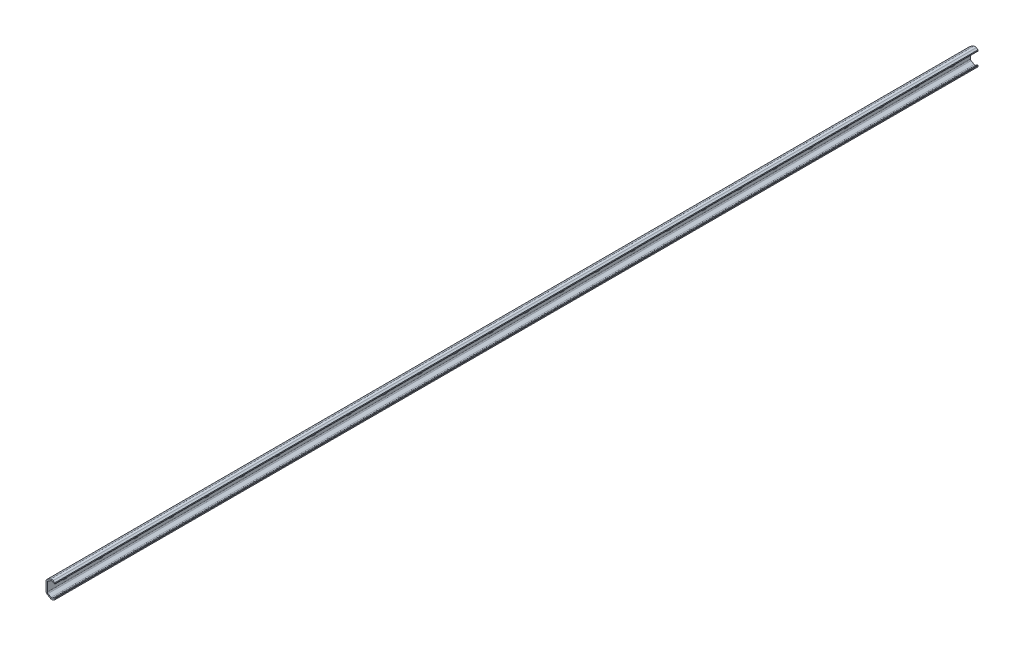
ISO-10303-21;
HEADER;
FILE_DESCRIPTION(('STEP AP214'),'2;1');
FILE_NAME('part.step','',(''),(''),'','','');
FILE_SCHEMA(('AUTOMOTIVE_DESIGN { 1 0 10303 214 1 1 1 1 }'));
ENDSEC;
DATA;
#1=APPLICATION_CONTEXT('core data for automotive mechanical design processes');
#2=APPLICATION_PROTOCOL_DEFINITION('international standard','automotive_design',2000,#1);
#3=PRODUCT_CONTEXT('',#1,'mechanical');
#4=PRODUCT('Part','Part','',(#3));
#5=PRODUCT_RELATED_PRODUCT_CATEGORY('part','',(#4));
#6=PRODUCT_DEFINITION_FORMATION('','',#4);
#7=PRODUCT_DEFINITION_CONTEXT('part definition',#1,'design');
#8=PRODUCT_DEFINITION('design','',#6,#7);
#9=PRODUCT_DEFINITION_SHAPE('','',#8);
#10=(LENGTH_UNIT() NAMED_UNIT(*) SI_UNIT(.MILLI.,.METRE.));
#11=(NAMED_UNIT(*) PLANE_ANGLE_UNIT() SI_UNIT($,.RADIAN.));
#12=(NAMED_UNIT(*) SI_UNIT($,.STERADIAN.) SOLID_ANGLE_UNIT());
#13=UNCERTAINTY_MEASURE_WITH_UNIT(LENGTH_MEASURE(1.E-05),#10,'distance_accuracy_value','');
#14=(GEOMETRIC_REPRESENTATION_CONTEXT(3) GLOBAL_UNCERTAINTY_ASSIGNED_CONTEXT((#13)) GLOBAL_UNIT_ASSIGNED_CONTEXT((#10,
#11,#12)) REPRESENTATION_CONTEXT('',''));
#15=CARTESIAN_POINT('',(0.,0.,0.));
#16=DIRECTION('',(0.,0.,1.));
#17=DIRECTION('',(1.,0.,0.));
#18=AXIS2_PLACEMENT_3D('',#15,#16,#17);
#19=CARTESIAN_POINT('',(0.,4.5,-2042.));
#20=DIRECTION('',(0.,1.,0.));
#21=DIRECTION('',(-1.,0.,0.));
#22=AXIS2_PLACEMENT_3D('',#19,#20,#21);
#23=PLANE('',#22);
#24=DIRECTION('',(0.,0.,1.));
#25=VECTOR('',#24,1.);
#26=CARTESIAN_POINT('',(2.9999817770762,4.5,-2042.));
#27=LINE('',#26,#25);
#28=CARTESIAN_POINT('',(2.9999817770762,4.5,-2042.));
#29=VERTEX_POINT('',#28);
#30=CARTESIAN_POINT('',(2.9999817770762,4.5,-2038.));
#31=VERTEX_POINT('',#30);
#32=EDGE_CURVE('E2175',#29,#31,#27,.T.);
#33=ORIENTED_EDGE('',*,*,#32,.T.);
#34=DIRECTION('',(1.,0.,0.));
#35=VECTOR('',#34,1.);
#36=CARTESIAN_POINT('',(0.,4.5,-2038.));
#37=LINE('',#36,#35);
#38=CARTESIAN_POINT('',(0.,4.5,-2038.));
#39=VERTEX_POINT('',#38);
#40=EDGE_CURVE('E11',#39,#31,#37,.T.);
#41=ORIENTED_EDGE('',*,*,#40,.F.);
#42=DIRECTION('',(0.,0.,1.));
#43=VECTOR('',#42,1.);
#44=CARTESIAN_POINT('',(0.,4.5,-2042.));
#45=LINE('',#44,#43);
#46=CARTESIAN_POINT('',(0.,4.5,-2042.));
#47=VERTEX_POINT('',#46);
#48=EDGE_CURVE('E2181',#47,#39,#45,.T.);
#49=ORIENTED_EDGE('',*,*,#48,.F.);
#50=DIRECTION('',(1.,0.,0.));
#51=VECTOR('',#50,1.);
#52=CARTESIAN_POINT('',(0.,4.5,-2042.));
#53=LINE('',#52,#51);
#54=EDGE_CURVE('E2189',#47,#29,#53,.T.);
#55=ORIENTED_EDGE('',*,*,#54,.T.);
#56=EDGE_LOOP('',(#33,#41,#49,#55));
#57=FACE_BOUND('',#56,.T.);
#58=ADVANCED_FACE('F39',(#57),#23,.F.);
#59=CARTESIAN_POINT('',(0.,0.,-2038.));
#60=DIRECTION('',(1.,0.,0.));
#61=DIRECTION('',(0.,1.,0.));
#62=AXIS2_PLACEMENT_3D('',#59,#60,#61);
#63=CYLINDRICAL_SURFACE('',#62,4.5);
#64=CARTESIAN_POINT('',(2.9999817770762,0.,-2038.));
#65=DIRECTION('',(1.,0.,0.));
#66=DIRECTION('',(0.,1.,0.));
#67=AXIS2_PLACEMENT_3D('',#64,#65,#66);
#68=CIRCLE('',#67,4.5);
#69=CARTESIAN_POINT('',(2.9999817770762,-4.5,-2038.));
#70=VERTEX_POINT('',#69);
#71=EDGE_CURVE('E2171',#31,#70,#68,.T.);
#72=ORIENTED_EDGE('',*,*,#71,.T.);
#73=DIRECTION('',(1.,0.,0.));
#74=VECTOR('',#73,1.);
#75=CARTESIAN_POINT('',(0.,-4.5,-2038.));
#76=LINE('',#75,#74);
#77=CARTESIAN_POINT('',(0.,-4.5,-2038.));
#78=VERTEX_POINT('',#77);
#79=EDGE_CURVE('E47',#78,#70,#76,.T.);
#80=ORIENTED_EDGE('',*,*,#79,.F.);
#81=CARTESIAN_POINT('',(0.,0.,-2038.));
#82=DIRECTION('',(1.,0.,0.));
#83=DIRECTION('',(0.,1.,0.));
#84=AXIS2_PLACEMENT_3D('',#81,#82,#83);
#85=CIRCLE('',#84,4.5);
#86=EDGE_CURVE('E61',#39,#78,#85,.T.);
#87=ORIENTED_EDGE('',*,*,#86,.F.);
#88=ORIENTED_EDGE('',*,*,#40,.T.);
#89=EDGE_LOOP('',(#72,#80,#87,#88));
#90=FACE_BOUND('',#89,.T.);
#91=ADVANCED_FACE('F2202',(#90),#63,.F.);
#92=CARTESIAN_POINT('',(0.,-4.5,-2042.));
#93=DIRECTION('',(0.,-1.,0.));
#94=DIRECTION('',(1.,0.,0.));
#95=AXIS2_PLACEMENT_3D('',#92,#93,#94);
#96=PLANE('',#95);
#97=DIRECTION('',(0.,0.,-1.));
#98=VECTOR('',#97,1.);
#99=CARTESIAN_POINT('',(2.9999817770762,-4.5,-2042.));
#100=LINE('',#99,#98);
#101=CARTESIAN_POINT('',(2.9999817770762,-4.5,-2042.));
#102=VERTEX_POINT('',#101);
#103=EDGE_CURVE('E2167',#70,#102,#100,.T.);
#104=ORIENTED_EDGE('',*,*,#103,.T.);
#105=DIRECTION('',(1.,0.,0.));
#106=VECTOR('',#105,1.);
#107=CARTESIAN_POINT('',(0.,-4.5,-2042.));
#108=LINE('',#107,#106);
#109=CARTESIAN_POINT('',(0.,-4.5,-2042.));
#110=VERTEX_POINT('',#109);
#111=EDGE_CURVE('E2193',#110,#102,#108,.T.);
#112=ORIENTED_EDGE('',*,*,#111,.F.);
#113=DIRECTION('',(0.,0.,-1.));
#114=VECTOR('',#113,1.);
#115=CARTESIAN_POINT('',(0.,-4.5,-2042.));
#116=LINE('',#115,#114);
#117=EDGE_CURVE('E2186',#78,#110,#116,.T.);
#118=ORIENTED_EDGE('',*,*,#117,.F.);
#119=ORIENTED_EDGE('',*,*,#79,.T.);
#120=EDGE_LOOP('',(#104,#112,#118,#119));
#121=FACE_BOUND('',#120,.T.);
#122=ADVANCED_FACE('F2199',(#121),#96,.F.);
#123=CARTESIAN_POINT('',(0.,0.,-2042.));
#124=DIRECTION('',(1.,0.,0.));
#125=DIRECTION('',(0.,1.,0.));
#126=AXIS2_PLACEMENT_3D('',#123,#124,#125);
#127=CYLINDRICAL_SURFACE('',#126,4.5);
#128=CARTESIAN_POINT('',(2.9999817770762,0.,-2042.));
#129=DIRECTION('',(1.,0.,0.));
#130=DIRECTION('',(0.,1.,0.));
#131=AXIS2_PLACEMENT_3D('',#128,#129,#130);
#132=CIRCLE('',#131,4.5);
#133=EDGE_CURVE('E2164',#102,#29,#132,.T.);
#134=ORIENTED_EDGE('',*,*,#133,.T.);
#135=ORIENTED_EDGE('',*,*,#54,.F.);
#136=CARTESIAN_POINT('',(0.,0.,-2042.));
#137=DIRECTION('',(1.,0.,0.));
#138=DIRECTION('',(0.,1.,0.));
#139=AXIS2_PLACEMENT_3D('',#136,#137,#138);
#140=CIRCLE('',#139,4.5);
#141=EDGE_CURVE('E54',#110,#47,#140,.T.);
#142=ORIENTED_EDGE('',*,*,#141,.F.);
#143=ORIENTED_EDGE('',*,*,#111,.T.);
#144=EDGE_LOOP('',(#134,#135,#142,#143));
#145=FACE_BOUND('',#144,.T.);
#146=ADVANCED_FACE('F2208',(#145),#127,.F.);
#147=CARTESIAN_POINT('',(0.,4.5,-1962.));
#148=DIRECTION('',(0.,1.,0.));
#149=DIRECTION('',(-1.,0.,0.));
#150=AXIS2_PLACEMENT_3D('',#147,#148,#149);
#151=PLANE('',#150);
#152=DIRECTION('',(0.,0.,1.));
#153=VECTOR('',#152,1.);
#154=CARTESIAN_POINT('',(2.9999817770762,4.5,-1962.));
#155=LINE('',#154,#153);
#156=CARTESIAN_POINT('',(2.9999817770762,4.5,-1962.));
#157=VERTEX_POINT('',#156);
#158=CARTESIAN_POINT('',(2.9999817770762,4.5,-1958.));
#159=VERTEX_POINT('',#158);
#160=EDGE_CURVE('E2131',#157,#159,#155,.T.);
#161=ORIENTED_EDGE('',*,*,#160,.T.);
#162=DIRECTION('',(1.,0.,0.));
#163=VECTOR('',#162,1.);
#164=CARTESIAN_POINT('',(0.,4.5,-1958.));
#165=LINE('',#164,#163);
#166=CARTESIAN_POINT('',(0.,4.5,-1958.));
#167=VERTEX_POINT('',#166);
#168=EDGE_CURVE('E2160',#167,#159,#165,.T.);
#169=ORIENTED_EDGE('',*,*,#168,.F.);
#170=DIRECTION('',(0.,0.,1.));
#171=VECTOR('',#170,1.);
#172=CARTESIAN_POINT('',(0.,4.5,-1962.));
#173=LINE('',#172,#171);
#174=CARTESIAN_POINT('',(0.,4.5,-1962.));
#175=VERTEX_POINT('',#174);
#176=EDGE_CURVE('E2138',#175,#167,#173,.T.);
#177=ORIENTED_EDGE('',*,*,#176,.F.);
#178=DIRECTION('',(1.,0.,0.));
#179=VECTOR('',#178,1.);
#180=CARTESIAN_POINT('',(0.,4.5,-1962.));
#181=LINE('',#180,#179);
#182=EDGE_CURVE('E2148',#175,#157,#181,.T.);
#183=ORIENTED_EDGE('',*,*,#182,.T.);
#184=EDGE_LOOP('',(#161,#169,#177,#183));
#185=FACE_BOUND('',#184,.T.);
#186=ADVANCED_FACE('F2210',(#185),#151,.F.);
#187=CARTESIAN_POINT('',(0.,0.,-1958.));
#188=DIRECTION('',(1.,0.,0.));
#189=DIRECTION('',(0.,1.,0.));
#190=AXIS2_PLACEMENT_3D('',#187,#188,#189);
#191=CYLINDRICAL_SURFACE('',#190,4.5);
#192=CARTESIAN_POINT('',(2.9999817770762,0.,-1958.));
#193=DIRECTION('',(1.,0.,0.));
#194=DIRECTION('',(0.,1.,0.));
#195=AXIS2_PLACEMENT_3D('',#192,#193,#194);
#196=CIRCLE('',#195,4.5);
#197=CARTESIAN_POINT('',(2.9999817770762,-4.5,-1958.));
#198=VERTEX_POINT('',#197);
#199=EDGE_CURVE('E2127',#159,#198,#196,.T.);
#200=ORIENTED_EDGE('',*,*,#199,.T.);
#201=DIRECTION('',(1.,0.,0.));
#202=VECTOR('',#201,1.);
#203=CARTESIAN_POINT('',(0.,-4.5,-1958.));
#204=LINE('',#203,#202);
#205=CARTESIAN_POINT('',(0.,-4.5,-1958.));
#206=VERTEX_POINT('',#205);
#207=EDGE_CURVE('E2156',#206,#198,#204,.T.);
#208=ORIENTED_EDGE('',*,*,#207,.F.);
#209=CARTESIAN_POINT('',(0.,0.,-1958.));
#210=DIRECTION('',(1.,0.,0.));
#211=DIRECTION('',(0.,1.,0.));
#212=AXIS2_PLACEMENT_3D('',#209,#210,#211);
#213=CIRCLE('',#212,4.5);
#214=EDGE_CURVE('E2141',#167,#206,#213,.T.);
#215=ORIENTED_EDGE('',*,*,#214,.F.);
#216=ORIENTED_EDGE('',*,*,#168,.T.);
#217=EDGE_LOOP('',(#200,#208,#215,#216));
#218=FACE_BOUND('',#217,.T.);
#219=ADVANCED_FACE('F2216',(#218),#191,.F.);
#220=CARTESIAN_POINT('',(0.,-4.5,-1962.));
#221=DIRECTION('',(0.,-1.,0.));
#222=DIRECTION('',(1.,0.,0.));
#223=AXIS2_PLACEMENT_3D('',#220,#221,#222);
#224=PLANE('',#223);
#225=DIRECTION('',(0.,0.,-1.));
#226=VECTOR('',#225,1.);
#227=CARTESIAN_POINT('',(2.9999817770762,-4.5,-1962.));
#228=LINE('',#227,#226);
#229=CARTESIAN_POINT('',(2.9999817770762,-4.5,-1962.));
#230=VERTEX_POINT('',#229);
#231=EDGE_CURVE('E2123',#198,#230,#228,.T.);
#232=ORIENTED_EDGE('',*,*,#231,.T.);
#233=DIRECTION('',(1.,0.,0.));
#234=VECTOR('',#233,1.);
#235=CARTESIAN_POINT('',(0.,-4.5,-1962.));
#236=LINE('',#235,#234);
#237=CARTESIAN_POINT('',(0.,-4.5,-1962.));
#238=VERTEX_POINT('',#237);
#239=EDGE_CURVE('E2152',#238,#230,#236,.T.);
#240=ORIENTED_EDGE('',*,*,#239,.F.);
#241=DIRECTION('',(0.,0.,-1.));
#242=VECTOR('',#241,1.);
#243=CARTESIAN_POINT('',(0.,-4.5,-1962.));
#244=LINE('',#243,#242);
#245=EDGE_CURVE('E2144',#206,#238,#244,.T.);
#246=ORIENTED_EDGE('',*,*,#245,.F.);
#247=ORIENTED_EDGE('',*,*,#207,.T.);
#248=EDGE_LOOP('',(#232,#240,#246,#247));
#249=FACE_BOUND('',#248,.T.);
#250=ADVANCED_FACE('F2244',(#249),#224,.F.);
#251=CARTESIAN_POINT('',(0.,0.,-1962.));
#252=DIRECTION('',(1.,0.,0.));
#253=DIRECTION('',(0.,1.,0.));
#254=AXIS2_PLACEMENT_3D('',#251,#252,#253);
#255=CYLINDRICAL_SURFACE('',#254,4.5);
#256=CARTESIAN_POINT('',(2.9999817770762,0.,-1962.));
#257=DIRECTION('',(1.,0.,0.));
#258=DIRECTION('',(0.,1.,0.));
#259=AXIS2_PLACEMENT_3D('',#256,#257,#258);
#260=CIRCLE('',#259,4.5);
#261=EDGE_CURVE('E2120',#230,#157,#260,.T.);
#262=ORIENTED_EDGE('',*,*,#261,.T.);
#263=ORIENTED_EDGE('',*,*,#182,.F.);
#264=CARTESIAN_POINT('',(0.,0.,-1962.));
#265=DIRECTION('',(1.,0.,0.));
#266=DIRECTION('',(0.,1.,0.));
#267=AXIS2_PLACEMENT_3D('',#264,#265,#266);
#268=CIRCLE('',#267,4.5);
#269=EDGE_CURVE('E2135',#238,#175,#268,.T.);
#270=ORIENTED_EDGE('',*,*,#269,.F.);
#271=ORIENTED_EDGE('',*,*,#239,.T.);
#272=EDGE_LOOP('',(#262,#263,#270,#271));
#273=FACE_BOUND('',#272,.T.);
#274=ADVANCED_FACE('F2253',(#273),#255,.F.);
#275=CARTESIAN_POINT('',(0.,4.5,-1882.));
#276=DIRECTION('',(0.,1.,0.));
#277=DIRECTION('',(-1.,0.,0.));
#278=AXIS2_PLACEMENT_3D('',#275,#276,#277);
#279=PLANE('',#278);
#280=DIRECTION('',(0.,0.,1.));
#281=VECTOR('',#280,1.);
#282=CARTESIAN_POINT('',(2.9999817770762,4.5,-1882.));
#283=LINE('',#282,#281);
#284=CARTESIAN_POINT('',(2.9999817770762,4.5,-1882.));
#285=VERTEX_POINT('',#284);
#286=CARTESIAN_POINT('',(2.9999817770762,4.5,-1878.));
#287=VERTEX_POINT('',#286);
#288=EDGE_CURVE('E2087',#285,#287,#283,.T.);
#289=ORIENTED_EDGE('',*,*,#288,.T.);
#290=DIRECTION('',(1.,0.,0.));
#291=VECTOR('',#290,1.);
#292=CARTESIAN_POINT('',(0.,4.5,-1878.));
#293=LINE('',#292,#291);
#294=CARTESIAN_POINT('',(0.,4.5,-1878.));
#295=VERTEX_POINT('',#294);
#296=EDGE_CURVE('E2116',#295,#287,#293,.T.);
#297=ORIENTED_EDGE('',*,*,#296,.F.);
#298=DIRECTION('',(0.,0.,1.));
#299=VECTOR('',#298,1.);
#300=CARTESIAN_POINT('',(0.,4.5,-1882.));
#301=LINE('',#300,#299);
#302=CARTESIAN_POINT('',(0.,4.5,-1882.));
#303=VERTEX_POINT('',#302);
#304=EDGE_CURVE('E2094',#303,#295,#301,.T.);
#305=ORIENTED_EDGE('',*,*,#304,.F.);
#306=DIRECTION('',(1.,0.,0.));
#307=VECTOR('',#306,1.);
#308=CARTESIAN_POINT('',(0.,4.5,-1882.));
#309=LINE('',#308,#307);
#310=EDGE_CURVE('E2104',#303,#285,#309,.T.);
#311=ORIENTED_EDGE('',*,*,#310,.T.);
#312=EDGE_LOOP('',(#289,#297,#305,#311));
#313=FACE_BOUND('',#312,.T.);
#314=ADVANCED_FACE('F2262',(#313),#279,.F.);
#315=CARTESIAN_POINT('',(0.,0.,-1878.));
#316=DIRECTION('',(1.,0.,0.));
#317=DIRECTION('',(0.,1.,0.));
#318=AXIS2_PLACEMENT_3D('',#315,#316,#317);
#319=CYLINDRICAL_SURFACE('',#318,4.5);
#320=CARTESIAN_POINT('',(2.9999817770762,0.,-1878.));
#321=DIRECTION('',(1.,0.,0.));
#322=DIRECTION('',(0.,1.,0.));
#323=AXIS2_PLACEMENT_3D('',#320,#321,#322);
#324=CIRCLE('',#323,4.5);
#325=CARTESIAN_POINT('',(2.9999817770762,-4.5,-1878.));
#326=VERTEX_POINT('',#325);
#327=EDGE_CURVE('E2083',#287,#326,#324,.T.);
#328=ORIENTED_EDGE('',*,*,#327,.T.);
#329=DIRECTION('',(1.,0.,0.));
#330=VECTOR('',#329,1.);
#331=CARTESIAN_POINT('',(0.,-4.5,-1878.));
#332=LINE('',#331,#330);
#333=CARTESIAN_POINT('',(0.,-4.5,-1878.));
#334=VERTEX_POINT('',#333);
#335=EDGE_CURVE('E2112',#334,#326,#332,.T.);
#336=ORIENTED_EDGE('',*,*,#335,.F.);
#337=CARTESIAN_POINT('',(0.,0.,-1878.));
#338=DIRECTION('',(1.,0.,0.));
#339=DIRECTION('',(0.,1.,0.));
#340=AXIS2_PLACEMENT_3D('',#337,#338,#339);
#341=CIRCLE('',#340,4.5);
#342=EDGE_CURVE('E2097',#295,#334,#341,.T.);
#343=ORIENTED_EDGE('',*,*,#342,.F.);
#344=ORIENTED_EDGE('',*,*,#296,.T.);
#345=EDGE_LOOP('',(#328,#336,#343,#344));
#346=FACE_BOUND('',#345,.T.);
#347=ADVANCED_FACE('F2271',(#346),#319,.F.);
#348=CARTESIAN_POINT('',(0.,-4.5,-1882.));
#349=DIRECTION('',(0.,-1.,0.));
#350=DIRECTION('',(1.,0.,0.));
#351=AXIS2_PLACEMENT_3D('',#348,#349,#350);
#352=PLANE('',#351);
#353=DIRECTION('',(0.,0.,-1.));
#354=VECTOR('',#353,1.);
#355=CARTESIAN_POINT('',(2.9999817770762,-4.5,-1882.));
#356=LINE('',#355,#354);
#357=CARTESIAN_POINT('',(2.9999817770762,-4.5,-1882.));
#358=VERTEX_POINT('',#357);
#359=EDGE_CURVE('E2079',#326,#358,#356,.T.);
#360=ORIENTED_EDGE('',*,*,#359,.T.);
#361=DIRECTION('',(1.,0.,0.));
#362=VECTOR('',#361,1.);
#363=CARTESIAN_POINT('',(0.,-4.5,-1882.));
#364=LINE('',#363,#362);
#365=CARTESIAN_POINT('',(0.,-4.5,-1882.));
#366=VERTEX_POINT('',#365);
#367=EDGE_CURVE('E2108',#366,#358,#364,.T.);
#368=ORIENTED_EDGE('',*,*,#367,.F.);
#369=DIRECTION('',(0.,0.,-1.));
#370=VECTOR('',#369,1.);
#371=CARTESIAN_POINT('',(0.,-4.5,-1882.));
#372=LINE('',#371,#370);
#373=EDGE_CURVE('E2100',#334,#366,#372,.T.);
#374=ORIENTED_EDGE('',*,*,#373,.F.);
#375=ORIENTED_EDGE('',*,*,#335,.T.);
#376=EDGE_LOOP('',(#360,#368,#374,#375));
#377=FACE_BOUND('',#376,.T.);
#378=ADVANCED_FACE('F2280',(#377),#352,.F.);
#379=CARTESIAN_POINT('',(0.,0.,-1882.));
#380=DIRECTION('',(1.,0.,0.));
#381=DIRECTION('',(0.,1.,0.));
#382=AXIS2_PLACEMENT_3D('',#379,#380,#381);
#383=CYLINDRICAL_SURFACE('',#382,4.5);
#384=CARTESIAN_POINT('',(2.9999817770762,0.,-1882.));
#385=DIRECTION('',(1.,0.,0.));
#386=DIRECTION('',(0.,1.,0.));
#387=AXIS2_PLACEMENT_3D('',#384,#385,#386);
#388=CIRCLE('',#387,4.5);
#389=EDGE_CURVE('E2076',#358,#285,#388,.T.);
#390=ORIENTED_EDGE('',*,*,#389,.T.);
#391=ORIENTED_EDGE('',*,*,#310,.F.);
#392=CARTESIAN_POINT('',(0.,0.,-1882.));
#393=DIRECTION('',(1.,0.,0.));
#394=DIRECTION('',(0.,1.,0.));
#395=AXIS2_PLACEMENT_3D('',#392,#393,#394);
#396=CIRCLE('',#395,4.5);
#397=EDGE_CURVE('E2091',#366,#303,#396,.T.);
#398=ORIENTED_EDGE('',*,*,#397,.F.);
#399=ORIENTED_EDGE('',*,*,#367,.T.);
#400=EDGE_LOOP('',(#390,#391,#398,#399));
#401=FACE_BOUND('',#400,.T.);
#402=ADVANCED_FACE('F2289',(#401),#383,.F.);
#403=CARTESIAN_POINT('',(0.,4.5,-1802.));
#404=DIRECTION('',(0.,1.,0.));
#405=DIRECTION('',(-1.,0.,0.));
#406=AXIS2_PLACEMENT_3D('',#403,#404,#405);
#407=PLANE('',#406);
#408=DIRECTION('',(0.,0.,1.));
#409=VECTOR('',#408,1.);
#410=CARTESIAN_POINT('',(2.9999817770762,4.5,-1802.));
#411=LINE('',#410,#409);
#412=CARTESIAN_POINT('',(2.9999817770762,4.5,-1802.));
#413=VERTEX_POINT('',#412);
#414=CARTESIAN_POINT('',(2.9999817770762,4.5,-1798.));
#415=VERTEX_POINT('',#414);
#416=EDGE_CURVE('E2043',#413,#415,#411,.T.);
#417=ORIENTED_EDGE('',*,*,#416,.T.);
#418=DIRECTION('',(1.,0.,0.));
#419=VECTOR('',#418,1.);
#420=CARTESIAN_POINT('',(0.,4.5,-1798.));
#421=LINE('',#420,#419);
#422=CARTESIAN_POINT('',(0.,4.5,-1798.));
#423=VERTEX_POINT('',#422);
#424=EDGE_CURVE('E2072',#423,#415,#421,.T.);
#425=ORIENTED_EDGE('',*,*,#424,.F.);
#426=DIRECTION('',(0.,0.,1.));
#427=VECTOR('',#426,1.);
#428=CARTESIAN_POINT('',(0.,4.5,-1802.));
#429=LINE('',#428,#427);
#430=CARTESIAN_POINT('',(0.,4.5,-1802.));
#431=VERTEX_POINT('',#430);
#432=EDGE_CURVE('E2050',#431,#423,#429,.T.);
#433=ORIENTED_EDGE('',*,*,#432,.F.);
#434=DIRECTION('',(1.,0.,0.));
#435=VECTOR('',#434,1.);
#436=CARTESIAN_POINT('',(0.,4.5,-1802.));
#437=LINE('',#436,#435);
#438=EDGE_CURVE('E2060',#431,#413,#437,.T.);
#439=ORIENTED_EDGE('',*,*,#438,.T.);
#440=EDGE_LOOP('',(#417,#425,#433,#439));
#441=FACE_BOUND('',#440,.T.);
#442=ADVANCED_FACE('F2298',(#441),#407,.F.);
#443=CARTESIAN_POINT('',(0.,0.,-1798.));
#444=DIRECTION('',(1.,0.,0.));
#445=DIRECTION('',(0.,1.,0.));
#446=AXIS2_PLACEMENT_3D('',#443,#444,#445);
#447=CYLINDRICAL_SURFACE('',#446,4.5);
#448=CARTESIAN_POINT('',(2.9999817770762,0.,-1798.));
#449=DIRECTION('',(1.,0.,0.));
#450=DIRECTION('',(0.,1.,0.));
#451=AXIS2_PLACEMENT_3D('',#448,#449,#450);
#452=CIRCLE('',#451,4.5);
#453=CARTESIAN_POINT('',(2.9999817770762,-4.5,-1798.));
#454=VERTEX_POINT('',#453);
#455=EDGE_CURVE('E2039',#415,#454,#452,.T.);
#456=ORIENTED_EDGE('',*,*,#455,.T.);
#457=DIRECTION('',(1.,0.,0.));
#458=VECTOR('',#457,1.);
#459=CARTESIAN_POINT('',(0.,-4.5,-1798.));
#460=LINE('',#459,#458);
#461=CARTESIAN_POINT('',(0.,-4.5,-1798.));
#462=VERTEX_POINT('',#461);
#463=EDGE_CURVE('E2068',#462,#454,#460,.T.);
#464=ORIENTED_EDGE('',*,*,#463,.F.);
#465=CARTESIAN_POINT('',(0.,0.,-1798.));
#466=DIRECTION('',(1.,0.,0.));
#467=DIRECTION('',(0.,1.,0.));
#468=AXIS2_PLACEMENT_3D('',#465,#466,#467);
#469=CIRCLE('',#468,4.5);
#470=EDGE_CURVE('E2053',#423,#462,#469,.T.);
#471=ORIENTED_EDGE('',*,*,#470,.F.);
#472=ORIENTED_EDGE('',*,*,#424,.T.);
#473=EDGE_LOOP('',(#456,#464,#471,#472));
#474=FACE_BOUND('',#473,.T.);
#475=ADVANCED_FACE('F2307',(#474),#447,.F.);
#476=CARTESIAN_POINT('',(0.,-4.5,-1802.));
#477=DIRECTION('',(0.,-1.,0.));
#478=DIRECTION('',(1.,0.,0.));
#479=AXIS2_PLACEMENT_3D('',#476,#477,#478);
#480=PLANE('',#479);
#481=DIRECTION('',(0.,0.,-1.));
#482=VECTOR('',#481,1.);
#483=CARTESIAN_POINT('',(2.9999817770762,-4.5,-1802.));
#484=LINE('',#483,#482);
#485=CARTESIAN_POINT('',(2.9999817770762,-4.5,-1802.));
#486=VERTEX_POINT('',#485);
#487=EDGE_CURVE('E2035',#454,#486,#484,.T.);
#488=ORIENTED_EDGE('',*,*,#487,.T.);
#489=DIRECTION('',(1.,0.,0.));
#490=VECTOR('',#489,1.);
#491=CARTESIAN_POINT('',(0.,-4.5,-1802.));
#492=LINE('',#491,#490);
#493=CARTESIAN_POINT('',(0.,-4.5,-1802.));
#494=VERTEX_POINT('',#493);
#495=EDGE_CURVE('E2064',#494,#486,#492,.T.);
#496=ORIENTED_EDGE('',*,*,#495,.F.);
#497=DIRECTION('',(0.,0.,-1.));
#498=VECTOR('',#497,1.);
#499=CARTESIAN_POINT('',(0.,-4.5,-1802.));
#500=LINE('',#499,#498);
#501=EDGE_CURVE('E2056',#462,#494,#500,.T.);
#502=ORIENTED_EDGE('',*,*,#501,.F.);
#503=ORIENTED_EDGE('',*,*,#463,.T.);
#504=EDGE_LOOP('',(#488,#496,#502,#503));
#505=FACE_BOUND('',#504,.T.);
#506=ADVANCED_FACE('F2316',(#505),#480,.F.);
#507=CARTESIAN_POINT('',(0.,0.,-1802.));
#508=DIRECTION('',(1.,0.,0.));
#509=DIRECTION('',(0.,1.,0.));
#510=AXIS2_PLACEMENT_3D('',#507,#508,#509);
#511=CYLINDRICAL_SURFACE('',#510,4.5);
#512=CARTESIAN_POINT('',(2.9999817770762,0.,-1802.));
#513=DIRECTION('',(1.,0.,0.));
#514=DIRECTION('',(0.,1.,0.));
#515=AXIS2_PLACEMENT_3D('',#512,#513,#514);
#516=CIRCLE('',#515,4.5);
#517=EDGE_CURVE('E2032',#486,#413,#516,.T.);
#518=ORIENTED_EDGE('',*,*,#517,.T.);
#519=ORIENTED_EDGE('',*,*,#438,.F.);
#520=CARTESIAN_POINT('',(0.,0.,-1802.));
#521=DIRECTION('',(1.,0.,0.));
#522=DIRECTION('',(0.,1.,0.));
#523=AXIS2_PLACEMENT_3D('',#520,#521,#522);
#524=CIRCLE('',#523,4.5);
#525=EDGE_CURVE('E2047',#494,#431,#524,.T.);
#526=ORIENTED_EDGE('',*,*,#525,.F.);
#527=ORIENTED_EDGE('',*,*,#495,.T.);
#528=EDGE_LOOP('',(#518,#519,#526,#527));
#529=FACE_BOUND('',#528,.T.);
#530=ADVANCED_FACE('F2325',(#529),#511,.F.);
#531=CARTESIAN_POINT('',(0.,4.5,-1722.));
#532=DIRECTION('',(0.,1.,0.));
#533=DIRECTION('',(-1.,0.,0.));
#534=AXIS2_PLACEMENT_3D('',#531,#532,#533);
#535=PLANE('',#534);
#536=DIRECTION('',(0.,0.,1.));
#537=VECTOR('',#536,1.);
#538=CARTESIAN_POINT('',(2.9999817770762,4.5,-1722.));
#539=LINE('',#538,#537);
#540=CARTESIAN_POINT('',(2.9999817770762,4.5,-1722.));
#541=VERTEX_POINT('',#540);
#542=CARTESIAN_POINT('',(2.9999817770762,4.5,-1718.));
#543=VERTEX_POINT('',#542);
#544=EDGE_CURVE('E1999',#541,#543,#539,.T.);
#545=ORIENTED_EDGE('',*,*,#544,.T.);
#546=DIRECTION('',(1.,0.,0.));
#547=VECTOR('',#546,1.);
#548=CARTESIAN_POINT('',(0.,4.5,-1718.));
#549=LINE('',#548,#547);
#550=CARTESIAN_POINT('',(0.,4.5,-1718.));
#551=VERTEX_POINT('',#550);
#552=EDGE_CURVE('E2028',#551,#543,#549,.T.);
#553=ORIENTED_EDGE('',*,*,#552,.F.);
#554=DIRECTION('',(0.,0.,1.));
#555=VECTOR('',#554,1.);
#556=CARTESIAN_POINT('',(0.,4.5,-1722.));
#557=LINE('',#556,#555);
#558=CARTESIAN_POINT('',(0.,4.5,-1722.));
#559=VERTEX_POINT('',#558);
#560=EDGE_CURVE('E2006',#559,#551,#557,.T.);
#561=ORIENTED_EDGE('',*,*,#560,.F.);
#562=DIRECTION('',(1.,0.,0.));
#563=VECTOR('',#562,1.);
#564=CARTESIAN_POINT('',(0.,4.5,-1722.));
#565=LINE('',#564,#563);
#566=EDGE_CURVE('E2016',#559,#541,#565,.T.);
#567=ORIENTED_EDGE('',*,*,#566,.T.);
#568=EDGE_LOOP('',(#545,#553,#561,#567));
#569=FACE_BOUND('',#568,.T.);
#570=ADVANCED_FACE('F2334',(#569),#535,.F.);
#571=CARTESIAN_POINT('',(0.,0.,-1718.));
#572=DIRECTION('',(1.,0.,0.));
#573=DIRECTION('',(0.,1.,0.));
#574=AXIS2_PLACEMENT_3D('',#571,#572,#573);
#575=CYLINDRICAL_SURFACE('',#574,4.5);
#576=CARTESIAN_POINT('',(2.9999817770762,0.,-1718.));
#577=DIRECTION('',(1.,0.,0.));
#578=DIRECTION('',(0.,1.,0.));
#579=AXIS2_PLACEMENT_3D('',#576,#577,#578);
#580=CIRCLE('',#579,4.5);
#581=CARTESIAN_POINT('',(2.9999817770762,-4.5,-1718.));
#582=VERTEX_POINT('',#581);
#583=EDGE_CURVE('E1995',#543,#582,#580,.T.);
#584=ORIENTED_EDGE('',*,*,#583,.T.);
#585=DIRECTION('',(1.,0.,0.));
#586=VECTOR('',#585,1.);
#587=CARTESIAN_POINT('',(0.,-4.5,-1718.));
#588=LINE('',#587,#586);
#589=CARTESIAN_POINT('',(0.,-4.5,-1718.));
#590=VERTEX_POINT('',#589);
#591=EDGE_CURVE('E2024',#590,#582,#588,.T.);
#592=ORIENTED_EDGE('',*,*,#591,.F.);
#593=CARTESIAN_POINT('',(0.,0.,-1718.));
#594=DIRECTION('',(1.,0.,0.));
#595=DIRECTION('',(0.,1.,0.));
#596=AXIS2_PLACEMENT_3D('',#593,#594,#595);
#597=CIRCLE('',#596,4.5);
#598=EDGE_CURVE('E2009',#551,#590,#597,.T.);
#599=ORIENTED_EDGE('',*,*,#598,.F.);
#600=ORIENTED_EDGE('',*,*,#552,.T.);
#601=EDGE_LOOP('',(#584,#592,#599,#600));
#602=FACE_BOUND('',#601,.T.);
#603=ADVANCED_FACE('F2343',(#602),#575,.F.);
#604=CARTESIAN_POINT('',(0.,-4.5,-1722.));
#605=DIRECTION('',(0.,-1.,0.));
#606=DIRECTION('',(1.,0.,0.));
#607=AXIS2_PLACEMENT_3D('',#604,#605,#606);
#608=PLANE('',#607);
#609=DIRECTION('',(0.,0.,-1.));
#610=VECTOR('',#609,1.);
#611=CARTESIAN_POINT('',(2.9999817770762,-4.5,-1722.));
#612=LINE('',#611,#610);
#613=CARTESIAN_POINT('',(2.9999817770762,-4.5,-1722.));
#614=VERTEX_POINT('',#613);
#615=EDGE_CURVE('E1991',#582,#614,#612,.T.);
#616=ORIENTED_EDGE('',*,*,#615,.T.);
#617=DIRECTION('',(1.,0.,0.));
#618=VECTOR('',#617,1.);
#619=CARTESIAN_POINT('',(0.,-4.5,-1722.));
#620=LINE('',#619,#618);
#621=CARTESIAN_POINT('',(0.,-4.5,-1722.));
#622=VERTEX_POINT('',#621);
#623=EDGE_CURVE('E2020',#622,#614,#620,.T.);
#624=ORIENTED_EDGE('',*,*,#623,.F.);
#625=DIRECTION('',(0.,0.,-1.));
#626=VECTOR('',#625,1.);
#627=CARTESIAN_POINT('',(0.,-4.5,-1722.));
#628=LINE('',#627,#626);
#629=EDGE_CURVE('E2012',#590,#622,#628,.T.);
#630=ORIENTED_EDGE('',*,*,#629,.F.);
#631=ORIENTED_EDGE('',*,*,#591,.T.);
#632=EDGE_LOOP('',(#616,#624,#630,#631));
#633=FACE_BOUND('',#632,.T.);
#634=ADVANCED_FACE('F2352',(#633),#608,.F.);
#635=CARTESIAN_POINT('',(0.,0.,-1722.));
#636=DIRECTION('',(1.,0.,0.));
#637=DIRECTION('',(0.,1.,0.));
#638=AXIS2_PLACEMENT_3D('',#635,#636,#637);
#639=CYLINDRICAL_SURFACE('',#638,4.5);
#640=CARTESIAN_POINT('',(2.9999817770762,0.,-1722.));
#641=DIRECTION('',(1.,0.,0.));
#642=DIRECTION('',(0.,1.,0.));
#643=AXIS2_PLACEMENT_3D('',#640,#641,#642);
#644=CIRCLE('',#643,4.5);
#645=EDGE_CURVE('E1988',#614,#541,#644,.T.);
#646=ORIENTED_EDGE('',*,*,#645,.T.);
#647=ORIENTED_EDGE('',*,*,#566,.F.);
#648=CARTESIAN_POINT('',(0.,0.,-1722.));
#649=DIRECTION('',(1.,0.,0.));
#650=DIRECTION('',(0.,1.,0.));
#651=AXIS2_PLACEMENT_3D('',#648,#649,#650);
#652=CIRCLE('',#651,4.5);
#653=EDGE_CURVE('E2003',#622,#559,#652,.T.);
#654=ORIENTED_EDGE('',*,*,#653,.F.);
#655=ORIENTED_EDGE('',*,*,#623,.T.);
#656=EDGE_LOOP('',(#646,#647,#654,#655));
#657=FACE_BOUND('',#656,.T.);
#658=ADVANCED_FACE('F2361',(#657),#639,.F.);
#659=CARTESIAN_POINT('',(0.,4.5,-1642.));
#660=DIRECTION('',(0.,1.,0.));
#661=DIRECTION('',(-1.,0.,0.));
#662=AXIS2_PLACEMENT_3D('',#659,#660,#661);
#663=PLANE('',#662);
#664=DIRECTION('',(0.,0.,1.));
#665=VECTOR('',#664,1.);
#666=CARTESIAN_POINT('',(2.9999817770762,4.5,-1642.));
#667=LINE('',#666,#665);
#668=CARTESIAN_POINT('',(2.9999817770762,4.5,-1642.));
#669=VERTEX_POINT('',#668);
#670=CARTESIAN_POINT('',(2.9999817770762,4.5,-1638.));
#671=VERTEX_POINT('',#670);
#672=EDGE_CURVE('E1955',#669,#671,#667,.T.);
#673=ORIENTED_EDGE('',*,*,#672,.T.);
#674=DIRECTION('',(1.,0.,0.));
#675=VECTOR('',#674,1.);
#676=CARTESIAN_POINT('',(0.,4.5,-1638.));
#677=LINE('',#676,#675);
#678=CARTESIAN_POINT('',(0.,4.5,-1638.));
#679=VERTEX_POINT('',#678);
#680=EDGE_CURVE('E1984',#679,#671,#677,.T.);
#681=ORIENTED_EDGE('',*,*,#680,.F.);
#682=DIRECTION('',(0.,0.,1.));
#683=VECTOR('',#682,1.);
#684=CARTESIAN_POINT('',(0.,4.5,-1642.));
#685=LINE('',#684,#683);
#686=CARTESIAN_POINT('',(0.,4.5,-1642.));
#687=VERTEX_POINT('',#686);
#688=EDGE_CURVE('E1962',#687,#679,#685,.T.);
#689=ORIENTED_EDGE('',*,*,#688,.F.);
#690=DIRECTION('',(1.,0.,0.));
#691=VECTOR('',#690,1.);
#692=CARTESIAN_POINT('',(0.,4.5,-1642.));
#693=LINE('',#692,#691);
#694=EDGE_CURVE('E1972',#687,#669,#693,.T.);
#695=ORIENTED_EDGE('',*,*,#694,.T.);
#696=EDGE_LOOP('',(#673,#681,#689,#695));
#697=FACE_BOUND('',#696,.T.);
#698=ADVANCED_FACE('F2370',(#697),#663,.F.);
#699=CARTESIAN_POINT('',(0.,0.,-1638.));
#700=DIRECTION('',(1.,0.,0.));
#701=DIRECTION('',(0.,1.,0.));
#702=AXIS2_PLACEMENT_3D('',#699,#700,#701);
#703=CYLINDRICAL_SURFACE('',#702,4.5);
#704=CARTESIAN_POINT('',(2.9999817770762,0.,-1638.));
#705=DIRECTION('',(1.,0.,0.));
#706=DIRECTION('',(0.,1.,0.));
#707=AXIS2_PLACEMENT_3D('',#704,#705,#706);
#708=CIRCLE('',#707,4.5);
#709=CARTESIAN_POINT('',(2.9999817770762,-4.5,-1638.));
#710=VERTEX_POINT('',#709);
#711=EDGE_CURVE('E1951',#671,#710,#708,.T.);
#712=ORIENTED_EDGE('',*,*,#711,.T.);
#713=DIRECTION('',(1.,0.,0.));
#714=VECTOR('',#713,1.);
#715=CARTESIAN_POINT('',(0.,-4.5,-1638.));
#716=LINE('',#715,#714);
#717=CARTESIAN_POINT('',(0.,-4.5,-1638.));
#718=VERTEX_POINT('',#717);
#719=EDGE_CURVE('E1980',#718,#710,#716,.T.);
#720=ORIENTED_EDGE('',*,*,#719,.F.);
#721=CARTESIAN_POINT('',(0.,0.,-1638.));
#722=DIRECTION('',(1.,0.,0.));
#723=DIRECTION('',(0.,1.,0.));
#724=AXIS2_PLACEMENT_3D('',#721,#722,#723);
#725=CIRCLE('',#724,4.5);
#726=EDGE_CURVE('E1965',#679,#718,#725,.T.);
#727=ORIENTED_EDGE('',*,*,#726,.F.);
#728=ORIENTED_EDGE('',*,*,#680,.T.);
#729=EDGE_LOOP('',(#712,#720,#727,#728));
#730=FACE_BOUND('',#729,.T.);
#731=ADVANCED_FACE('F2379',(#730),#703,.F.);
#732=CARTESIAN_POINT('',(0.,-4.5,-1642.));
#733=DIRECTION('',(0.,-1.,0.));
#734=DIRECTION('',(1.,0.,0.));
#735=AXIS2_PLACEMENT_3D('',#732,#733,#734);
#736=PLANE('',#735);
#737=DIRECTION('',(0.,0.,-1.));
#738=VECTOR('',#737,1.);
#739=CARTESIAN_POINT('',(2.9999817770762,-4.5,-1642.));
#740=LINE('',#739,#738);
#741=CARTESIAN_POINT('',(2.9999817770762,-4.5,-1642.));
#742=VERTEX_POINT('',#741);
#743=EDGE_CURVE('E1947',#710,#742,#740,.T.);
#744=ORIENTED_EDGE('',*,*,#743,.T.);
#745=DIRECTION('',(1.,0.,0.));
#746=VECTOR('',#745,1.);
#747=CARTESIAN_POINT('',(0.,-4.5,-1642.));
#748=LINE('',#747,#746);
#749=CARTESIAN_POINT('',(0.,-4.5,-1642.));
#750=VERTEX_POINT('',#749);
#751=EDGE_CURVE('E1976',#750,#742,#748,.T.);
#752=ORIENTED_EDGE('',*,*,#751,.F.);
#753=DIRECTION('',(0.,0.,-1.));
#754=VECTOR('',#753,1.);
#755=CARTESIAN_POINT('',(0.,-4.5,-1642.));
#756=LINE('',#755,#754);
#757=EDGE_CURVE('E1968',#718,#750,#756,.T.);
#758=ORIENTED_EDGE('',*,*,#757,.F.);
#759=ORIENTED_EDGE('',*,*,#719,.T.);
#760=EDGE_LOOP('',(#744,#752,#758,#759));
#761=FACE_BOUND('',#760,.T.);
#762=ADVANCED_FACE('F2388',(#761),#736,.F.);
#763=CARTESIAN_POINT('',(0.,0.,-1642.));
#764=DIRECTION('',(1.,0.,0.));
#765=DIRECTION('',(0.,1.,0.));
#766=AXIS2_PLACEMENT_3D('',#763,#764,#765);
#767=CYLINDRICAL_SURFACE('',#766,4.5);
#768=CARTESIAN_POINT('',(2.9999817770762,0.,-1642.));
#769=DIRECTION('',(1.,0.,0.));
#770=DIRECTION('',(0.,1.,0.));
#771=AXIS2_PLACEMENT_3D('',#768,#769,#770);
#772=CIRCLE('',#771,4.5);
#773=EDGE_CURVE('E1944',#742,#669,#772,.T.);
#774=ORIENTED_EDGE('',*,*,#773,.T.);
#775=ORIENTED_EDGE('',*,*,#694,.F.);
#776=CARTESIAN_POINT('',(0.,0.,-1642.));
#777=DIRECTION('',(1.,0.,0.));
#778=DIRECTION('',(0.,1.,0.));
#779=AXIS2_PLACEMENT_3D('',#776,#777,#778);
#780=CIRCLE('',#779,4.5);
#781=EDGE_CURVE('E1959',#750,#687,#780,.T.);
#782=ORIENTED_EDGE('',*,*,#781,.F.);
#783=ORIENTED_EDGE('',*,*,#751,.T.);
#784=EDGE_LOOP('',(#774,#775,#782,#783));
#785=FACE_BOUND('',#784,.T.);
#786=ADVANCED_FACE('F2397',(#785),#767,.F.);
#787=CARTESIAN_POINT('',(0.,4.5,-1562.));
#788=DIRECTION('',(0.,1.,0.));
#789=DIRECTION('',(-1.,0.,0.));
#790=AXIS2_PLACEMENT_3D('',#787,#788,#789);
#791=PLANE('',#790);
#792=DIRECTION('',(0.,0.,1.));
#793=VECTOR('',#792,1.);
#794=CARTESIAN_POINT('',(2.9999817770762,4.5,-1562.));
#795=LINE('',#794,#793);
#796=CARTESIAN_POINT('',(2.9999817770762,4.5,-1562.));
#797=VERTEX_POINT('',#796);
#798=CARTESIAN_POINT('',(2.9999817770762,4.5,-1558.));
#799=VERTEX_POINT('',#798);
#800=EDGE_CURVE('E1911',#797,#799,#795,.T.);
#801=ORIENTED_EDGE('',*,*,#800,.T.);
#802=DIRECTION('',(1.,0.,0.));
#803=VECTOR('',#802,1.);
#804=CARTESIAN_POINT('',(0.,4.5,-1558.));
#805=LINE('',#804,#803);
#806=CARTESIAN_POINT('',(0.,4.5,-1558.));
#807=VERTEX_POINT('',#806);
#808=EDGE_CURVE('E1940',#807,#799,#805,.T.);
#809=ORIENTED_EDGE('',*,*,#808,.F.);
#810=DIRECTION('',(0.,0.,1.));
#811=VECTOR('',#810,1.);
#812=CARTESIAN_POINT('',(0.,4.5,-1562.));
#813=LINE('',#812,#811);
#814=CARTESIAN_POINT('',(0.,4.5,-1562.));
#815=VERTEX_POINT('',#814);
#816=EDGE_CURVE('E1918',#815,#807,#813,.T.);
#817=ORIENTED_EDGE('',*,*,#816,.F.);
#818=DIRECTION('',(1.,0.,0.));
#819=VECTOR('',#818,1.);
#820=CARTESIAN_POINT('',(0.,4.5,-1562.));
#821=LINE('',#820,#819);
#822=EDGE_CURVE('E1928',#815,#797,#821,.T.);
#823=ORIENTED_EDGE('',*,*,#822,.T.);
#824=EDGE_LOOP('',(#801,#809,#817,#823));
#825=FACE_BOUND('',#824,.T.);
#826=ADVANCED_FACE('F2406',(#825),#791,.F.);
#827=CARTESIAN_POINT('',(0.,0.,-1558.));
#828=DIRECTION('',(1.,0.,0.));
#829=DIRECTION('',(0.,1.,0.));
#830=AXIS2_PLACEMENT_3D('',#827,#828,#829);
#831=CYLINDRICAL_SURFACE('',#830,4.5);
#832=CARTESIAN_POINT('',(2.9999817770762,0.,-1558.));
#833=DIRECTION('',(1.,0.,0.));
#834=DIRECTION('',(0.,1.,0.));
#835=AXIS2_PLACEMENT_3D('',#832,#833,#834);
#836=CIRCLE('',#835,4.5);
#837=CARTESIAN_POINT('',(2.9999817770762,-4.5,-1558.));
#838=VERTEX_POINT('',#837);
#839=EDGE_CURVE('E1907',#799,#838,#836,.T.);
#840=ORIENTED_EDGE('',*,*,#839,.T.);
#841=DIRECTION('',(1.,0.,0.));
#842=VECTOR('',#841,1.);
#843=CARTESIAN_POINT('',(0.,-4.5,-1558.));
#844=LINE('',#843,#842);
#845=CARTESIAN_POINT('',(0.,-4.5,-1558.));
#846=VERTEX_POINT('',#845);
#847=EDGE_CURVE('E1936',#846,#838,#844,.T.);
#848=ORIENTED_EDGE('',*,*,#847,.F.);
#849=CARTESIAN_POINT('',(0.,0.,-1558.));
#850=DIRECTION('',(1.,0.,0.));
#851=DIRECTION('',(0.,1.,0.));
#852=AXIS2_PLACEMENT_3D('',#849,#850,#851);
#853=CIRCLE('',#852,4.5);
#854=EDGE_CURVE('E1921',#807,#846,#853,.T.);
#855=ORIENTED_EDGE('',*,*,#854,.F.);
#856=ORIENTED_EDGE('',*,*,#808,.T.);
#857=EDGE_LOOP('',(#840,#848,#855,#856));
#858=FACE_BOUND('',#857,.T.);
#859=ADVANCED_FACE('F2415',(#858),#831,.F.);
#860=CARTESIAN_POINT('',(0.,-4.5,-1562.));
#861=DIRECTION('',(0.,-1.,0.));
#862=DIRECTION('',(1.,0.,0.));
#863=AXIS2_PLACEMENT_3D('',#860,#861,#862);
#864=PLANE('',#863);
#865=DIRECTION('',(0.,0.,-1.));
#866=VECTOR('',#865,1.);
#867=CARTESIAN_POINT('',(2.9999817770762,-4.5,-1562.));
#868=LINE('',#867,#866);
#869=CARTESIAN_POINT('',(2.9999817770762,-4.5,-1562.));
#870=VERTEX_POINT('',#869);
#871=EDGE_CURVE('E1903',#838,#870,#868,.T.);
#872=ORIENTED_EDGE('',*,*,#871,.T.);
#873=DIRECTION('',(1.,0.,0.));
#874=VECTOR('',#873,1.);
#875=CARTESIAN_POINT('',(0.,-4.5,-1562.));
#876=LINE('',#875,#874);
#877=CARTESIAN_POINT('',(0.,-4.5,-1562.));
#878=VERTEX_POINT('',#877);
#879=EDGE_CURVE('E1932',#878,#870,#876,.T.);
#880=ORIENTED_EDGE('',*,*,#879,.F.);
#881=DIRECTION('',(0.,0.,-1.));
#882=VECTOR('',#881,1.);
#883=CARTESIAN_POINT('',(0.,-4.5,-1562.));
#884=LINE('',#883,#882);
#885=EDGE_CURVE('E1924',#846,#878,#884,.T.);
#886=ORIENTED_EDGE('',*,*,#885,.F.);
#887=ORIENTED_EDGE('',*,*,#847,.T.);
#888=EDGE_LOOP('',(#872,#880,#886,#887));
#889=FACE_BOUND('',#888,.T.);
#890=ADVANCED_FACE('F2424',(#889),#864,.F.);
#891=CARTESIAN_POINT('',(0.,0.,-1562.));
#892=DIRECTION('',(1.,0.,0.));
#893=DIRECTION('',(0.,1.,0.));
#894=AXIS2_PLACEMENT_3D('',#891,#892,#893);
#895=CYLINDRICAL_SURFACE('',#894,4.5);
#896=CARTESIAN_POINT('',(2.9999817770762,0.,-1562.));
#897=DIRECTION('',(1.,0.,0.));
#898=DIRECTION('',(0.,1.,0.));
#899=AXIS2_PLACEMENT_3D('',#896,#897,#898);
#900=CIRCLE('',#899,4.5);
#901=EDGE_CURVE('E1900',#870,#797,#900,.T.);
#902=ORIENTED_EDGE('',*,*,#901,.T.);
#903=ORIENTED_EDGE('',*,*,#822,.F.);
#904=CARTESIAN_POINT('',(0.,0.,-1562.));
#905=DIRECTION('',(1.,0.,0.));
#906=DIRECTION('',(0.,1.,0.));
#907=AXIS2_PLACEMENT_3D('',#904,#905,#906);
#908=CIRCLE('',#907,4.5);
#909=EDGE_CURVE('E1915',#878,#815,#908,.T.);
#910=ORIENTED_EDGE('',*,*,#909,.F.);
#911=ORIENTED_EDGE('',*,*,#879,.T.);
#912=EDGE_LOOP('',(#902,#903,#910,#911));
#913=FACE_BOUND('',#912,.T.);
#914=ADVANCED_FACE('F2433',(#913),#895,.F.);
#915=CARTESIAN_POINT('',(0.,4.5,-1482.));
#916=DIRECTION('',(0.,1.,0.));
#917=DIRECTION('',(-1.,0.,0.));
#918=AXIS2_PLACEMENT_3D('',#915,#916,#917);
#919=PLANE('',#918);
#920=DIRECTION('',(0.,0.,1.));
#921=VECTOR('',#920,1.);
#922=CARTESIAN_POINT('',(2.9999817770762,4.5,-1482.));
#923=LINE('',#922,#921);
#924=CARTESIAN_POINT('',(2.9999817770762,4.5,-1482.));
#925=VERTEX_POINT('',#924);
#926=CARTESIAN_POINT('',(2.9999817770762,4.5,-1478.));
#927=VERTEX_POINT('',#926);
#928=EDGE_CURVE('E1867',#925,#927,#923,.T.);
#929=ORIENTED_EDGE('',*,*,#928,.T.);
#930=DIRECTION('',(1.,0.,0.));
#931=VECTOR('',#930,1.);
#932=CARTESIAN_POINT('',(0.,4.5,-1478.));
#933=LINE('',#932,#931);
#934=CARTESIAN_POINT('',(0.,4.5,-1478.));
#935=VERTEX_POINT('',#934);
#936=EDGE_CURVE('E1896',#935,#927,#933,.T.);
#937=ORIENTED_EDGE('',*,*,#936,.F.);
#938=DIRECTION('',(0.,0.,1.));
#939=VECTOR('',#938,1.);
#940=CARTESIAN_POINT('',(0.,4.5,-1482.));
#941=LINE('',#940,#939);
#942=CARTESIAN_POINT('',(0.,4.5,-1482.));
#943=VERTEX_POINT('',#942);
#944=EDGE_CURVE('E1874',#943,#935,#941,.T.);
#945=ORIENTED_EDGE('',*,*,#944,.F.);
#946=DIRECTION('',(1.,0.,0.));
#947=VECTOR('',#946,1.);
#948=CARTESIAN_POINT('',(0.,4.5,-1482.));
#949=LINE('',#948,#947);
#950=EDGE_CURVE('E1884',#943,#925,#949,.T.);
#951=ORIENTED_EDGE('',*,*,#950,.T.);
#952=EDGE_LOOP('',(#929,#937,#945,#951));
#953=FACE_BOUND('',#952,.T.);
#954=ADVANCED_FACE('F2442',(#953),#919,.F.);
#955=CARTESIAN_POINT('',(0.,0.,-1478.));
#956=DIRECTION('',(1.,0.,0.));
#957=DIRECTION('',(0.,1.,0.));
#958=AXIS2_PLACEMENT_3D('',#955,#956,#957);
#959=CYLINDRICAL_SURFACE('',#958,4.5);
#960=CARTESIAN_POINT('',(2.9999817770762,0.,-1478.));
#961=DIRECTION('',(1.,0.,0.));
#962=DIRECTION('',(0.,1.,0.));
#963=AXIS2_PLACEMENT_3D('',#960,#961,#962);
#964=CIRCLE('',#963,4.5);
#965=CARTESIAN_POINT('',(2.9999817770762,-4.5,-1478.));
#966=VERTEX_POINT('',#965);
#967=EDGE_CURVE('E1863',#927,#966,#964,.T.);
#968=ORIENTED_EDGE('',*,*,#967,.T.);
#969=DIRECTION('',(1.,0.,0.));
#970=VECTOR('',#969,1.);
#971=CARTESIAN_POINT('',(0.,-4.5,-1478.));
#972=LINE('',#971,#970);
#973=CARTESIAN_POINT('',(0.,-4.5,-1478.));
#974=VERTEX_POINT('',#973);
#975=EDGE_CURVE('E1892',#974,#966,#972,.T.);
#976=ORIENTED_EDGE('',*,*,#975,.F.);
#977=CARTESIAN_POINT('',(0.,0.,-1478.));
#978=DIRECTION('',(1.,0.,0.));
#979=DIRECTION('',(0.,1.,0.));
#980=AXIS2_PLACEMENT_3D('',#977,#978,#979);
#981=CIRCLE('',#980,4.5);
#982=EDGE_CURVE('E1877',#935,#974,#981,.T.);
#983=ORIENTED_EDGE('',*,*,#982,.F.);
#984=ORIENTED_EDGE('',*,*,#936,.T.);
#985=EDGE_LOOP('',(#968,#976,#983,#984));
#986=FACE_BOUND('',#985,.T.);
#987=ADVANCED_FACE('F2451',(#986),#959,.F.);
#988=CARTESIAN_POINT('',(0.,-4.5,-1482.));
#989=DIRECTION('',(0.,-1.,0.));
#990=DIRECTION('',(1.,0.,0.));
#991=AXIS2_PLACEMENT_3D('',#988,#989,#990);
#992=PLANE('',#991);
#993=DIRECTION('',(0.,0.,-1.));
#994=VECTOR('',#993,1.);
#995=CARTESIAN_POINT('',(2.9999817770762,-4.5,-1482.));
#996=LINE('',#995,#994);
#997=CARTESIAN_POINT('',(2.9999817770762,-4.5,-1482.));
#998=VERTEX_POINT('',#997);
#999=EDGE_CURVE('E1859',#966,#998,#996,.T.);
#1000=ORIENTED_EDGE('',*,*,#999,.T.);
#1001=DIRECTION('',(1.,0.,0.));
#1002=VECTOR('',#1001,1.);
#1003=CARTESIAN_POINT('',(0.,-4.5,-1482.));
#1004=LINE('',#1003,#1002);
#1005=CARTESIAN_POINT('',(0.,-4.5,-1482.));
#1006=VERTEX_POINT('',#1005);
#1007=EDGE_CURVE('E1888',#1006,#998,#1004,.T.);
#1008=ORIENTED_EDGE('',*,*,#1007,.F.);
#1009=DIRECTION('',(0.,0.,-1.));
#1010=VECTOR('',#1009,1.);
#1011=CARTESIAN_POINT('',(0.,-4.5,-1482.));
#1012=LINE('',#1011,#1010);
#1013=EDGE_CURVE('E1880',#974,#1006,#1012,.T.);
#1014=ORIENTED_EDGE('',*,*,#1013,.F.);
#1015=ORIENTED_EDGE('',*,*,#975,.T.);
#1016=EDGE_LOOP('',(#1000,#1008,#1014,#1015));
#1017=FACE_BOUND('',#1016,.T.);
#1018=ADVANCED_FACE('F2460',(#1017),#992,.F.);
#1019=CARTESIAN_POINT('',(0.,0.,-1482.));
#1020=DIRECTION('',(1.,0.,0.));
#1021=DIRECTION('',(0.,1.,0.));
#1022=AXIS2_PLACEMENT_3D('',#1019,#1020,#1021);
#1023=CYLINDRICAL_SURFACE('',#1022,4.5);
#1024=CARTESIAN_POINT('',(2.9999817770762,0.,-1482.));
#1025=DIRECTION('',(1.,0.,0.));
#1026=DIRECTION('',(0.,1.,0.));
#1027=AXIS2_PLACEMENT_3D('',#1024,#1025,#1026);
#1028=CIRCLE('',#1027,4.5);
#1029=EDGE_CURVE('E1856',#998,#925,#1028,.T.);
#1030=ORIENTED_EDGE('',*,*,#1029,.T.);
#1031=ORIENTED_EDGE('',*,*,#950,.F.);
#1032=CARTESIAN_POINT('',(0.,0.,-1482.));
#1033=DIRECTION('',(1.,0.,0.));
#1034=DIRECTION('',(0.,1.,0.));
#1035=AXIS2_PLACEMENT_3D('',#1032,#1033,#1034);
#1036=CIRCLE('',#1035,4.5);
#1037=EDGE_CURVE('E1871',#1006,#943,#1036,.T.);
#1038=ORIENTED_EDGE('',*,*,#1037,.F.);
#1039=ORIENTED_EDGE('',*,*,#1007,.T.);
#1040=EDGE_LOOP('',(#1030,#1031,#1038,#1039));
#1041=FACE_BOUND('',#1040,.T.);
#1042=ADVANCED_FACE('F2469',(#1041),#1023,.F.);
#1043=CARTESIAN_POINT('',(0.,4.5,-1402.));
#1044=DIRECTION('',(0.,1.,0.));
#1045=DIRECTION('',(-1.,0.,0.));
#1046=AXIS2_PLACEMENT_3D('',#1043,#1044,#1045);
#1047=PLANE('',#1046);
#1048=DIRECTION('',(0.,0.,1.));
#1049=VECTOR('',#1048,1.);
#1050=CARTESIAN_POINT('',(2.9999817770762,4.5,-1402.));
#1051=LINE('',#1050,#1049);
#1052=CARTESIAN_POINT('',(2.9999817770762,4.5,-1402.));
#1053=VERTEX_POINT('',#1052);
#1054=CARTESIAN_POINT('',(2.9999817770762,4.5,-1398.));
#1055=VERTEX_POINT('',#1054);
#1056=EDGE_CURVE('E1823',#1053,#1055,#1051,.T.);
#1057=ORIENTED_EDGE('',*,*,#1056,.T.);
#1058=DIRECTION('',(1.,0.,0.));
#1059=VECTOR('',#1058,1.);
#1060=CARTESIAN_POINT('',(0.,4.5,-1398.));
#1061=LINE('',#1060,#1059);
#1062=CARTESIAN_POINT('',(0.,4.5,-1398.));
#1063=VERTEX_POINT('',#1062);
#1064=EDGE_CURVE('E1852',#1063,#1055,#1061,.T.);
#1065=ORIENTED_EDGE('',*,*,#1064,.F.);
#1066=DIRECTION('',(0.,0.,1.));
#1067=VECTOR('',#1066,1.);
#1068=CARTESIAN_POINT('',(0.,4.5,-1402.));
#1069=LINE('',#1068,#1067);
#1070=CARTESIAN_POINT('',(0.,4.5,-1402.));
#1071=VERTEX_POINT('',#1070);
#1072=EDGE_CURVE('E1830',#1071,#1063,#1069,.T.);
#1073=ORIENTED_EDGE('',*,*,#1072,.F.);
#1074=DIRECTION('',(1.,0.,0.));
#1075=VECTOR('',#1074,1.);
#1076=CARTESIAN_POINT('',(0.,4.5,-1402.));
#1077=LINE('',#1076,#1075);
#1078=EDGE_CURVE('E1840',#1071,#1053,#1077,.T.);
#1079=ORIENTED_EDGE('',*,*,#1078,.T.);
#1080=EDGE_LOOP('',(#1057,#1065,#1073,#1079));
#1081=FACE_BOUND('',#1080,.T.);
#1082=ADVANCED_FACE('F2478',(#1081),#1047,.F.);
#1083=CARTESIAN_POINT('',(0.,0.,-1398.));
#1084=DIRECTION('',(1.,0.,0.));
#1085=DIRECTION('',(0.,1.,0.));
#1086=AXIS2_PLACEMENT_3D('',#1083,#1084,#1085);
#1087=CYLINDRICAL_SURFACE('',#1086,4.5);
#1088=CARTESIAN_POINT('',(2.9999817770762,0.,-1398.));
#1089=DIRECTION('',(1.,0.,0.));
#1090=DIRECTION('',(0.,1.,0.));
#1091=AXIS2_PLACEMENT_3D('',#1088,#1089,#1090);
#1092=CIRCLE('',#1091,4.5);
#1093=CARTESIAN_POINT('',(2.9999817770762,-4.5,-1398.));
#1094=VERTEX_POINT('',#1093);
#1095=EDGE_CURVE('E1819',#1055,#1094,#1092,.T.);
#1096=ORIENTED_EDGE('',*,*,#1095,.T.);
#1097=DIRECTION('',(1.,0.,0.));
#1098=VECTOR('',#1097,1.);
#1099=CARTESIAN_POINT('',(0.,-4.5,-1398.));
#1100=LINE('',#1099,#1098);
#1101=CARTESIAN_POINT('',(0.,-4.5,-1398.));
#1102=VERTEX_POINT('',#1101);
#1103=EDGE_CURVE('E1848',#1102,#1094,#1100,.T.);
#1104=ORIENTED_EDGE('',*,*,#1103,.F.);
#1105=CARTESIAN_POINT('',(0.,0.,-1398.));
#1106=DIRECTION('',(1.,0.,0.));
#1107=DIRECTION('',(0.,1.,0.));
#1108=AXIS2_PLACEMENT_3D('',#1105,#1106,#1107);
#1109=CIRCLE('',#1108,4.5);
#1110=EDGE_CURVE('E1833',#1063,#1102,#1109,.T.);
#1111=ORIENTED_EDGE('',*,*,#1110,.F.);
#1112=ORIENTED_EDGE('',*,*,#1064,.T.);
#1113=EDGE_LOOP('',(#1096,#1104,#1111,#1112));
#1114=FACE_BOUND('',#1113,.T.);
#1115=ADVANCED_FACE('F2487',(#1114),#1087,.F.);
#1116=CARTESIAN_POINT('',(0.,-4.5,-1402.));
#1117=DIRECTION('',(0.,-1.,0.));
#1118=DIRECTION('',(1.,0.,0.));
#1119=AXIS2_PLACEMENT_3D('',#1116,#1117,#1118);
#1120=PLANE('',#1119);
#1121=DIRECTION('',(0.,0.,-1.));
#1122=VECTOR('',#1121,1.);
#1123=CARTESIAN_POINT('',(2.9999817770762,-4.5,-1402.));
#1124=LINE('',#1123,#1122);
#1125=CARTESIAN_POINT('',(2.9999817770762,-4.5,-1402.));
#1126=VERTEX_POINT('',#1125);
#1127=EDGE_CURVE('E1815',#1094,#1126,#1124,.T.);
#1128=ORIENTED_EDGE('',*,*,#1127,.T.);
#1129=DIRECTION('',(1.,0.,0.));
#1130=VECTOR('',#1129,1.);
#1131=CARTESIAN_POINT('',(0.,-4.5,-1402.));
#1132=LINE('',#1131,#1130);
#1133=CARTESIAN_POINT('',(0.,-4.5,-1402.));
#1134=VERTEX_POINT('',#1133);
#1135=EDGE_CURVE('E1844',#1134,#1126,#1132,.T.);
#1136=ORIENTED_EDGE('',*,*,#1135,.F.);
#1137=DIRECTION('',(0.,0.,-1.));
#1138=VECTOR('',#1137,1.);
#1139=CARTESIAN_POINT('',(0.,-4.5,-1402.));
#1140=LINE('',#1139,#1138);
#1141=EDGE_CURVE('E1836',#1102,#1134,#1140,.T.);
#1142=ORIENTED_EDGE('',*,*,#1141,.F.);
#1143=ORIENTED_EDGE('',*,*,#1103,.T.);
#1144=EDGE_LOOP('',(#1128,#1136,#1142,#1143));
#1145=FACE_BOUND('',#1144,.T.);
#1146=ADVANCED_FACE('F2496',(#1145),#1120,.F.);
#1147=CARTESIAN_POINT('',(0.,0.,-1402.));
#1148=DIRECTION('',(1.,0.,0.));
#1149=DIRECTION('',(0.,1.,0.));
#1150=AXIS2_PLACEMENT_3D('',#1147,#1148,#1149);
#1151=CYLINDRICAL_SURFACE('',#1150,4.5);
#1152=CARTESIAN_POINT('',(2.9999817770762,0.,-1402.));
#1153=DIRECTION('',(1.,0.,0.));
#1154=DIRECTION('',(0.,1.,0.));
#1155=AXIS2_PLACEMENT_3D('',#1152,#1153,#1154);
#1156=CIRCLE('',#1155,4.5);
#1157=EDGE_CURVE('E1812',#1126,#1053,#1156,.T.);
#1158=ORIENTED_EDGE('',*,*,#1157,.T.);
#1159=ORIENTED_EDGE('',*,*,#1078,.F.);
#1160=CARTESIAN_POINT('',(0.,0.,-1402.));
#1161=DIRECTION('',(1.,0.,0.));
#1162=DIRECTION('',(0.,1.,0.));
#1163=AXIS2_PLACEMENT_3D('',#1160,#1161,#1162);
#1164=CIRCLE('',#1163,4.5);
#1165=EDGE_CURVE('E1827',#1134,#1071,#1164,.T.);
#1166=ORIENTED_EDGE('',*,*,#1165,.F.);
#1167=ORIENTED_EDGE('',*,*,#1135,.T.);
#1168=EDGE_LOOP('',(#1158,#1159,#1166,#1167));
#1169=FACE_BOUND('',#1168,.T.);
#1170=ADVANCED_FACE('F2505',(#1169),#1151,.F.);
#1171=CARTESIAN_POINT('',(0.,4.5,-1322.));
#1172=DIRECTION('',(0.,1.,0.));
#1173=DIRECTION('',(-1.,0.,0.));
#1174=AXIS2_PLACEMENT_3D('',#1171,#1172,#1173);
#1175=PLANE('',#1174);
#1176=DIRECTION('',(0.,0.,1.));
#1177=VECTOR('',#1176,1.);
#1178=CARTESIAN_POINT('',(2.9999817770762,4.5,-1322.));
#1179=LINE('',#1178,#1177);
#1180=CARTESIAN_POINT('',(2.9999817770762,4.5,-1322.));
#1181=VERTEX_POINT('',#1180);
#1182=CARTESIAN_POINT('',(2.9999817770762,4.5,-1318.));
#1183=VERTEX_POINT('',#1182);
#1184=EDGE_CURVE('E1779',#1181,#1183,#1179,.T.);
#1185=ORIENTED_EDGE('',*,*,#1184,.T.);
#1186=DIRECTION('',(1.,0.,0.));
#1187=VECTOR('',#1186,1.);
#1188=CARTESIAN_POINT('',(0.,4.5,-1318.));
#1189=LINE('',#1188,#1187);
#1190=CARTESIAN_POINT('',(0.,4.5,-1318.));
#1191=VERTEX_POINT('',#1190);
#1192=EDGE_CURVE('E1808',#1191,#1183,#1189,.T.);
#1193=ORIENTED_EDGE('',*,*,#1192,.F.);
#1194=DIRECTION('',(0.,0.,1.));
#1195=VECTOR('',#1194,1.);
#1196=CARTESIAN_POINT('',(0.,4.5,-1322.));
#1197=LINE('',#1196,#1195);
#1198=CARTESIAN_POINT('',(0.,4.5,-1322.));
#1199=VERTEX_POINT('',#1198);
#1200=EDGE_CURVE('E1786',#1199,#1191,#1197,.T.);
#1201=ORIENTED_EDGE('',*,*,#1200,.F.);
#1202=DIRECTION('',(1.,0.,0.));
#1203=VECTOR('',#1202,1.);
#1204=CARTESIAN_POINT('',(0.,4.5,-1322.));
#1205=LINE('',#1204,#1203);
#1206=EDGE_CURVE('E1796',#1199,#1181,#1205,.T.);
#1207=ORIENTED_EDGE('',*,*,#1206,.T.);
#1208=EDGE_LOOP('',(#1185,#1193,#1201,#1207));
#1209=FACE_BOUND('',#1208,.T.);
#1210=ADVANCED_FACE('F2514',(#1209),#1175,.F.);
#1211=CARTESIAN_POINT('',(0.,0.,-1318.));
#1212=DIRECTION('',(1.,0.,0.));
#1213=DIRECTION('',(0.,1.,0.));
#1214=AXIS2_PLACEMENT_3D('',#1211,#1212,#1213);
#1215=CYLINDRICAL_SURFACE('',#1214,4.5);
#1216=CARTESIAN_POINT('',(2.9999817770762,0.,-1318.));
#1217=DIRECTION('',(1.,0.,0.));
#1218=DIRECTION('',(0.,1.,0.));
#1219=AXIS2_PLACEMENT_3D('',#1216,#1217,#1218);
#1220=CIRCLE('',#1219,4.5);
#1221=CARTESIAN_POINT('',(2.9999817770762,-4.5,-1318.));
#1222=VERTEX_POINT('',#1221);
#1223=EDGE_CURVE('E1775',#1183,#1222,#1220,.T.);
#1224=ORIENTED_EDGE('',*,*,#1223,.T.);
#1225=DIRECTION('',(1.,0.,0.));
#1226=VECTOR('',#1225,1.);
#1227=CARTESIAN_POINT('',(0.,-4.5,-1318.));
#1228=LINE('',#1227,#1226);
#1229=CARTESIAN_POINT('',(0.,-4.5,-1318.));
#1230=VERTEX_POINT('',#1229);
#1231=EDGE_CURVE('E1804',#1230,#1222,#1228,.T.);
#1232=ORIENTED_EDGE('',*,*,#1231,.F.);
#1233=CARTESIAN_POINT('',(0.,0.,-1318.));
#1234=DIRECTION('',(1.,0.,0.));
#1235=DIRECTION('',(0.,1.,0.));
#1236=AXIS2_PLACEMENT_3D('',#1233,#1234,#1235);
#1237=CIRCLE('',#1236,4.5);
#1238=EDGE_CURVE('E1789',#1191,#1230,#1237,.T.);
#1239=ORIENTED_EDGE('',*,*,#1238,.F.);
#1240=ORIENTED_EDGE('',*,*,#1192,.T.);
#1241=EDGE_LOOP('',(#1224,#1232,#1239,#1240));
#1242=FACE_BOUND('',#1241,.T.);
#1243=ADVANCED_FACE('F2523',(#1242),#1215,.F.);
#1244=CARTESIAN_POINT('',(0.,-4.5,-1322.));
#1245=DIRECTION('',(0.,-1.,0.));
#1246=DIRECTION('',(1.,0.,0.));
#1247=AXIS2_PLACEMENT_3D('',#1244,#1245,#1246);
#1248=PLANE('',#1247);
#1249=DIRECTION('',(0.,0.,-1.));
#1250=VECTOR('',#1249,1.);
#1251=CARTESIAN_POINT('',(2.9999817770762,-4.5,-1322.));
#1252=LINE('',#1251,#1250);
#1253=CARTESIAN_POINT('',(2.9999817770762,-4.5,-1322.));
#1254=VERTEX_POINT('',#1253);
#1255=EDGE_CURVE('E1771',#1222,#1254,#1252,.T.);
#1256=ORIENTED_EDGE('',*,*,#1255,.T.);
#1257=DIRECTION('',(1.,0.,0.));
#1258=VECTOR('',#1257,1.);
#1259=CARTESIAN_POINT('',(0.,-4.5,-1322.));
#1260=LINE('',#1259,#1258);
#1261=CARTESIAN_POINT('',(0.,-4.5,-1322.));
#1262=VERTEX_POINT('',#1261);
#1263=EDGE_CURVE('E1800',#1262,#1254,#1260,.T.);
#1264=ORIENTED_EDGE('',*,*,#1263,.F.);
#1265=DIRECTION('',(0.,0.,-1.));
#1266=VECTOR('',#1265,1.);
#1267=CARTESIAN_POINT('',(0.,-4.5,-1322.));
#1268=LINE('',#1267,#1266);
#1269=EDGE_CURVE('E1792',#1230,#1262,#1268,.T.);
#1270=ORIENTED_EDGE('',*,*,#1269,.F.);
#1271=ORIENTED_EDGE('',*,*,#1231,.T.);
#1272=EDGE_LOOP('',(#1256,#1264,#1270,#1271));
#1273=FACE_BOUND('',#1272,.T.);
#1274=ADVANCED_FACE('F2532',(#1273),#1248,.F.);
#1275=CARTESIAN_POINT('',(0.,0.,-1322.));
#1276=DIRECTION('',(1.,0.,0.));
#1277=DIRECTION('',(0.,1.,0.));
#1278=AXIS2_PLACEMENT_3D('',#1275,#1276,#1277);
#1279=CYLINDRICAL_SURFACE('',#1278,4.5);
#1280=CARTESIAN_POINT('',(2.9999817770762,0.,-1322.));
#1281=DIRECTION('',(1.,0.,0.));
#1282=DIRECTION('',(0.,1.,0.));
#1283=AXIS2_PLACEMENT_3D('',#1280,#1281,#1282);
#1284=CIRCLE('',#1283,4.5);
#1285=EDGE_CURVE('E1768',#1254,#1181,#1284,.T.);
#1286=ORIENTED_EDGE('',*,*,#1285,.T.);
#1287=ORIENTED_EDGE('',*,*,#1206,.F.);
#1288=CARTESIAN_POINT('',(0.,0.,-1322.));
#1289=DIRECTION('',(1.,0.,0.));
#1290=DIRECTION('',(0.,1.,0.));
#1291=AXIS2_PLACEMENT_3D('',#1288,#1289,#1290);
#1292=CIRCLE('',#1291,4.5);
#1293=EDGE_CURVE('E1783',#1262,#1199,#1292,.T.);
#1294=ORIENTED_EDGE('',*,*,#1293,.F.);
#1295=ORIENTED_EDGE('',*,*,#1263,.T.);
#1296=EDGE_LOOP('',(#1286,#1287,#1294,#1295));
#1297=FACE_BOUND('',#1296,.T.);
#1298=ADVANCED_FACE('F2541',(#1297),#1279,.F.);
#1299=CARTESIAN_POINT('',(0.,4.5,-1242.));
#1300=DIRECTION('',(0.,1.,0.));
#1301=DIRECTION('',(-1.,0.,0.));
#1302=AXIS2_PLACEMENT_3D('',#1299,#1300,#1301);
#1303=PLANE('',#1302);
#1304=DIRECTION('',(0.,0.,1.));
#1305=VECTOR('',#1304,1.);
#1306=CARTESIAN_POINT('',(2.9999817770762,4.5,-1242.));
#1307=LINE('',#1306,#1305);
#1308=CARTESIAN_POINT('',(2.9999817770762,4.5,-1242.));
#1309=VERTEX_POINT('',#1308);
#1310=CARTESIAN_POINT('',(2.9999817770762,4.5,-1238.));
#1311=VERTEX_POINT('',#1310);
#1312=EDGE_CURVE('E1735',#1309,#1311,#1307,.T.);
#1313=ORIENTED_EDGE('',*,*,#1312,.T.);
#1314=DIRECTION('',(1.,0.,0.));
#1315=VECTOR('',#1314,1.);
#1316=CARTESIAN_POINT('',(0.,4.5,-1238.));
#1317=LINE('',#1316,#1315);
#1318=CARTESIAN_POINT('',(0.,4.5,-1238.));
#1319=VERTEX_POINT('',#1318);
#1320=EDGE_CURVE('E1764',#1319,#1311,#1317,.T.);
#1321=ORIENTED_EDGE('',*,*,#1320,.F.);
#1322=DIRECTION('',(0.,0.,1.));
#1323=VECTOR('',#1322,1.);
#1324=CARTESIAN_POINT('',(0.,4.5,-1242.));
#1325=LINE('',#1324,#1323);
#1326=CARTESIAN_POINT('',(0.,4.5,-1242.));
#1327=VERTEX_POINT('',#1326);
#1328=EDGE_CURVE('E1742',#1327,#1319,#1325,.T.);
#1329=ORIENTED_EDGE('',*,*,#1328,.F.);
#1330=DIRECTION('',(1.,0.,0.));
#1331=VECTOR('',#1330,1.);
#1332=CARTESIAN_POINT('',(0.,4.5,-1242.));
#1333=LINE('',#1332,#1331);
#1334=EDGE_CURVE('E1752',#1327,#1309,#1333,.T.);
#1335=ORIENTED_EDGE('',*,*,#1334,.T.);
#1336=EDGE_LOOP('',(#1313,#1321,#1329,#1335));
#1337=FACE_BOUND('',#1336,.T.);
#1338=ADVANCED_FACE('F2550',(#1337),#1303,.F.);
#1339=CARTESIAN_POINT('',(0.,0.,-1238.));
#1340=DIRECTION('',(1.,0.,0.));
#1341=DIRECTION('',(0.,1.,0.));
#1342=AXIS2_PLACEMENT_3D('',#1339,#1340,#1341);
#1343=CYLINDRICAL_SURFACE('',#1342,4.5);
#1344=CARTESIAN_POINT('',(2.9999817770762,0.,-1238.));
#1345=DIRECTION('',(1.,0.,0.));
#1346=DIRECTION('',(0.,1.,0.));
#1347=AXIS2_PLACEMENT_3D('',#1344,#1345,#1346);
#1348=CIRCLE('',#1347,4.5);
#1349=CARTESIAN_POINT('',(2.9999817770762,-4.5,-1238.));
#1350=VERTEX_POINT('',#1349);
#1351=EDGE_CURVE('E1731',#1311,#1350,#1348,.T.);
#1352=ORIENTED_EDGE('',*,*,#1351,.T.);
#1353=DIRECTION('',(1.,0.,0.));
#1354=VECTOR('',#1353,1.);
#1355=CARTESIAN_POINT('',(0.,-4.5,-1238.));
#1356=LINE('',#1355,#1354);
#1357=CARTESIAN_POINT('',(0.,-4.5,-1238.));
#1358=VERTEX_POINT('',#1357);
#1359=EDGE_CURVE('E1760',#1358,#1350,#1356,.T.);
#1360=ORIENTED_EDGE('',*,*,#1359,.F.);
#1361=CARTESIAN_POINT('',(0.,0.,-1238.));
#1362=DIRECTION('',(1.,0.,0.));
#1363=DIRECTION('',(0.,1.,0.));
#1364=AXIS2_PLACEMENT_3D('',#1361,#1362,#1363);
#1365=CIRCLE('',#1364,4.5);
#1366=EDGE_CURVE('E1745',#1319,#1358,#1365,.T.);
#1367=ORIENTED_EDGE('',*,*,#1366,.F.);
#1368=ORIENTED_EDGE('',*,*,#1320,.T.);
#1369=EDGE_LOOP('',(#1352,#1360,#1367,#1368));
#1370=FACE_BOUND('',#1369,.T.);
#1371=ADVANCED_FACE('F2559',(#1370),#1343,.F.);
#1372=CARTESIAN_POINT('',(0.,-4.5,-1242.));
#1373=DIRECTION('',(0.,-1.,0.));
#1374=DIRECTION('',(1.,0.,0.));
#1375=AXIS2_PLACEMENT_3D('',#1372,#1373,#1374);
#1376=PLANE('',#1375);
#1377=DIRECTION('',(0.,0.,-1.));
#1378=VECTOR('',#1377,1.);
#1379=CARTESIAN_POINT('',(2.9999817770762,-4.5,-1242.));
#1380=LINE('',#1379,#1378);
#1381=CARTESIAN_POINT('',(2.9999817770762,-4.5,-1242.));
#1382=VERTEX_POINT('',#1381);
#1383=EDGE_CURVE('E1727',#1350,#1382,#1380,.T.);
#1384=ORIENTED_EDGE('',*,*,#1383,.T.);
#1385=DIRECTION('',(1.,0.,0.));
#1386=VECTOR('',#1385,1.);
#1387=CARTESIAN_POINT('',(0.,-4.5,-1242.));
#1388=LINE('',#1387,#1386);
#1389=CARTESIAN_POINT('',(0.,-4.5,-1242.));
#1390=VERTEX_POINT('',#1389);
#1391=EDGE_CURVE('E1756',#1390,#1382,#1388,.T.);
#1392=ORIENTED_EDGE('',*,*,#1391,.F.);
#1393=DIRECTION('',(0.,0.,-1.));
#1394=VECTOR('',#1393,1.);
#1395=CARTESIAN_POINT('',(0.,-4.5,-1242.));
#1396=LINE('',#1395,#1394);
#1397=EDGE_CURVE('E1748',#1358,#1390,#1396,.T.);
#1398=ORIENTED_EDGE('',*,*,#1397,.F.);
#1399=ORIENTED_EDGE('',*,*,#1359,.T.);
#1400=EDGE_LOOP('',(#1384,#1392,#1398,#1399));
#1401=FACE_BOUND('',#1400,.T.);
#1402=ADVANCED_FACE('F2568',(#1401),#1376,.F.);
#1403=CARTESIAN_POINT('',(0.,0.,-1242.));
#1404=DIRECTION('',(1.,0.,0.));
#1405=DIRECTION('',(0.,1.,0.));
#1406=AXIS2_PLACEMENT_3D('',#1403,#1404,#1405);
#1407=CYLINDRICAL_SURFACE('',#1406,4.5);
#1408=CARTESIAN_POINT('',(2.9999817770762,0.,-1242.));
#1409=DIRECTION('',(1.,0.,0.));
#1410=DIRECTION('',(0.,1.,0.));
#1411=AXIS2_PLACEMENT_3D('',#1408,#1409,#1410);
#1412=CIRCLE('',#1411,4.5);
#1413=EDGE_CURVE('E1724',#1382,#1309,#1412,.T.);
#1414=ORIENTED_EDGE('',*,*,#1413,.T.);
#1415=ORIENTED_EDGE('',*,*,#1334,.F.);
#1416=CARTESIAN_POINT('',(0.,0.,-1242.));
#1417=DIRECTION('',(1.,0.,0.));
#1418=DIRECTION('',(0.,1.,0.));
#1419=AXIS2_PLACEMENT_3D('',#1416,#1417,#1418);
#1420=CIRCLE('',#1419,4.5);
#1421=EDGE_CURVE('E1739',#1390,#1327,#1420,.T.);
#1422=ORIENTED_EDGE('',*,*,#1421,.F.);
#1423=ORIENTED_EDGE('',*,*,#1391,.T.);
#1424=EDGE_LOOP('',(#1414,#1415,#1422,#1423));
#1425=FACE_BOUND('',#1424,.T.);
#1426=ADVANCED_FACE('F2577',(#1425),#1407,.F.);
#1427=CARTESIAN_POINT('',(0.,4.5,-1162.));
#1428=DIRECTION('',(0.,1.,0.));
#1429=DIRECTION('',(-1.,0.,0.));
#1430=AXIS2_PLACEMENT_3D('',#1427,#1428,#1429);
#1431=PLANE('',#1430);
#1432=DIRECTION('',(0.,0.,1.));
#1433=VECTOR('',#1432,1.);
#1434=CARTESIAN_POINT('',(2.9999817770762,4.5,-1162.));
#1435=LINE('',#1434,#1433);
#1436=CARTESIAN_POINT('',(2.9999817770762,4.5,-1162.));
#1437=VERTEX_POINT('',#1436);
#1438=CARTESIAN_POINT('',(2.9999817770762,4.5,-1158.));
#1439=VERTEX_POINT('',#1438);
#1440=EDGE_CURVE('E1691',#1437,#1439,#1435,.T.);
#1441=ORIENTED_EDGE('',*,*,#1440,.T.);
#1442=DIRECTION('',(1.,0.,0.));
#1443=VECTOR('',#1442,1.);
#1444=CARTESIAN_POINT('',(0.,4.5,-1158.));
#1445=LINE('',#1444,#1443);
#1446=CARTESIAN_POINT('',(0.,4.5,-1158.));
#1447=VERTEX_POINT('',#1446);
#1448=EDGE_CURVE('E1720',#1447,#1439,#1445,.T.);
#1449=ORIENTED_EDGE('',*,*,#1448,.F.);
#1450=DIRECTION('',(0.,0.,1.));
#1451=VECTOR('',#1450,1.);
#1452=CARTESIAN_POINT('',(0.,4.5,-1162.));
#1453=LINE('',#1452,#1451);
#1454=CARTESIAN_POINT('',(0.,4.5,-1162.));
#1455=VERTEX_POINT('',#1454);
#1456=EDGE_CURVE('E1698',#1455,#1447,#1453,.T.);
#1457=ORIENTED_EDGE('',*,*,#1456,.F.);
#1458=DIRECTION('',(1.,0.,0.));
#1459=VECTOR('',#1458,1.);
#1460=CARTESIAN_POINT('',(0.,4.5,-1162.));
#1461=LINE('',#1460,#1459);
#1462=EDGE_CURVE('E1708',#1455,#1437,#1461,.T.);
#1463=ORIENTED_EDGE('',*,*,#1462,.T.);
#1464=EDGE_LOOP('',(#1441,#1449,#1457,#1463));
#1465=FACE_BOUND('',#1464,.T.);
#1466=ADVANCED_FACE('F2586',(#1465),#1431,.F.);
#1467=CARTESIAN_POINT('',(0.,0.,-1158.));
#1468=DIRECTION('',(1.,0.,0.));
#1469=DIRECTION('',(0.,1.,0.));
#1470=AXIS2_PLACEMENT_3D('',#1467,#1468,#1469);
#1471=CYLINDRICAL_SURFACE('',#1470,4.5);
#1472=CARTESIAN_POINT('',(2.9999817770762,0.,-1158.));
#1473=DIRECTION('',(1.,0.,0.));
#1474=DIRECTION('',(0.,1.,0.));
#1475=AXIS2_PLACEMENT_3D('',#1472,#1473,#1474);
#1476=CIRCLE('',#1475,4.5);
#1477=CARTESIAN_POINT('',(2.9999817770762,-4.5,-1158.));
#1478=VERTEX_POINT('',#1477);
#1479=EDGE_CURVE('E1687',#1439,#1478,#1476,.T.);
#1480=ORIENTED_EDGE('',*,*,#1479,.T.);
#1481=DIRECTION('',(1.,0.,0.));
#1482=VECTOR('',#1481,1.);
#1483=CARTESIAN_POINT('',(0.,-4.5,-1158.));
#1484=LINE('',#1483,#1482);
#1485=CARTESIAN_POINT('',(0.,-4.5,-1158.));
#1486=VERTEX_POINT('',#1485);
#1487=EDGE_CURVE('E1716',#1486,#1478,#1484,.T.);
#1488=ORIENTED_EDGE('',*,*,#1487,.F.);
#1489=CARTESIAN_POINT('',(0.,0.,-1158.));
#1490=DIRECTION('',(1.,0.,0.));
#1491=DIRECTION('',(0.,1.,0.));
#1492=AXIS2_PLACEMENT_3D('',#1489,#1490,#1491);
#1493=CIRCLE('',#1492,4.5);
#1494=EDGE_CURVE('E1701',#1447,#1486,#1493,.T.);
#1495=ORIENTED_EDGE('',*,*,#1494,.F.);
#1496=ORIENTED_EDGE('',*,*,#1448,.T.);
#1497=EDGE_LOOP('',(#1480,#1488,#1495,#1496));
#1498=FACE_BOUND('',#1497,.T.);
#1499=ADVANCED_FACE('F2595',(#1498),#1471,.F.);
#1500=CARTESIAN_POINT('',(0.,-4.5,-1162.));
#1501=DIRECTION('',(0.,-1.,0.));
#1502=DIRECTION('',(1.,0.,0.));
#1503=AXIS2_PLACEMENT_3D('',#1500,#1501,#1502);
#1504=PLANE('',#1503);
#1505=DIRECTION('',(0.,0.,-1.));
#1506=VECTOR('',#1505,1.);
#1507=CARTESIAN_POINT('',(2.9999817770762,-4.5,-1162.));
#1508=LINE('',#1507,#1506);
#1509=CARTESIAN_POINT('',(2.9999817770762,-4.5,-1162.));
#1510=VERTEX_POINT('',#1509);
#1511=EDGE_CURVE('E1683',#1478,#1510,#1508,.T.);
#1512=ORIENTED_EDGE('',*,*,#1511,.T.);
#1513=DIRECTION('',(1.,0.,0.));
#1514=VECTOR('',#1513,1.);
#1515=CARTESIAN_POINT('',(0.,-4.5,-1162.));
#1516=LINE('',#1515,#1514);
#1517=CARTESIAN_POINT('',(0.,-4.5,-1162.));
#1518=VERTEX_POINT('',#1517);
#1519=EDGE_CURVE('E1712',#1518,#1510,#1516,.T.);
#1520=ORIENTED_EDGE('',*,*,#1519,.F.);
#1521=DIRECTION('',(0.,0.,-1.));
#1522=VECTOR('',#1521,1.);
#1523=CARTESIAN_POINT('',(0.,-4.5,-1162.));
#1524=LINE('',#1523,#1522);
#1525=EDGE_CURVE('E1704',#1486,#1518,#1524,.T.);
#1526=ORIENTED_EDGE('',*,*,#1525,.F.);
#1527=ORIENTED_EDGE('',*,*,#1487,.T.);
#1528=EDGE_LOOP('',(#1512,#1520,#1526,#1527));
#1529=FACE_BOUND('',#1528,.T.);
#1530=ADVANCED_FACE('F2604',(#1529),#1504,.F.);
#1531=CARTESIAN_POINT('',(0.,0.,-1162.));
#1532=DIRECTION('',(1.,0.,0.));
#1533=DIRECTION('',(0.,1.,0.));
#1534=AXIS2_PLACEMENT_3D('',#1531,#1532,#1533);
#1535=CYLINDRICAL_SURFACE('',#1534,4.5);
#1536=CARTESIAN_POINT('',(2.9999817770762,0.,-1162.));
#1537=DIRECTION('',(1.,0.,0.));
#1538=DIRECTION('',(0.,1.,0.));
#1539=AXIS2_PLACEMENT_3D('',#1536,#1537,#1538);
#1540=CIRCLE('',#1539,4.5);
#1541=EDGE_CURVE('E1680',#1510,#1437,#1540,.T.);
#1542=ORIENTED_EDGE('',*,*,#1541,.T.);
#1543=ORIENTED_EDGE('',*,*,#1462,.F.);
#1544=CARTESIAN_POINT('',(0.,0.,-1162.));
#1545=DIRECTION('',(1.,0.,0.));
#1546=DIRECTION('',(0.,1.,0.));
#1547=AXIS2_PLACEMENT_3D('',#1544,#1545,#1546);
#1548=CIRCLE('',#1547,4.5);
#1549=EDGE_CURVE('E1695',#1518,#1455,#1548,.T.);
#1550=ORIENTED_EDGE('',*,*,#1549,.F.);
#1551=ORIENTED_EDGE('',*,*,#1519,.T.);
#1552=EDGE_LOOP('',(#1542,#1543,#1550,#1551));
#1553=FACE_BOUND('',#1552,.T.);
#1554=ADVANCED_FACE('F2613',(#1553),#1535,.F.);
#1555=CARTESIAN_POINT('',(0.,4.5,-1082.));
#1556=DIRECTION('',(0.,1.,0.));
#1557=DIRECTION('',(-1.,0.,0.));
#1558=AXIS2_PLACEMENT_3D('',#1555,#1556,#1557);
#1559=PLANE('',#1558);
#1560=DIRECTION('',(0.,0.,1.));
#1561=VECTOR('',#1560,1.);
#1562=CARTESIAN_POINT('',(2.9999817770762,4.5,-1082.));
#1563=LINE('',#1562,#1561);
#1564=CARTESIAN_POINT('',(2.9999817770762,4.5,-1082.));
#1565=VERTEX_POINT('',#1564);
#1566=CARTESIAN_POINT('',(2.9999817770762,4.5,-1078.));
#1567=VERTEX_POINT('',#1566);
#1568=EDGE_CURVE('E1647',#1565,#1567,#1563,.T.);
#1569=ORIENTED_EDGE('',*,*,#1568,.T.);
#1570=DIRECTION('',(1.,0.,0.));
#1571=VECTOR('',#1570,1.);
#1572=CARTESIAN_POINT('',(0.,4.5,-1078.));
#1573=LINE('',#1572,#1571);
#1574=CARTESIAN_POINT('',(0.,4.5,-1078.));
#1575=VERTEX_POINT('',#1574);
#1576=EDGE_CURVE('E1676',#1575,#1567,#1573,.T.);
#1577=ORIENTED_EDGE('',*,*,#1576,.F.);
#1578=DIRECTION('',(0.,0.,1.));
#1579=VECTOR('',#1578,1.);
#1580=CARTESIAN_POINT('',(0.,4.5,-1082.));
#1581=LINE('',#1580,#1579);
#1582=CARTESIAN_POINT('',(0.,4.5,-1082.));
#1583=VERTEX_POINT('',#1582);
#1584=EDGE_CURVE('E1654',#1583,#1575,#1581,.T.);
#1585=ORIENTED_EDGE('',*,*,#1584,.F.);
#1586=DIRECTION('',(1.,0.,0.));
#1587=VECTOR('',#1586,1.);
#1588=CARTESIAN_POINT('',(0.,4.5,-1082.));
#1589=LINE('',#1588,#1587);
#1590=EDGE_CURVE('E1664',#1583,#1565,#1589,.T.);
#1591=ORIENTED_EDGE('',*,*,#1590,.T.);
#1592=EDGE_LOOP('',(#1569,#1577,#1585,#1591));
#1593=FACE_BOUND('',#1592,.T.);
#1594=ADVANCED_FACE('F2622',(#1593),#1559,.F.);
#1595=CARTESIAN_POINT('',(0.,0.,-1078.));
#1596=DIRECTION('',(1.,0.,0.));
#1597=DIRECTION('',(0.,1.,0.));
#1598=AXIS2_PLACEMENT_3D('',#1595,#1596,#1597);
#1599=CYLINDRICAL_SURFACE('',#1598,4.5);
#1600=CARTESIAN_POINT('',(2.9999817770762,0.,-1078.));
#1601=DIRECTION('',(1.,0.,0.));
#1602=DIRECTION('',(0.,1.,0.));
#1603=AXIS2_PLACEMENT_3D('',#1600,#1601,#1602);
#1604=CIRCLE('',#1603,4.5);
#1605=CARTESIAN_POINT('',(2.9999817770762,-4.5,-1078.));
#1606=VERTEX_POINT('',#1605);
#1607=EDGE_CURVE('E1643',#1567,#1606,#1604,.T.);
#1608=ORIENTED_EDGE('',*,*,#1607,.T.);
#1609=DIRECTION('',(1.,0.,0.));
#1610=VECTOR('',#1609,1.);
#1611=CARTESIAN_POINT('',(0.,-4.5,-1078.));
#1612=LINE('',#1611,#1610);
#1613=CARTESIAN_POINT('',(0.,-4.5,-1078.));
#1614=VERTEX_POINT('',#1613);
#1615=EDGE_CURVE('E1672',#1614,#1606,#1612,.T.);
#1616=ORIENTED_EDGE('',*,*,#1615,.F.);
#1617=CARTESIAN_POINT('',(0.,0.,-1078.));
#1618=DIRECTION('',(1.,0.,0.));
#1619=DIRECTION('',(0.,1.,0.));
#1620=AXIS2_PLACEMENT_3D('',#1617,#1618,#1619);
#1621=CIRCLE('',#1620,4.5);
#1622=EDGE_CURVE('E1657',#1575,#1614,#1621,.T.);
#1623=ORIENTED_EDGE('',*,*,#1622,.F.);
#1624=ORIENTED_EDGE('',*,*,#1576,.T.);
#1625=EDGE_LOOP('',(#1608,#1616,#1623,#1624));
#1626=FACE_BOUND('',#1625,.T.);
#1627=ADVANCED_FACE('F2631',(#1626),#1599,.F.);
#1628=CARTESIAN_POINT('',(0.,-4.5,-1082.));
#1629=DIRECTION('',(0.,-1.,0.));
#1630=DIRECTION('',(1.,0.,0.));
#1631=AXIS2_PLACEMENT_3D('',#1628,#1629,#1630);
#1632=PLANE('',#1631);
#1633=DIRECTION('',(0.,0.,-1.));
#1634=VECTOR('',#1633,1.);
#1635=CARTESIAN_POINT('',(2.9999817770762,-4.5,-1082.));
#1636=LINE('',#1635,#1634);
#1637=CARTESIAN_POINT('',(2.9999817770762,-4.5,-1082.));
#1638=VERTEX_POINT('',#1637);
#1639=EDGE_CURVE('E1639',#1606,#1638,#1636,.T.);
#1640=ORIENTED_EDGE('',*,*,#1639,.T.);
#1641=DIRECTION('',(1.,0.,0.));
#1642=VECTOR('',#1641,1.);
#1643=CARTESIAN_POINT('',(0.,-4.5,-1082.));
#1644=LINE('',#1643,#1642);
#1645=CARTESIAN_POINT('',(0.,-4.5,-1082.));
#1646=VERTEX_POINT('',#1645);
#1647=EDGE_CURVE('E1668',#1646,#1638,#1644,.T.);
#1648=ORIENTED_EDGE('',*,*,#1647,.F.);
#1649=DIRECTION('',(0.,0.,-1.));
#1650=VECTOR('',#1649,1.);
#1651=CARTESIAN_POINT('',(0.,-4.5,-1082.));
#1652=LINE('',#1651,#1650);
#1653=EDGE_CURVE('E1660',#1614,#1646,#1652,.T.);
#1654=ORIENTED_EDGE('',*,*,#1653,.F.);
#1655=ORIENTED_EDGE('',*,*,#1615,.T.);
#1656=EDGE_LOOP('',(#1640,#1648,#1654,#1655));
#1657=FACE_BOUND('',#1656,.T.);
#1658=ADVANCED_FACE('F2640',(#1657),#1632,.F.);
#1659=CARTESIAN_POINT('',(0.,0.,-1082.));
#1660=DIRECTION('',(1.,0.,0.));
#1661=DIRECTION('',(0.,1.,0.));
#1662=AXIS2_PLACEMENT_3D('',#1659,#1660,#1661);
#1663=CYLINDRICAL_SURFACE('',#1662,4.5);
#1664=CARTESIAN_POINT('',(2.9999817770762,0.,-1082.));
#1665=DIRECTION('',(1.,0.,0.));
#1666=DIRECTION('',(0.,1.,0.));
#1667=AXIS2_PLACEMENT_3D('',#1664,#1665,#1666);
#1668=CIRCLE('',#1667,4.5);
#1669=EDGE_CURVE('E1636',#1638,#1565,#1668,.T.);
#1670=ORIENTED_EDGE('',*,*,#1669,.T.);
#1671=ORIENTED_EDGE('',*,*,#1590,.F.);
#1672=CARTESIAN_POINT('',(0.,0.,-1082.));
#1673=DIRECTION('',(1.,0.,0.));
#1674=DIRECTION('',(0.,1.,0.));
#1675=AXIS2_PLACEMENT_3D('',#1672,#1673,#1674);
#1676=CIRCLE('',#1675,4.5);
#1677=EDGE_CURVE('E1651',#1646,#1583,#1676,.T.);
#1678=ORIENTED_EDGE('',*,*,#1677,.F.);
#1679=ORIENTED_EDGE('',*,*,#1647,.T.);
#1680=EDGE_LOOP('',(#1670,#1671,#1678,#1679));
#1681=FACE_BOUND('',#1680,.T.);
#1682=ADVANCED_FACE('F2649',(#1681),#1663,.F.);
#1683=CARTESIAN_POINT('',(0.,4.5,-1002.));
#1684=DIRECTION('',(0.,1.,0.));
#1685=DIRECTION('',(-1.,0.,0.));
#1686=AXIS2_PLACEMENT_3D('',#1683,#1684,#1685);
#1687=PLANE('',#1686);
#1688=DIRECTION('',(0.,0.,1.));
#1689=VECTOR('',#1688,1.);
#1690=CARTESIAN_POINT('',(2.9999817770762,4.5,-1002.));
#1691=LINE('',#1690,#1689);
#1692=CARTESIAN_POINT('',(2.9999817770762,4.5,-1002.));
#1693=VERTEX_POINT('',#1692);
#1694=CARTESIAN_POINT('',(2.9999817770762,4.5,-998.));
#1695=VERTEX_POINT('',#1694);
#1696=EDGE_CURVE('E1603',#1693,#1695,#1691,.T.);
#1697=ORIENTED_EDGE('',*,*,#1696,.T.);
#1698=DIRECTION('',(1.,0.,0.));
#1699=VECTOR('',#1698,1.);
#1700=CARTESIAN_POINT('',(0.,4.5,-998.));
#1701=LINE('',#1700,#1699);
#1702=CARTESIAN_POINT('',(0.,4.5,-998.));
#1703=VERTEX_POINT('',#1702);
#1704=EDGE_CURVE('E1632',#1703,#1695,#1701,.T.);
#1705=ORIENTED_EDGE('',*,*,#1704,.F.);
#1706=DIRECTION('',(0.,0.,1.));
#1707=VECTOR('',#1706,1.);
#1708=CARTESIAN_POINT('',(0.,4.5,-1002.));
#1709=LINE('',#1708,#1707);
#1710=CARTESIAN_POINT('',(0.,4.5,-1002.));
#1711=VERTEX_POINT('',#1710);
#1712=EDGE_CURVE('E1610',#1711,#1703,#1709,.T.);
#1713=ORIENTED_EDGE('',*,*,#1712,.F.);
#1714=DIRECTION('',(1.,0.,0.));
#1715=VECTOR('',#1714,1.);
#1716=CARTESIAN_POINT('',(0.,4.5,-1002.));
#1717=LINE('',#1716,#1715);
#1718=EDGE_CURVE('E1620',#1711,#1693,#1717,.T.);
#1719=ORIENTED_EDGE('',*,*,#1718,.T.);
#1720=EDGE_LOOP('',(#1697,#1705,#1713,#1719));
#1721=FACE_BOUND('',#1720,.T.);
#1722=ADVANCED_FACE('F2658',(#1721),#1687,.F.);
#1723=CARTESIAN_POINT('',(0.,0.,-998.));
#1724=DIRECTION('',(1.,0.,0.));
#1725=DIRECTION('',(0.,1.,0.));
#1726=AXIS2_PLACEMENT_3D('',#1723,#1724,#1725);
#1727=CYLINDRICAL_SURFACE('',#1726,4.5);
#1728=CARTESIAN_POINT('',(2.9999817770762,0.,-998.));
#1729=DIRECTION('',(1.,0.,0.));
#1730=DIRECTION('',(0.,1.,0.));
#1731=AXIS2_PLACEMENT_3D('',#1728,#1729,#1730);
#1732=CIRCLE('',#1731,4.5);
#1733=CARTESIAN_POINT('',(2.9999817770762,-4.5,-998.));
#1734=VERTEX_POINT('',#1733);
#1735=EDGE_CURVE('E1599',#1695,#1734,#1732,.T.);
#1736=ORIENTED_EDGE('',*,*,#1735,.T.);
#1737=DIRECTION('',(1.,0.,0.));
#1738=VECTOR('',#1737,1.);
#1739=CARTESIAN_POINT('',(0.,-4.5,-998.));
#1740=LINE('',#1739,#1738);
#1741=CARTESIAN_POINT('',(0.,-4.5,-998.));
#1742=VERTEX_POINT('',#1741);
#1743=EDGE_CURVE('E1628',#1742,#1734,#1740,.T.);
#1744=ORIENTED_EDGE('',*,*,#1743,.F.);
#1745=CARTESIAN_POINT('',(0.,0.,-998.));
#1746=DIRECTION('',(1.,0.,0.));
#1747=DIRECTION('',(0.,1.,0.));
#1748=AXIS2_PLACEMENT_3D('',#1745,#1746,#1747);
#1749=CIRCLE('',#1748,4.5);
#1750=EDGE_CURVE('E1613',#1703,#1742,#1749,.T.);
#1751=ORIENTED_EDGE('',*,*,#1750,.F.);
#1752=ORIENTED_EDGE('',*,*,#1704,.T.);
#1753=EDGE_LOOP('',(#1736,#1744,#1751,#1752));
#1754=FACE_BOUND('',#1753,.T.);
#1755=ADVANCED_FACE('F2667',(#1754),#1727,.F.);
#1756=CARTESIAN_POINT('',(0.,-4.5,-1002.));
#1757=DIRECTION('',(0.,-1.,0.));
#1758=DIRECTION('',(1.,0.,0.));
#1759=AXIS2_PLACEMENT_3D('',#1756,#1757,#1758);
#1760=PLANE('',#1759);
#1761=DIRECTION('',(0.,0.,-1.));
#1762=VECTOR('',#1761,1.);
#1763=CARTESIAN_POINT('',(2.9999817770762,-4.5,-1002.));
#1764=LINE('',#1763,#1762);
#1765=CARTESIAN_POINT('',(2.9999817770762,-4.5,-1002.));
#1766=VERTEX_POINT('',#1765);
#1767=EDGE_CURVE('E1595',#1734,#1766,#1764,.T.);
#1768=ORIENTED_EDGE('',*,*,#1767,.T.);
#1769=DIRECTION('',(1.,0.,0.));
#1770=VECTOR('',#1769,1.);
#1771=CARTESIAN_POINT('',(0.,-4.5,-1002.));
#1772=LINE('',#1771,#1770);
#1773=CARTESIAN_POINT('',(0.,-4.5,-1002.));
#1774=VERTEX_POINT('',#1773);
#1775=EDGE_CURVE('E1624',#1774,#1766,#1772,.T.);
#1776=ORIENTED_EDGE('',*,*,#1775,.F.);
#1777=DIRECTION('',(0.,0.,-1.));
#1778=VECTOR('',#1777,1.);
#1779=CARTESIAN_POINT('',(0.,-4.5,-1002.));
#1780=LINE('',#1779,#1778);
#1781=EDGE_CURVE('E1616',#1742,#1774,#1780,.T.);
#1782=ORIENTED_EDGE('',*,*,#1781,.F.);
#1783=ORIENTED_EDGE('',*,*,#1743,.T.);
#1784=EDGE_LOOP('',(#1768,#1776,#1782,#1783));
#1785=FACE_BOUND('',#1784,.T.);
#1786=ADVANCED_FACE('F2676',(#1785),#1760,.F.);
#1787=CARTESIAN_POINT('',(0.,0.,-1002.));
#1788=DIRECTION('',(1.,0.,0.));
#1789=DIRECTION('',(0.,1.,0.));
#1790=AXIS2_PLACEMENT_3D('',#1787,#1788,#1789);
#1791=CYLINDRICAL_SURFACE('',#1790,4.5);
#1792=CARTESIAN_POINT('',(2.9999817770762,0.,-1002.));
#1793=DIRECTION('',(1.,0.,0.));
#1794=DIRECTION('',(0.,1.,0.));
#1795=AXIS2_PLACEMENT_3D('',#1792,#1793,#1794);
#1796=CIRCLE('',#1795,4.5);
#1797=EDGE_CURVE('E1592',#1766,#1693,#1796,.T.);
#1798=ORIENTED_EDGE('',*,*,#1797,.T.);
#1799=ORIENTED_EDGE('',*,*,#1718,.F.);
#1800=CARTESIAN_POINT('',(0.,0.,-1002.));
#1801=DIRECTION('',(1.,0.,0.));
#1802=DIRECTION('',(0.,1.,0.));
#1803=AXIS2_PLACEMENT_3D('',#1800,#1801,#1802);
#1804=CIRCLE('',#1803,4.5);
#1805=EDGE_CURVE('E1607',#1774,#1711,#1804,.T.);
#1806=ORIENTED_EDGE('',*,*,#1805,.F.);
#1807=ORIENTED_EDGE('',*,*,#1775,.T.);
#1808=EDGE_LOOP('',(#1798,#1799,#1806,#1807));
#1809=FACE_BOUND('',#1808,.T.);
#1810=ADVANCED_FACE('F2685',(#1809),#1791,.F.);
#1811=CARTESIAN_POINT('',(0.,4.5,-922.));
#1812=DIRECTION('',(0.,1.,0.));
#1813=DIRECTION('',(-1.,0.,0.));
#1814=AXIS2_PLACEMENT_3D('',#1811,#1812,#1813);
#1815=PLANE('',#1814);
#1816=DIRECTION('',(0.,0.,1.));
#1817=VECTOR('',#1816,1.);
#1818=CARTESIAN_POINT('',(2.9999817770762,4.5,-922.));
#1819=LINE('',#1818,#1817);
#1820=CARTESIAN_POINT('',(2.9999817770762,4.5,-922.));
#1821=VERTEX_POINT('',#1820);
#1822=CARTESIAN_POINT('',(2.9999817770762,4.5,-918.));
#1823=VERTEX_POINT('',#1822);
#1824=EDGE_CURVE('E1559',#1821,#1823,#1819,.T.);
#1825=ORIENTED_EDGE('',*,*,#1824,.T.);
#1826=DIRECTION('',(1.,0.,0.));
#1827=VECTOR('',#1826,1.);
#1828=CARTESIAN_POINT('',(0.,4.5,-918.));
#1829=LINE('',#1828,#1827);
#1830=CARTESIAN_POINT('',(0.,4.5,-918.));
#1831=VERTEX_POINT('',#1830);
#1832=EDGE_CURVE('E1588',#1831,#1823,#1829,.T.);
#1833=ORIENTED_EDGE('',*,*,#1832,.F.);
#1834=DIRECTION('',(0.,0.,1.));
#1835=VECTOR('',#1834,1.);
#1836=CARTESIAN_POINT('',(0.,4.5,-922.));
#1837=LINE('',#1836,#1835);
#1838=CARTESIAN_POINT('',(0.,4.5,-922.));
#1839=VERTEX_POINT('',#1838);
#1840=EDGE_CURVE('E1566',#1839,#1831,#1837,.T.);
#1841=ORIENTED_EDGE('',*,*,#1840,.F.);
#1842=DIRECTION('',(1.,0.,0.));
#1843=VECTOR('',#1842,1.);
#1844=CARTESIAN_POINT('',(0.,4.5,-922.));
#1845=LINE('',#1844,#1843);
#1846=EDGE_CURVE('E1576',#1839,#1821,#1845,.T.);
#1847=ORIENTED_EDGE('',*,*,#1846,.T.);
#1848=EDGE_LOOP('',(#1825,#1833,#1841,#1847));
#1849=FACE_BOUND('',#1848,.T.);
#1850=ADVANCED_FACE('F2694',(#1849),#1815,.F.);
#1851=CARTESIAN_POINT('',(0.,0.,-918.));
#1852=DIRECTION('',(1.,0.,0.));
#1853=DIRECTION('',(0.,1.,0.));
#1854=AXIS2_PLACEMENT_3D('',#1851,#1852,#1853);
#1855=CYLINDRICAL_SURFACE('',#1854,4.5);
#1856=CARTESIAN_POINT('',(2.9999817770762,0.,-918.));
#1857=DIRECTION('',(1.,0.,0.));
#1858=DIRECTION('',(0.,1.,0.));
#1859=AXIS2_PLACEMENT_3D('',#1856,#1857,#1858);
#1860=CIRCLE('',#1859,4.5);
#1861=CARTESIAN_POINT('',(2.9999817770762,-4.5,-918.));
#1862=VERTEX_POINT('',#1861);
#1863=EDGE_CURVE('E1555',#1823,#1862,#1860,.T.);
#1864=ORIENTED_EDGE('',*,*,#1863,.T.);
#1865=DIRECTION('',(1.,0.,0.));
#1866=VECTOR('',#1865,1.);
#1867=CARTESIAN_POINT('',(0.,-4.5,-918.));
#1868=LINE('',#1867,#1866);
#1869=CARTESIAN_POINT('',(0.,-4.5,-918.));
#1870=VERTEX_POINT('',#1869);
#1871=EDGE_CURVE('E1584',#1870,#1862,#1868,.T.);
#1872=ORIENTED_EDGE('',*,*,#1871,.F.);
#1873=CARTESIAN_POINT('',(0.,0.,-918.));
#1874=DIRECTION('',(1.,0.,0.));
#1875=DIRECTION('',(0.,1.,0.));
#1876=AXIS2_PLACEMENT_3D('',#1873,#1874,#1875);
#1877=CIRCLE('',#1876,4.5);
#1878=EDGE_CURVE('E1569',#1831,#1870,#1877,.T.);
#1879=ORIENTED_EDGE('',*,*,#1878,.F.);
#1880=ORIENTED_EDGE('',*,*,#1832,.T.);
#1881=EDGE_LOOP('',(#1864,#1872,#1879,#1880));
#1882=FACE_BOUND('',#1881,.T.);
#1883=ADVANCED_FACE('F2703',(#1882),#1855,.F.);
#1884=CARTESIAN_POINT('',(0.,-4.5,-922.));
#1885=DIRECTION('',(0.,-1.,0.));
#1886=DIRECTION('',(1.,0.,0.));
#1887=AXIS2_PLACEMENT_3D('',#1884,#1885,#1886);
#1888=PLANE('',#1887);
#1889=DIRECTION('',(0.,0.,-1.));
#1890=VECTOR('',#1889,1.);
#1891=CARTESIAN_POINT('',(2.9999817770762,-4.5,-922.));
#1892=LINE('',#1891,#1890);
#1893=CARTESIAN_POINT('',(2.9999817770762,-4.5,-922.));
#1894=VERTEX_POINT('',#1893);
#1895=EDGE_CURVE('E1551',#1862,#1894,#1892,.T.);
#1896=ORIENTED_EDGE('',*,*,#1895,.T.);
#1897=DIRECTION('',(1.,0.,0.));
#1898=VECTOR('',#1897,1.);
#1899=CARTESIAN_POINT('',(0.,-4.5,-922.));
#1900=LINE('',#1899,#1898);
#1901=CARTESIAN_POINT('',(0.,-4.5,-922.));
#1902=VERTEX_POINT('',#1901);
#1903=EDGE_CURVE('E1580',#1902,#1894,#1900,.T.);
#1904=ORIENTED_EDGE('',*,*,#1903,.F.);
#1905=DIRECTION('',(0.,0.,-1.));
#1906=VECTOR('',#1905,1.);
#1907=CARTESIAN_POINT('',(0.,-4.5,-922.));
#1908=LINE('',#1907,#1906);
#1909=EDGE_CURVE('E1572',#1870,#1902,#1908,.T.);
#1910=ORIENTED_EDGE('',*,*,#1909,.F.);
#1911=ORIENTED_EDGE('',*,*,#1871,.T.);
#1912=EDGE_LOOP('',(#1896,#1904,#1910,#1911));
#1913=FACE_BOUND('',#1912,.T.);
#1914=ADVANCED_FACE('F2712',(#1913),#1888,.F.);
#1915=CARTESIAN_POINT('',(0.,0.,-922.));
#1916=DIRECTION('',(1.,0.,0.));
#1917=DIRECTION('',(0.,1.,0.));
#1918=AXIS2_PLACEMENT_3D('',#1915,#1916,#1917);
#1919=CYLINDRICAL_SURFACE('',#1918,4.5);
#1920=CARTESIAN_POINT('',(2.9999817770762,0.,-922.));
#1921=DIRECTION('',(1.,0.,0.));
#1922=DIRECTION('',(0.,1.,0.));
#1923=AXIS2_PLACEMENT_3D('',#1920,#1921,#1922);
#1924=CIRCLE('',#1923,4.5);
#1925=EDGE_CURVE('E1548',#1894,#1821,#1924,.T.);
#1926=ORIENTED_EDGE('',*,*,#1925,.T.);
#1927=ORIENTED_EDGE('',*,*,#1846,.F.);
#1928=CARTESIAN_POINT('',(0.,0.,-922.));
#1929=DIRECTION('',(1.,0.,0.));
#1930=DIRECTION('',(0.,1.,0.));
#1931=AXIS2_PLACEMENT_3D('',#1928,#1929,#1930);
#1932=CIRCLE('',#1931,4.5);
#1933=EDGE_CURVE('E1563',#1902,#1839,#1932,.T.);
#1934=ORIENTED_EDGE('',*,*,#1933,.F.);
#1935=ORIENTED_EDGE('',*,*,#1903,.T.);
#1936=EDGE_LOOP('',(#1926,#1927,#1934,#1935));
#1937=FACE_BOUND('',#1936,.T.);
#1938=ADVANCED_FACE('F2721',(#1937),#1919,.F.);
#1939=CARTESIAN_POINT('',(0.,4.5,-842.));
#1940=DIRECTION('',(0.,1.,0.));
#1941=DIRECTION('',(-1.,0.,0.));
#1942=AXIS2_PLACEMENT_3D('',#1939,#1940,#1941);
#1943=PLANE('',#1942);
#1944=DIRECTION('',(0.,0.,1.));
#1945=VECTOR('',#1944,1.);
#1946=CARTESIAN_POINT('',(2.9999817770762,4.5,-842.));
#1947=LINE('',#1946,#1945);
#1948=CARTESIAN_POINT('',(2.9999817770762,4.5,-842.));
#1949=VERTEX_POINT('',#1948);
#1950=CARTESIAN_POINT('',(2.9999817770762,4.5,-838.));
#1951=VERTEX_POINT('',#1950);
#1952=EDGE_CURVE('E1515',#1949,#1951,#1947,.T.);
#1953=ORIENTED_EDGE('',*,*,#1952,.T.);
#1954=DIRECTION('',(1.,0.,0.));
#1955=VECTOR('',#1954,1.);
#1956=CARTESIAN_POINT('',(0.,4.5,-838.));
#1957=LINE('',#1956,#1955);
#1958=CARTESIAN_POINT('',(0.,4.5,-838.));
#1959=VERTEX_POINT('',#1958);
#1960=EDGE_CURVE('E1544',#1959,#1951,#1957,.T.);
#1961=ORIENTED_EDGE('',*,*,#1960,.F.);
#1962=DIRECTION('',(0.,0.,1.));
#1963=VECTOR('',#1962,1.);
#1964=CARTESIAN_POINT('',(0.,4.5,-842.));
#1965=LINE('',#1964,#1963);
#1966=CARTESIAN_POINT('',(0.,4.5,-842.));
#1967=VERTEX_POINT('',#1966);
#1968=EDGE_CURVE('E1522',#1967,#1959,#1965,.T.);
#1969=ORIENTED_EDGE('',*,*,#1968,.F.);
#1970=DIRECTION('',(1.,0.,0.));
#1971=VECTOR('',#1970,1.);
#1972=CARTESIAN_POINT('',(0.,4.5,-842.));
#1973=LINE('',#1972,#1971);
#1974=EDGE_CURVE('E1532',#1967,#1949,#1973,.T.);
#1975=ORIENTED_EDGE('',*,*,#1974,.T.);
#1976=EDGE_LOOP('',(#1953,#1961,#1969,#1975));
#1977=FACE_BOUND('',#1976,.T.);
#1978=ADVANCED_FACE('F2730',(#1977),#1943,.F.);
#1979=CARTESIAN_POINT('',(0.,0.,-838.));
#1980=DIRECTION('',(1.,0.,0.));
#1981=DIRECTION('',(0.,1.,0.));
#1982=AXIS2_PLACEMENT_3D('',#1979,#1980,#1981);
#1983=CYLINDRICAL_SURFACE('',#1982,4.5);
#1984=CARTESIAN_POINT('',(2.9999817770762,0.,-838.));
#1985=DIRECTION('',(1.,0.,0.));
#1986=DIRECTION('',(0.,1.,0.));
#1987=AXIS2_PLACEMENT_3D('',#1984,#1985,#1986);
#1988=CIRCLE('',#1987,4.5);
#1989=CARTESIAN_POINT('',(2.9999817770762,-4.5,-838.));
#1990=VERTEX_POINT('',#1989);
#1991=EDGE_CURVE('E1511',#1951,#1990,#1988,.T.);
#1992=ORIENTED_EDGE('',*,*,#1991,.T.);
#1993=DIRECTION('',(1.,0.,0.));
#1994=VECTOR('',#1993,1.);
#1995=CARTESIAN_POINT('',(0.,-4.5,-838.));
#1996=LINE('',#1995,#1994);
#1997=CARTESIAN_POINT('',(0.,-4.5,-838.));
#1998=VERTEX_POINT('',#1997);
#1999=EDGE_CURVE('E1540',#1998,#1990,#1996,.T.);
#2000=ORIENTED_EDGE('',*,*,#1999,.F.);
#2001=CARTESIAN_POINT('',(0.,0.,-838.));
#2002=DIRECTION('',(1.,0.,0.));
#2003=DIRECTION('',(0.,1.,0.));
#2004=AXIS2_PLACEMENT_3D('',#2001,#2002,#2003);
#2005=CIRCLE('',#2004,4.5);
#2006=EDGE_CURVE('E1525',#1959,#1998,#2005,.T.);
#2007=ORIENTED_EDGE('',*,*,#2006,.F.);
#2008=ORIENTED_EDGE('',*,*,#1960,.T.);
#2009=EDGE_LOOP('',(#1992,#2000,#2007,#2008));
#2010=FACE_BOUND('',#2009,.T.);
#2011=ADVANCED_FACE('F2739',(#2010),#1983,.F.);
#2012=CARTESIAN_POINT('',(0.,-4.5,-842.));
#2013=DIRECTION('',(0.,-1.,0.));
#2014=DIRECTION('',(1.,0.,0.));
#2015=AXIS2_PLACEMENT_3D('',#2012,#2013,#2014);
#2016=PLANE('',#2015);
#2017=DIRECTION('',(0.,0.,-1.));
#2018=VECTOR('',#2017,1.);
#2019=CARTESIAN_POINT('',(2.9999817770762,-4.5,-842.));
#2020=LINE('',#2019,#2018);
#2021=CARTESIAN_POINT('',(2.9999817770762,-4.5,-842.));
#2022=VERTEX_POINT('',#2021);
#2023=EDGE_CURVE('E1507',#1990,#2022,#2020,.T.);
#2024=ORIENTED_EDGE('',*,*,#2023,.T.);
#2025=DIRECTION('',(1.,0.,0.));
#2026=VECTOR('',#2025,1.);
#2027=CARTESIAN_POINT('',(0.,-4.5,-842.));
#2028=LINE('',#2027,#2026);
#2029=CARTESIAN_POINT('',(0.,-4.5,-842.));
#2030=VERTEX_POINT('',#2029);
#2031=EDGE_CURVE('E1536',#2030,#2022,#2028,.T.);
#2032=ORIENTED_EDGE('',*,*,#2031,.F.);
#2033=DIRECTION('',(0.,0.,-1.));
#2034=VECTOR('',#2033,1.);
#2035=CARTESIAN_POINT('',(0.,-4.5,-842.));
#2036=LINE('',#2035,#2034);
#2037=EDGE_CURVE('E1528',#1998,#2030,#2036,.T.);
#2038=ORIENTED_EDGE('',*,*,#2037,.F.);
#2039=ORIENTED_EDGE('',*,*,#1999,.T.);
#2040=EDGE_LOOP('',(#2024,#2032,#2038,#2039));
#2041=FACE_BOUND('',#2040,.T.);
#2042=ADVANCED_FACE('F2748',(#2041),#2016,.F.);
#2043=CARTESIAN_POINT('',(0.,0.,-842.));
#2044=DIRECTION('',(1.,0.,0.));
#2045=DIRECTION('',(0.,1.,0.));
#2046=AXIS2_PLACEMENT_3D('',#2043,#2044,#2045);
#2047=CYLINDRICAL_SURFACE('',#2046,4.5);
#2048=CARTESIAN_POINT('',(2.9999817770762,0.,-842.));
#2049=DIRECTION('',(1.,0.,0.));
#2050=DIRECTION('',(0.,1.,0.));
#2051=AXIS2_PLACEMENT_3D('',#2048,#2049,#2050);
#2052=CIRCLE('',#2051,4.5);
#2053=EDGE_CURVE('E1504',#2022,#1949,#2052,.T.);
#2054=ORIENTED_EDGE('',*,*,#2053,.T.);
#2055=ORIENTED_EDGE('',*,*,#1974,.F.);
#2056=CARTESIAN_POINT('',(0.,0.,-842.));
#2057=DIRECTION('',(1.,0.,0.));
#2058=DIRECTION('',(0.,1.,0.));
#2059=AXIS2_PLACEMENT_3D('',#2056,#2057,#2058);
#2060=CIRCLE('',#2059,4.5);
#2061=EDGE_CURVE('E1519',#2030,#1967,#2060,.T.);
#2062=ORIENTED_EDGE('',*,*,#2061,.F.);
#2063=ORIENTED_EDGE('',*,*,#2031,.T.);
#2064=EDGE_LOOP('',(#2054,#2055,#2062,#2063));
#2065=FACE_BOUND('',#2064,.T.);
#2066=ADVANCED_FACE('F2757',(#2065),#2047,.F.);
#2067=CARTESIAN_POINT('',(0.,4.5,-762.));
#2068=DIRECTION('',(0.,1.,0.));
#2069=DIRECTION('',(-1.,0.,0.));
#2070=AXIS2_PLACEMENT_3D('',#2067,#2068,#2069);
#2071=PLANE('',#2070);
#2072=DIRECTION('',(0.,0.,1.));
#2073=VECTOR('',#2072,1.);
#2074=CARTESIAN_POINT('',(2.9999817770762,4.5,-762.));
#2075=LINE('',#2074,#2073);
#2076=CARTESIAN_POINT('',(2.9999817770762,4.5,-762.));
#2077=VERTEX_POINT('',#2076);
#2078=CARTESIAN_POINT('',(2.9999817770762,4.5,-758.));
#2079=VERTEX_POINT('',#2078);
#2080=EDGE_CURVE('E1471',#2077,#2079,#2075,.T.);
#2081=ORIENTED_EDGE('',*,*,#2080,.T.);
#2082=DIRECTION('',(1.,0.,0.));
#2083=VECTOR('',#2082,1.);
#2084=CARTESIAN_POINT('',(0.,4.5,-758.));
#2085=LINE('',#2084,#2083);
#2086=CARTESIAN_POINT('',(0.,4.5,-758.));
#2087=VERTEX_POINT('',#2086);
#2088=EDGE_CURVE('E1500',#2087,#2079,#2085,.T.);
#2089=ORIENTED_EDGE('',*,*,#2088,.F.);
#2090=DIRECTION('',(0.,0.,1.));
#2091=VECTOR('',#2090,1.);
#2092=CARTESIAN_POINT('',(0.,4.5,-762.));
#2093=LINE('',#2092,#2091);
#2094=CARTESIAN_POINT('',(0.,4.5,-762.));
#2095=VERTEX_POINT('',#2094);
#2096=EDGE_CURVE('E1478',#2095,#2087,#2093,.T.);
#2097=ORIENTED_EDGE('',*,*,#2096,.F.);
#2098=DIRECTION('',(1.,0.,0.));
#2099=VECTOR('',#2098,1.);
#2100=CARTESIAN_POINT('',(0.,4.5,-762.));
#2101=LINE('',#2100,#2099);
#2102=EDGE_CURVE('E1488',#2095,#2077,#2101,.T.);
#2103=ORIENTED_EDGE('',*,*,#2102,.T.);
#2104=EDGE_LOOP('',(#2081,#2089,#2097,#2103));
#2105=FACE_BOUND('',#2104,.T.);
#2106=ADVANCED_FACE('F2766',(#2105),#2071,.F.);
#2107=CARTESIAN_POINT('',(0.,0.,-758.));
#2108=DIRECTION('',(1.,0.,0.));
#2109=DIRECTION('',(0.,1.,0.));
#2110=AXIS2_PLACEMENT_3D('',#2107,#2108,#2109);
#2111=CYLINDRICAL_SURFACE('',#2110,4.5);
#2112=CARTESIAN_POINT('',(2.9999817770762,0.,-758.));
#2113=DIRECTION('',(1.,0.,0.));
#2114=DIRECTION('',(0.,1.,0.));
#2115=AXIS2_PLACEMENT_3D('',#2112,#2113,#2114);
#2116=CIRCLE('',#2115,4.5);
#2117=CARTESIAN_POINT('',(2.9999817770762,-4.5,-758.));
#2118=VERTEX_POINT('',#2117);
#2119=EDGE_CURVE('E1467',#2079,#2118,#2116,.T.);
#2120=ORIENTED_EDGE('',*,*,#2119,.T.);
#2121=DIRECTION('',(1.,0.,0.));
#2122=VECTOR('',#2121,1.);
#2123=CARTESIAN_POINT('',(0.,-4.5,-758.));
#2124=LINE('',#2123,#2122);
#2125=CARTESIAN_POINT('',(0.,-4.5,-758.));
#2126=VERTEX_POINT('',#2125);
#2127=EDGE_CURVE('E1496',#2126,#2118,#2124,.T.);
#2128=ORIENTED_EDGE('',*,*,#2127,.F.);
#2129=CARTESIAN_POINT('',(0.,0.,-758.));
#2130=DIRECTION('',(1.,0.,0.));
#2131=DIRECTION('',(0.,1.,0.));
#2132=AXIS2_PLACEMENT_3D('',#2129,#2130,#2131);
#2133=CIRCLE('',#2132,4.5);
#2134=EDGE_CURVE('E1481',#2087,#2126,#2133,.T.);
#2135=ORIENTED_EDGE('',*,*,#2134,.F.);
#2136=ORIENTED_EDGE('',*,*,#2088,.T.);
#2137=EDGE_LOOP('',(#2120,#2128,#2135,#2136));
#2138=FACE_BOUND('',#2137,.T.);
#2139=ADVANCED_FACE('F2775',(#2138),#2111,.F.);
#2140=CARTESIAN_POINT('',(0.,-4.5,-762.));
#2141=DIRECTION('',(0.,-1.,0.));
#2142=DIRECTION('',(1.,0.,0.));
#2143=AXIS2_PLACEMENT_3D('',#2140,#2141,#2142);
#2144=PLANE('',#2143);
#2145=DIRECTION('',(0.,0.,-1.));
#2146=VECTOR('',#2145,1.);
#2147=CARTESIAN_POINT('',(2.9999817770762,-4.5,-762.));
#2148=LINE('',#2147,#2146);
#2149=CARTESIAN_POINT('',(2.9999817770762,-4.5,-762.));
#2150=VERTEX_POINT('',#2149);
#2151=EDGE_CURVE('E1463',#2118,#2150,#2148,.T.);
#2152=ORIENTED_EDGE('',*,*,#2151,.T.);
#2153=DIRECTION('',(1.,0.,0.));
#2154=VECTOR('',#2153,1.);
#2155=CARTESIAN_POINT('',(0.,-4.5,-762.));
#2156=LINE('',#2155,#2154);
#2157=CARTESIAN_POINT('',(0.,-4.5,-762.));
#2158=VERTEX_POINT('',#2157);
#2159=EDGE_CURVE('E1492',#2158,#2150,#2156,.T.);
#2160=ORIENTED_EDGE('',*,*,#2159,.F.);
#2161=DIRECTION('',(0.,0.,-1.));
#2162=VECTOR('',#2161,1.);
#2163=CARTESIAN_POINT('',(0.,-4.5,-762.));
#2164=LINE('',#2163,#2162);
#2165=EDGE_CURVE('E1484',#2126,#2158,#2164,.T.);
#2166=ORIENTED_EDGE('',*,*,#2165,.F.);
#2167=ORIENTED_EDGE('',*,*,#2127,.T.);
#2168=EDGE_LOOP('',(#2152,#2160,#2166,#2167));
#2169=FACE_BOUND('',#2168,.T.);
#2170=ADVANCED_FACE('F2784',(#2169),#2144,.F.);
#2171=CARTESIAN_POINT('',(0.,0.,-762.));
#2172=DIRECTION('',(1.,0.,0.));
#2173=DIRECTION('',(0.,1.,0.));
#2174=AXIS2_PLACEMENT_3D('',#2171,#2172,#2173);
#2175=CYLINDRICAL_SURFACE('',#2174,4.5);
#2176=CARTESIAN_POINT('',(2.9999817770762,0.,-762.));
#2177=DIRECTION('',(1.,0.,0.));
#2178=DIRECTION('',(0.,1.,0.));
#2179=AXIS2_PLACEMENT_3D('',#2176,#2177,#2178);
#2180=CIRCLE('',#2179,4.5);
#2181=EDGE_CURVE('E1460',#2150,#2077,#2180,.T.);
#2182=ORIENTED_EDGE('',*,*,#2181,.T.);
#2183=ORIENTED_EDGE('',*,*,#2102,.F.);
#2184=CARTESIAN_POINT('',(0.,0.,-762.));
#2185=DIRECTION('',(1.,0.,0.));
#2186=DIRECTION('',(0.,1.,0.));
#2187=AXIS2_PLACEMENT_3D('',#2184,#2185,#2186);
#2188=CIRCLE('',#2187,4.5);
#2189=EDGE_CURVE('E1475',#2158,#2095,#2188,.T.);
#2190=ORIENTED_EDGE('',*,*,#2189,.F.);
#2191=ORIENTED_EDGE('',*,*,#2159,.T.);
#2192=EDGE_LOOP('',(#2182,#2183,#2190,#2191));
#2193=FACE_BOUND('',#2192,.T.);
#2194=ADVANCED_FACE('F2793',(#2193),#2175,.F.);
#2195=CARTESIAN_POINT('',(0.,4.5,-682.));
#2196=DIRECTION('',(0.,1.,0.));
#2197=DIRECTION('',(-1.,0.,0.));
#2198=AXIS2_PLACEMENT_3D('',#2195,#2196,#2197);
#2199=PLANE('',#2198);
#2200=DIRECTION('',(0.,0.,1.));
#2201=VECTOR('',#2200,1.);
#2202=CARTESIAN_POINT('',(2.9999817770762,4.5,-682.));
#2203=LINE('',#2202,#2201);
#2204=CARTESIAN_POINT('',(2.9999817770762,4.5,-682.));
#2205=VERTEX_POINT('',#2204);
#2206=CARTESIAN_POINT('',(2.9999817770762,4.5,-678.));
#2207=VERTEX_POINT('',#2206);
#2208=EDGE_CURVE('E1427',#2205,#2207,#2203,.T.);
#2209=ORIENTED_EDGE('',*,*,#2208,.T.);
#2210=DIRECTION('',(1.,0.,0.));
#2211=VECTOR('',#2210,1.);
#2212=CARTESIAN_POINT('',(0.,4.5,-678.));
#2213=LINE('',#2212,#2211);
#2214=CARTESIAN_POINT('',(0.,4.5,-678.));
#2215=VERTEX_POINT('',#2214);
#2216=EDGE_CURVE('E1456',#2215,#2207,#2213,.T.);
#2217=ORIENTED_EDGE('',*,*,#2216,.F.);
#2218=DIRECTION('',(0.,0.,1.));
#2219=VECTOR('',#2218,1.);
#2220=CARTESIAN_POINT('',(0.,4.5,-682.));
#2221=LINE('',#2220,#2219);
#2222=CARTESIAN_POINT('',(0.,4.5,-682.));
#2223=VERTEX_POINT('',#2222);
#2224=EDGE_CURVE('E1434',#2223,#2215,#2221,.T.);
#2225=ORIENTED_EDGE('',*,*,#2224,.F.);
#2226=DIRECTION('',(1.,0.,0.));
#2227=VECTOR('',#2226,1.);
#2228=CARTESIAN_POINT('',(0.,4.5,-682.));
#2229=LINE('',#2228,#2227);
#2230=EDGE_CURVE('E1444',#2223,#2205,#2229,.T.);
#2231=ORIENTED_EDGE('',*,*,#2230,.T.);
#2232=EDGE_LOOP('',(#2209,#2217,#2225,#2231));
#2233=FACE_BOUND('',#2232,.T.);
#2234=ADVANCED_FACE('F2802',(#2233),#2199,.F.);
#2235=CARTESIAN_POINT('',(0.,0.,-678.));
#2236=DIRECTION('',(1.,0.,0.));
#2237=DIRECTION('',(0.,1.,0.));
#2238=AXIS2_PLACEMENT_3D('',#2235,#2236,#2237);
#2239=CYLINDRICAL_SURFACE('',#2238,4.5);
#2240=CARTESIAN_POINT('',(2.9999817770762,0.,-678.));
#2241=DIRECTION('',(1.,0.,0.));
#2242=DIRECTION('',(0.,1.,0.));
#2243=AXIS2_PLACEMENT_3D('',#2240,#2241,#2242);
#2244=CIRCLE('',#2243,4.5);
#2245=CARTESIAN_POINT('',(2.9999817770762,-4.5,-678.));
#2246=VERTEX_POINT('',#2245);
#2247=EDGE_CURVE('E1423',#2207,#2246,#2244,.T.);
#2248=ORIENTED_EDGE('',*,*,#2247,.T.);
#2249=DIRECTION('',(1.,0.,0.));
#2250=VECTOR('',#2249,1.);
#2251=CARTESIAN_POINT('',(0.,-4.5,-678.));
#2252=LINE('',#2251,#2250);
#2253=CARTESIAN_POINT('',(0.,-4.5,-678.));
#2254=VERTEX_POINT('',#2253);
#2255=EDGE_CURVE('E1452',#2254,#2246,#2252,.T.);
#2256=ORIENTED_EDGE('',*,*,#2255,.F.);
#2257=CARTESIAN_POINT('',(0.,0.,-678.));
#2258=DIRECTION('',(1.,0.,0.));
#2259=DIRECTION('',(0.,1.,0.));
#2260=AXIS2_PLACEMENT_3D('',#2257,#2258,#2259);
#2261=CIRCLE('',#2260,4.5);
#2262=EDGE_CURVE('E1437',#2215,#2254,#2261,.T.);
#2263=ORIENTED_EDGE('',*,*,#2262,.F.);
#2264=ORIENTED_EDGE('',*,*,#2216,.T.);
#2265=EDGE_LOOP('',(#2248,#2256,#2263,#2264));
#2266=FACE_BOUND('',#2265,.T.);
#2267=ADVANCED_FACE('F2811',(#2266),#2239,.F.);
#2268=CARTESIAN_POINT('',(0.,-4.5,-682.));
#2269=DIRECTION('',(0.,-1.,0.));
#2270=DIRECTION('',(1.,0.,0.));
#2271=AXIS2_PLACEMENT_3D('',#2268,#2269,#2270);
#2272=PLANE('',#2271);
#2273=DIRECTION('',(0.,0.,-1.));
#2274=VECTOR('',#2273,1.);
#2275=CARTESIAN_POINT('',(2.9999817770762,-4.5,-682.));
#2276=LINE('',#2275,#2274);
#2277=CARTESIAN_POINT('',(2.9999817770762,-4.5,-682.));
#2278=VERTEX_POINT('',#2277);
#2279=EDGE_CURVE('E1419',#2246,#2278,#2276,.T.);
#2280=ORIENTED_EDGE('',*,*,#2279,.T.);
#2281=DIRECTION('',(1.,0.,0.));
#2282=VECTOR('',#2281,1.);
#2283=CARTESIAN_POINT('',(0.,-4.5,-682.));
#2284=LINE('',#2283,#2282);
#2285=CARTESIAN_POINT('',(0.,-4.5,-682.));
#2286=VERTEX_POINT('',#2285);
#2287=EDGE_CURVE('E1448',#2286,#2278,#2284,.T.);
#2288=ORIENTED_EDGE('',*,*,#2287,.F.);
#2289=DIRECTION('',(0.,0.,-1.));
#2290=VECTOR('',#2289,1.);
#2291=CARTESIAN_POINT('',(0.,-4.5,-682.));
#2292=LINE('',#2291,#2290);
#2293=EDGE_CURVE('E1440',#2254,#2286,#2292,.T.);
#2294=ORIENTED_EDGE('',*,*,#2293,.F.);
#2295=ORIENTED_EDGE('',*,*,#2255,.T.);
#2296=EDGE_LOOP('',(#2280,#2288,#2294,#2295));
#2297=FACE_BOUND('',#2296,.T.);
#2298=ADVANCED_FACE('F2820',(#2297),#2272,.F.);
#2299=CARTESIAN_POINT('',(0.,0.,-682.));
#2300=DIRECTION('',(1.,0.,0.));
#2301=DIRECTION('',(0.,1.,0.));
#2302=AXIS2_PLACEMENT_3D('',#2299,#2300,#2301);
#2303=CYLINDRICAL_SURFACE('',#2302,4.5);
#2304=CARTESIAN_POINT('',(2.9999817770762,0.,-682.));
#2305=DIRECTION('',(1.,0.,0.));
#2306=DIRECTION('',(0.,1.,0.));
#2307=AXIS2_PLACEMENT_3D('',#2304,#2305,#2306);
#2308=CIRCLE('',#2307,4.5);
#2309=EDGE_CURVE('E1416',#2278,#2205,#2308,.T.);
#2310=ORIENTED_EDGE('',*,*,#2309,.T.);
#2311=ORIENTED_EDGE('',*,*,#2230,.F.);
#2312=CARTESIAN_POINT('',(0.,0.,-682.));
#2313=DIRECTION('',(1.,0.,0.));
#2314=DIRECTION('',(0.,1.,0.));
#2315=AXIS2_PLACEMENT_3D('',#2312,#2313,#2314);
#2316=CIRCLE('',#2315,4.5);
#2317=EDGE_CURVE('E1431',#2286,#2223,#2316,.T.);
#2318=ORIENTED_EDGE('',*,*,#2317,.F.);
#2319=ORIENTED_EDGE('',*,*,#2287,.T.);
#2320=EDGE_LOOP('',(#2310,#2311,#2318,#2319));
#2321=FACE_BOUND('',#2320,.T.);
#2322=ADVANCED_FACE('F2829',(#2321),#2303,.F.);
#2323=CARTESIAN_POINT('',(0.,4.5,-602.));
#2324=DIRECTION('',(0.,1.,0.));
#2325=DIRECTION('',(-1.,0.,0.));
#2326=AXIS2_PLACEMENT_3D('',#2323,#2324,#2325);
#2327=PLANE('',#2326);
#2328=DIRECTION('',(0.,0.,1.));
#2329=VECTOR('',#2328,1.);
#2330=CARTESIAN_POINT('',(2.9999817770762,4.5,-602.));
#2331=LINE('',#2330,#2329);
#2332=CARTESIAN_POINT('',(2.9999817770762,4.5,-602.));
#2333=VERTEX_POINT('',#2332);
#2334=CARTESIAN_POINT('',(2.9999817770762,4.5,-598.));
#2335=VERTEX_POINT('',#2334);
#2336=EDGE_CURVE('E1383',#2333,#2335,#2331,.T.);
#2337=ORIENTED_EDGE('',*,*,#2336,.T.);
#2338=DIRECTION('',(1.,0.,0.));
#2339=VECTOR('',#2338,1.);
#2340=CARTESIAN_POINT('',(0.,4.5,-598.));
#2341=LINE('',#2340,#2339);
#2342=CARTESIAN_POINT('',(0.,4.5,-598.));
#2343=VERTEX_POINT('',#2342);
#2344=EDGE_CURVE('E1412',#2343,#2335,#2341,.T.);
#2345=ORIENTED_EDGE('',*,*,#2344,.F.);
#2346=DIRECTION('',(0.,0.,1.));
#2347=VECTOR('',#2346,1.);
#2348=CARTESIAN_POINT('',(0.,4.5,-602.));
#2349=LINE('',#2348,#2347);
#2350=CARTESIAN_POINT('',(0.,4.5,-602.));
#2351=VERTEX_POINT('',#2350);
#2352=EDGE_CURVE('E1390',#2351,#2343,#2349,.T.);
#2353=ORIENTED_EDGE('',*,*,#2352,.F.);
#2354=DIRECTION('',(1.,0.,0.));
#2355=VECTOR('',#2354,1.);
#2356=CARTESIAN_POINT('',(0.,4.5,-602.));
#2357=LINE('',#2356,#2355);
#2358=EDGE_CURVE('E1400',#2351,#2333,#2357,.T.);
#2359=ORIENTED_EDGE('',*,*,#2358,.T.);
#2360=EDGE_LOOP('',(#2337,#2345,#2353,#2359));
#2361=FACE_BOUND('',#2360,.T.);
#2362=ADVANCED_FACE('F2838',(#2361),#2327,.F.);
#2363=CARTESIAN_POINT('',(0.,0.,-598.));
#2364=DIRECTION('',(1.,0.,0.));
#2365=DIRECTION('',(0.,1.,0.));
#2366=AXIS2_PLACEMENT_3D('',#2363,#2364,#2365);
#2367=CYLINDRICAL_SURFACE('',#2366,4.5);
#2368=CARTESIAN_POINT('',(2.9999817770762,0.,-598.));
#2369=DIRECTION('',(1.,0.,0.));
#2370=DIRECTION('',(0.,1.,0.));
#2371=AXIS2_PLACEMENT_3D('',#2368,#2369,#2370);
#2372=CIRCLE('',#2371,4.5);
#2373=CARTESIAN_POINT('',(2.9999817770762,-4.5,-598.));
#2374=VERTEX_POINT('',#2373);
#2375=EDGE_CURVE('E1379',#2335,#2374,#2372,.T.);
#2376=ORIENTED_EDGE('',*,*,#2375,.T.);
#2377=DIRECTION('',(1.,0.,0.));
#2378=VECTOR('',#2377,1.);
#2379=CARTESIAN_POINT('',(0.,-4.5,-598.));
#2380=LINE('',#2379,#2378);
#2381=CARTESIAN_POINT('',(0.,-4.5,-598.));
#2382=VERTEX_POINT('',#2381);
#2383=EDGE_CURVE('E1408',#2382,#2374,#2380,.T.);
#2384=ORIENTED_EDGE('',*,*,#2383,.F.);
#2385=CARTESIAN_POINT('',(0.,0.,-598.));
#2386=DIRECTION('',(1.,0.,0.));
#2387=DIRECTION('',(0.,1.,0.));
#2388=AXIS2_PLACEMENT_3D('',#2385,#2386,#2387);
#2389=CIRCLE('',#2388,4.5);
#2390=EDGE_CURVE('E1393',#2343,#2382,#2389,.T.);
#2391=ORIENTED_EDGE('',*,*,#2390,.F.);
#2392=ORIENTED_EDGE('',*,*,#2344,.T.);
#2393=EDGE_LOOP('',(#2376,#2384,#2391,#2392));
#2394=FACE_BOUND('',#2393,.T.);
#2395=ADVANCED_FACE('F2847',(#2394),#2367,.F.);
#2396=CARTESIAN_POINT('',(0.,-4.5,-602.));
#2397=DIRECTION('',(0.,-1.,0.));
#2398=DIRECTION('',(1.,0.,0.));
#2399=AXIS2_PLACEMENT_3D('',#2396,#2397,#2398);
#2400=PLANE('',#2399);
#2401=DIRECTION('',(0.,0.,-1.));
#2402=VECTOR('',#2401,1.);
#2403=CARTESIAN_POINT('',(2.9999817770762,-4.5,-602.));
#2404=LINE('',#2403,#2402);
#2405=CARTESIAN_POINT('',(2.9999817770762,-4.5,-602.));
#2406=VERTEX_POINT('',#2405);
#2407=EDGE_CURVE('E1375',#2374,#2406,#2404,.T.);
#2408=ORIENTED_EDGE('',*,*,#2407,.T.);
#2409=DIRECTION('',(1.,0.,0.));
#2410=VECTOR('',#2409,1.);
#2411=CARTESIAN_POINT('',(0.,-4.5,-602.));
#2412=LINE('',#2411,#2410);
#2413=CARTESIAN_POINT('',(0.,-4.5,-602.));
#2414=VERTEX_POINT('',#2413);
#2415=EDGE_CURVE('E1404',#2414,#2406,#2412,.T.);
#2416=ORIENTED_EDGE('',*,*,#2415,.F.);
#2417=DIRECTION('',(0.,0.,-1.));
#2418=VECTOR('',#2417,1.);
#2419=CARTESIAN_POINT('',(0.,-4.5,-602.));
#2420=LINE('',#2419,#2418);
#2421=EDGE_CURVE('E1396',#2382,#2414,#2420,.T.);
#2422=ORIENTED_EDGE('',*,*,#2421,.F.);
#2423=ORIENTED_EDGE('',*,*,#2383,.T.);
#2424=EDGE_LOOP('',(#2408,#2416,#2422,#2423));
#2425=FACE_BOUND('',#2424,.T.);
#2426=ADVANCED_FACE('F2856',(#2425),#2400,.F.);
#2427=CARTESIAN_POINT('',(0.,0.,-602.));
#2428=DIRECTION('',(1.,0.,0.));
#2429=DIRECTION('',(0.,1.,0.));
#2430=AXIS2_PLACEMENT_3D('',#2427,#2428,#2429);
#2431=CYLINDRICAL_SURFACE('',#2430,4.5);
#2432=CARTESIAN_POINT('',(2.9999817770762,0.,-602.));
#2433=DIRECTION('',(1.,0.,0.));
#2434=DIRECTION('',(0.,1.,0.));
#2435=AXIS2_PLACEMENT_3D('',#2432,#2433,#2434);
#2436=CIRCLE('',#2435,4.5);
#2437=EDGE_CURVE('E1372',#2406,#2333,#2436,.T.);
#2438=ORIENTED_EDGE('',*,*,#2437,.T.);
#2439=ORIENTED_EDGE('',*,*,#2358,.F.);
#2440=CARTESIAN_POINT('',(0.,0.,-602.));
#2441=DIRECTION('',(1.,0.,0.));
#2442=DIRECTION('',(0.,1.,0.));
#2443=AXIS2_PLACEMENT_3D('',#2440,#2441,#2442);
#2444=CIRCLE('',#2443,4.5);
#2445=EDGE_CURVE('E1387',#2414,#2351,#2444,.T.);
#2446=ORIENTED_EDGE('',*,*,#2445,.F.);
#2447=ORIENTED_EDGE('',*,*,#2415,.T.);
#2448=EDGE_LOOP('',(#2438,#2439,#2446,#2447));
#2449=FACE_BOUND('',#2448,.T.);
#2450=ADVANCED_FACE('F2865',(#2449),#2431,.F.);
#2451=CARTESIAN_POINT('',(0.,4.5,-522.));
#2452=DIRECTION('',(0.,1.,0.));
#2453=DIRECTION('',(-1.,0.,0.));
#2454=AXIS2_PLACEMENT_3D('',#2451,#2452,#2453);
#2455=PLANE('',#2454);
#2456=DIRECTION('',(0.,0.,1.));
#2457=VECTOR('',#2456,1.);
#2458=CARTESIAN_POINT('',(2.9999817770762,4.5,-522.));
#2459=LINE('',#2458,#2457);
#2460=CARTESIAN_POINT('',(2.9999817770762,4.5,-522.));
#2461=VERTEX_POINT('',#2460);
#2462=CARTESIAN_POINT('',(2.9999817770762,4.5,-518.));
#2463=VERTEX_POINT('',#2462);
#2464=EDGE_CURVE('E1339',#2461,#2463,#2459,.T.);
#2465=ORIENTED_EDGE('',*,*,#2464,.T.);
#2466=DIRECTION('',(1.,0.,0.));
#2467=VECTOR('',#2466,1.);
#2468=CARTESIAN_POINT('',(0.,4.5,-518.));
#2469=LINE('',#2468,#2467);
#2470=CARTESIAN_POINT('',(0.,4.5,-518.));
#2471=VERTEX_POINT('',#2470);
#2472=EDGE_CURVE('E1368',#2471,#2463,#2469,.T.);
#2473=ORIENTED_EDGE('',*,*,#2472,.F.);
#2474=DIRECTION('',(0.,0.,1.));
#2475=VECTOR('',#2474,1.);
#2476=CARTESIAN_POINT('',(0.,4.5,-522.));
#2477=LINE('',#2476,#2475);
#2478=CARTESIAN_POINT('',(0.,4.5,-522.));
#2479=VERTEX_POINT('',#2478);
#2480=EDGE_CURVE('E1346',#2479,#2471,#2477,.T.);
#2481=ORIENTED_EDGE('',*,*,#2480,.F.);
#2482=DIRECTION('',(1.,0.,0.));
#2483=VECTOR('',#2482,1.);
#2484=CARTESIAN_POINT('',(0.,4.5,-522.));
#2485=LINE('',#2484,#2483);
#2486=EDGE_CURVE('E1356',#2479,#2461,#2485,.T.);
#2487=ORIENTED_EDGE('',*,*,#2486,.T.);
#2488=EDGE_LOOP('',(#2465,#2473,#2481,#2487));
#2489=FACE_BOUND('',#2488,.T.);
#2490=ADVANCED_FACE('F2874',(#2489),#2455,.F.);
#2491=CARTESIAN_POINT('',(0.,0.,-518.));
#2492=DIRECTION('',(1.,0.,0.));
#2493=DIRECTION('',(0.,1.,0.));
#2494=AXIS2_PLACEMENT_3D('',#2491,#2492,#2493);
#2495=CYLINDRICAL_SURFACE('',#2494,4.5);
#2496=CARTESIAN_POINT('',(2.9999817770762,0.,-518.));
#2497=DIRECTION('',(1.,0.,0.));
#2498=DIRECTION('',(0.,1.,0.));
#2499=AXIS2_PLACEMENT_3D('',#2496,#2497,#2498);
#2500=CIRCLE('',#2499,4.5);
#2501=CARTESIAN_POINT('',(2.9999817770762,-4.5,-518.));
#2502=VERTEX_POINT('',#2501);
#2503=EDGE_CURVE('E1335',#2463,#2502,#2500,.T.);
#2504=ORIENTED_EDGE('',*,*,#2503,.T.);
#2505=DIRECTION('',(1.,0.,0.));
#2506=VECTOR('',#2505,1.);
#2507=CARTESIAN_POINT('',(0.,-4.5,-518.));
#2508=LINE('',#2507,#2506);
#2509=CARTESIAN_POINT('',(0.,-4.5,-518.));
#2510=VERTEX_POINT('',#2509);
#2511=EDGE_CURVE('E1364',#2510,#2502,#2508,.T.);
#2512=ORIENTED_EDGE('',*,*,#2511,.F.);
#2513=CARTESIAN_POINT('',(0.,0.,-518.));
#2514=DIRECTION('',(1.,0.,0.));
#2515=DIRECTION('',(0.,1.,0.));
#2516=AXIS2_PLACEMENT_3D('',#2513,#2514,#2515);
#2517=CIRCLE('',#2516,4.5);
#2518=EDGE_CURVE('E1349',#2471,#2510,#2517,.T.);
#2519=ORIENTED_EDGE('',*,*,#2518,.F.);
#2520=ORIENTED_EDGE('',*,*,#2472,.T.);
#2521=EDGE_LOOP('',(#2504,#2512,#2519,#2520));
#2522=FACE_BOUND('',#2521,.T.);
#2523=ADVANCED_FACE('F2883',(#2522),#2495,.F.);
#2524=CARTESIAN_POINT('',(0.,-4.5,-522.));
#2525=DIRECTION('',(0.,-1.,0.));
#2526=DIRECTION('',(1.,0.,0.));
#2527=AXIS2_PLACEMENT_3D('',#2524,#2525,#2526);
#2528=PLANE('',#2527);
#2529=DIRECTION('',(0.,0.,-1.));
#2530=VECTOR('',#2529,1.);
#2531=CARTESIAN_POINT('',(2.9999817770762,-4.5,-522.));
#2532=LINE('',#2531,#2530);
#2533=CARTESIAN_POINT('',(2.9999817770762,-4.5,-522.));
#2534=VERTEX_POINT('',#2533);
#2535=EDGE_CURVE('E1331',#2502,#2534,#2532,.T.);
#2536=ORIENTED_EDGE('',*,*,#2535,.T.);
#2537=DIRECTION('',(1.,0.,0.));
#2538=VECTOR('',#2537,1.);
#2539=CARTESIAN_POINT('',(0.,-4.5,-522.));
#2540=LINE('',#2539,#2538);
#2541=CARTESIAN_POINT('',(0.,-4.5,-522.));
#2542=VERTEX_POINT('',#2541);
#2543=EDGE_CURVE('E1360',#2542,#2534,#2540,.T.);
#2544=ORIENTED_EDGE('',*,*,#2543,.F.);
#2545=DIRECTION('',(0.,0.,-1.));
#2546=VECTOR('',#2545,1.);
#2547=CARTESIAN_POINT('',(0.,-4.5,-522.));
#2548=LINE('',#2547,#2546);
#2549=EDGE_CURVE('E1352',#2510,#2542,#2548,.T.);
#2550=ORIENTED_EDGE('',*,*,#2549,.F.);
#2551=ORIENTED_EDGE('',*,*,#2511,.T.);
#2552=EDGE_LOOP('',(#2536,#2544,#2550,#2551));
#2553=FACE_BOUND('',#2552,.T.);
#2554=ADVANCED_FACE('F2892',(#2553),#2528,.F.);
#2555=CARTESIAN_POINT('',(0.,0.,-522.));
#2556=DIRECTION('',(1.,0.,0.));
#2557=DIRECTION('',(0.,1.,0.));
#2558=AXIS2_PLACEMENT_3D('',#2555,#2556,#2557);
#2559=CYLINDRICAL_SURFACE('',#2558,4.5);
#2560=CARTESIAN_POINT('',(2.9999817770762,0.,-522.));
#2561=DIRECTION('',(1.,0.,0.));
#2562=DIRECTION('',(0.,1.,0.));
#2563=AXIS2_PLACEMENT_3D('',#2560,#2561,#2562);
#2564=CIRCLE('',#2563,4.5);
#2565=EDGE_CURVE('E1328',#2534,#2461,#2564,.T.);
#2566=ORIENTED_EDGE('',*,*,#2565,.T.);
#2567=ORIENTED_EDGE('',*,*,#2486,.F.);
#2568=CARTESIAN_POINT('',(0.,0.,-522.));
#2569=DIRECTION('',(1.,0.,0.));
#2570=DIRECTION('',(0.,1.,0.));
#2571=AXIS2_PLACEMENT_3D('',#2568,#2569,#2570);
#2572=CIRCLE('',#2571,4.5);
#2573=EDGE_CURVE('E1343',#2542,#2479,#2572,.T.);
#2574=ORIENTED_EDGE('',*,*,#2573,.F.);
#2575=ORIENTED_EDGE('',*,*,#2543,.T.);
#2576=EDGE_LOOP('',(#2566,#2567,#2574,#2575));
#2577=FACE_BOUND('',#2576,.T.);
#2578=ADVANCED_FACE('F2901',(#2577),#2559,.F.);
#2579=CARTESIAN_POINT('',(0.,4.5,-442.));
#2580=DIRECTION('',(0.,1.,0.));
#2581=DIRECTION('',(-1.,0.,0.));
#2582=AXIS2_PLACEMENT_3D('',#2579,#2580,#2581);
#2583=PLANE('',#2582);
#2584=DIRECTION('',(0.,0.,1.));
#2585=VECTOR('',#2584,1.);
#2586=CARTESIAN_POINT('',(2.9999817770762,4.5,-442.));
#2587=LINE('',#2586,#2585);
#2588=CARTESIAN_POINT('',(2.9999817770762,4.5,-442.));
#2589=VERTEX_POINT('',#2588);
#2590=CARTESIAN_POINT('',(2.9999817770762,4.5,-438.));
#2591=VERTEX_POINT('',#2590);
#2592=EDGE_CURVE('E1295',#2589,#2591,#2587,.T.);
#2593=ORIENTED_EDGE('',*,*,#2592,.T.);
#2594=DIRECTION('',(1.,0.,0.));
#2595=VECTOR('',#2594,1.);
#2596=CARTESIAN_POINT('',(0.,4.5,-438.));
#2597=LINE('',#2596,#2595);
#2598=CARTESIAN_POINT('',(0.,4.5,-438.));
#2599=VERTEX_POINT('',#2598);
#2600=EDGE_CURVE('E1324',#2599,#2591,#2597,.T.);
#2601=ORIENTED_EDGE('',*,*,#2600,.F.);
#2602=DIRECTION('',(0.,0.,1.));
#2603=VECTOR('',#2602,1.);
#2604=CARTESIAN_POINT('',(0.,4.5,-442.));
#2605=LINE('',#2604,#2603);
#2606=CARTESIAN_POINT('',(0.,4.5,-442.));
#2607=VERTEX_POINT('',#2606);
#2608=EDGE_CURVE('E1302',#2607,#2599,#2605,.T.);
#2609=ORIENTED_EDGE('',*,*,#2608,.F.);
#2610=DIRECTION('',(1.,0.,0.));
#2611=VECTOR('',#2610,1.);
#2612=CARTESIAN_POINT('',(0.,4.5,-442.));
#2613=LINE('',#2612,#2611);
#2614=EDGE_CURVE('E1312',#2607,#2589,#2613,.T.);
#2615=ORIENTED_EDGE('',*,*,#2614,.T.);
#2616=EDGE_LOOP('',(#2593,#2601,#2609,#2615));
#2617=FACE_BOUND('',#2616,.T.);
#2618=ADVANCED_FACE('F2910',(#2617),#2583,.F.);
#2619=CARTESIAN_POINT('',(0.,0.,-438.));
#2620=DIRECTION('',(1.,0.,0.));
#2621=DIRECTION('',(0.,1.,0.));
#2622=AXIS2_PLACEMENT_3D('',#2619,#2620,#2621);
#2623=CYLINDRICAL_SURFACE('',#2622,4.5);
#2624=CARTESIAN_POINT('',(2.9999817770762,0.,-438.));
#2625=DIRECTION('',(1.,0.,0.));
#2626=DIRECTION('',(0.,1.,0.));
#2627=AXIS2_PLACEMENT_3D('',#2624,#2625,#2626);
#2628=CIRCLE('',#2627,4.5);
#2629=CARTESIAN_POINT('',(2.9999817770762,-4.5,-438.));
#2630=VERTEX_POINT('',#2629);
#2631=EDGE_CURVE('E1291',#2591,#2630,#2628,.T.);
#2632=ORIENTED_EDGE('',*,*,#2631,.T.);
#2633=DIRECTION('',(1.,0.,0.));
#2634=VECTOR('',#2633,1.);
#2635=CARTESIAN_POINT('',(0.,-4.5,-438.));
#2636=LINE('',#2635,#2634);
#2637=CARTESIAN_POINT('',(0.,-4.5,-438.));
#2638=VERTEX_POINT('',#2637);
#2639=EDGE_CURVE('E1320',#2638,#2630,#2636,.T.);
#2640=ORIENTED_EDGE('',*,*,#2639,.F.);
#2641=CARTESIAN_POINT('',(0.,0.,-438.));
#2642=DIRECTION('',(1.,0.,0.));
#2643=DIRECTION('',(0.,1.,0.));
#2644=AXIS2_PLACEMENT_3D('',#2641,#2642,#2643);
#2645=CIRCLE('',#2644,4.5);
#2646=EDGE_CURVE('E1305',#2599,#2638,#2645,.T.);
#2647=ORIENTED_EDGE('',*,*,#2646,.F.);
#2648=ORIENTED_EDGE('',*,*,#2600,.T.);
#2649=EDGE_LOOP('',(#2632,#2640,#2647,#2648));
#2650=FACE_BOUND('',#2649,.T.);
#2651=ADVANCED_FACE('F2919',(#2650),#2623,.F.);
#2652=CARTESIAN_POINT('',(0.,-4.5,-442.));
#2653=DIRECTION('',(0.,-1.,0.));
#2654=DIRECTION('',(1.,0.,0.));
#2655=AXIS2_PLACEMENT_3D('',#2652,#2653,#2654);
#2656=PLANE('',#2655);
#2657=DIRECTION('',(0.,0.,-1.));
#2658=VECTOR('',#2657,1.);
#2659=CARTESIAN_POINT('',(2.9999817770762,-4.5,-442.));
#2660=LINE('',#2659,#2658);
#2661=CARTESIAN_POINT('',(2.9999817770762,-4.5,-442.));
#2662=VERTEX_POINT('',#2661);
#2663=EDGE_CURVE('E1287',#2630,#2662,#2660,.T.);
#2664=ORIENTED_EDGE('',*,*,#2663,.T.);
#2665=DIRECTION('',(1.,0.,0.));
#2666=VECTOR('',#2665,1.);
#2667=CARTESIAN_POINT('',(0.,-4.5,-442.));
#2668=LINE('',#2667,#2666);
#2669=CARTESIAN_POINT('',(0.,-4.5,-442.));
#2670=VERTEX_POINT('',#2669);
#2671=EDGE_CURVE('E1316',#2670,#2662,#2668,.T.);
#2672=ORIENTED_EDGE('',*,*,#2671,.F.);
#2673=DIRECTION('',(0.,0.,-1.));
#2674=VECTOR('',#2673,1.);
#2675=CARTESIAN_POINT('',(0.,-4.5,-442.));
#2676=LINE('',#2675,#2674);
#2677=EDGE_CURVE('E1308',#2638,#2670,#2676,.T.);
#2678=ORIENTED_EDGE('',*,*,#2677,.F.);
#2679=ORIENTED_EDGE('',*,*,#2639,.T.);
#2680=EDGE_LOOP('',(#2664,#2672,#2678,#2679));
#2681=FACE_BOUND('',#2680,.T.);
#2682=ADVANCED_FACE('F2928',(#2681),#2656,.F.);
#2683=CARTESIAN_POINT('',(0.,0.,-442.));
#2684=DIRECTION('',(1.,0.,0.));
#2685=DIRECTION('',(0.,1.,0.));
#2686=AXIS2_PLACEMENT_3D('',#2683,#2684,#2685);
#2687=CYLINDRICAL_SURFACE('',#2686,4.5);
#2688=CARTESIAN_POINT('',(2.9999817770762,0.,-442.));
#2689=DIRECTION('',(1.,0.,0.));
#2690=DIRECTION('',(0.,1.,0.));
#2691=AXIS2_PLACEMENT_3D('',#2688,#2689,#2690);
#2692=CIRCLE('',#2691,4.5);
#2693=EDGE_CURVE('E1284',#2662,#2589,#2692,.T.);
#2694=ORIENTED_EDGE('',*,*,#2693,.T.);
#2695=ORIENTED_EDGE('',*,*,#2614,.F.);
#2696=CARTESIAN_POINT('',(0.,0.,-442.));
#2697=DIRECTION('',(1.,0.,0.));
#2698=DIRECTION('',(0.,1.,0.));
#2699=AXIS2_PLACEMENT_3D('',#2696,#2697,#2698);
#2700=CIRCLE('',#2699,4.5);
#2701=EDGE_CURVE('E1299',#2670,#2607,#2700,.T.);
#2702=ORIENTED_EDGE('',*,*,#2701,.F.);
#2703=ORIENTED_EDGE('',*,*,#2671,.T.);
#2704=EDGE_LOOP('',(#2694,#2695,#2702,#2703));
#2705=FACE_BOUND('',#2704,.T.);
#2706=ADVANCED_FACE('F2937',(#2705),#2687,.F.);
#2707=CARTESIAN_POINT('',(0.,4.5,-362.));
#2708=DIRECTION('',(0.,1.,0.));
#2709=DIRECTION('',(-1.,0.,0.));
#2710=AXIS2_PLACEMENT_3D('',#2707,#2708,#2709);
#2711=PLANE('',#2710);
#2712=DIRECTION('',(0.,0.,1.));
#2713=VECTOR('',#2712,1.);
#2714=CARTESIAN_POINT('',(2.9999817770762,4.5,-362.));
#2715=LINE('',#2714,#2713);
#2716=CARTESIAN_POINT('',(2.9999817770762,4.5,-362.));
#2717=VERTEX_POINT('',#2716);
#2718=CARTESIAN_POINT('',(2.9999817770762,4.5,-358.));
#2719=VERTEX_POINT('',#2718);
#2720=EDGE_CURVE('E1251',#2717,#2719,#2715,.T.);
#2721=ORIENTED_EDGE('',*,*,#2720,.T.);
#2722=DIRECTION('',(1.,0.,0.));
#2723=VECTOR('',#2722,1.);
#2724=CARTESIAN_POINT('',(0.,4.5,-358.));
#2725=LINE('',#2724,#2723);
#2726=CARTESIAN_POINT('',(0.,4.5,-358.));
#2727=VERTEX_POINT('',#2726);
#2728=EDGE_CURVE('E1280',#2727,#2719,#2725,.T.);
#2729=ORIENTED_EDGE('',*,*,#2728,.F.);
#2730=DIRECTION('',(0.,0.,1.));
#2731=VECTOR('',#2730,1.);
#2732=CARTESIAN_POINT('',(0.,4.5,-362.));
#2733=LINE('',#2732,#2731);
#2734=CARTESIAN_POINT('',(0.,4.5,-362.));
#2735=VERTEX_POINT('',#2734);
#2736=EDGE_CURVE('E1258',#2735,#2727,#2733,.T.);
#2737=ORIENTED_EDGE('',*,*,#2736,.F.);
#2738=DIRECTION('',(1.,0.,0.));
#2739=VECTOR('',#2738,1.);
#2740=CARTESIAN_POINT('',(0.,4.5,-362.));
#2741=LINE('',#2740,#2739);
#2742=EDGE_CURVE('E1268',#2735,#2717,#2741,.T.);
#2743=ORIENTED_EDGE('',*,*,#2742,.T.);
#2744=EDGE_LOOP('',(#2721,#2729,#2737,#2743));
#2745=FACE_BOUND('',#2744,.T.);
#2746=ADVANCED_FACE('F2946',(#2745),#2711,.F.);
#2747=CARTESIAN_POINT('',(0.,0.,-358.));
#2748=DIRECTION('',(1.,0.,0.));
#2749=DIRECTION('',(0.,1.,0.));
#2750=AXIS2_PLACEMENT_3D('',#2747,#2748,#2749);
#2751=CYLINDRICAL_SURFACE('',#2750,4.5);
#2752=CARTESIAN_POINT('',(2.9999817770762,0.,-358.));
#2753=DIRECTION('',(1.,0.,0.));
#2754=DIRECTION('',(0.,1.,0.));
#2755=AXIS2_PLACEMENT_3D('',#2752,#2753,#2754);
#2756=CIRCLE('',#2755,4.5);
#2757=CARTESIAN_POINT('',(2.9999817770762,-4.5,-358.));
#2758=VERTEX_POINT('',#2757);
#2759=EDGE_CURVE('E1247',#2719,#2758,#2756,.T.);
#2760=ORIENTED_EDGE('',*,*,#2759,.T.);
#2761=DIRECTION('',(1.,0.,0.));
#2762=VECTOR('',#2761,1.);
#2763=CARTESIAN_POINT('',(0.,-4.5,-358.));
#2764=LINE('',#2763,#2762);
#2765=CARTESIAN_POINT('',(0.,-4.5,-358.));
#2766=VERTEX_POINT('',#2765);
#2767=EDGE_CURVE('E1276',#2766,#2758,#2764,.T.);
#2768=ORIENTED_EDGE('',*,*,#2767,.F.);
#2769=CARTESIAN_POINT('',(0.,0.,-358.));
#2770=DIRECTION('',(1.,0.,0.));
#2771=DIRECTION('',(0.,1.,0.));
#2772=AXIS2_PLACEMENT_3D('',#2769,#2770,#2771);
#2773=CIRCLE('',#2772,4.5);
#2774=EDGE_CURVE('E1261',#2727,#2766,#2773,.T.);
#2775=ORIENTED_EDGE('',*,*,#2774,.F.);
#2776=ORIENTED_EDGE('',*,*,#2728,.T.);
#2777=EDGE_LOOP('',(#2760,#2768,#2775,#2776));
#2778=FACE_BOUND('',#2777,.T.);
#2779=ADVANCED_FACE('F2955',(#2778),#2751,.F.);
#2780=CARTESIAN_POINT('',(0.,-4.5,-362.));
#2781=DIRECTION('',(0.,-1.,0.));
#2782=DIRECTION('',(1.,0.,0.));
#2783=AXIS2_PLACEMENT_3D('',#2780,#2781,#2782);
#2784=PLANE('',#2783);
#2785=DIRECTION('',(0.,0.,-1.));
#2786=VECTOR('',#2785,1.);
#2787=CARTESIAN_POINT('',(2.9999817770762,-4.5,-362.));
#2788=LINE('',#2787,#2786);
#2789=CARTESIAN_POINT('',(2.9999817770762,-4.5,-362.));
#2790=VERTEX_POINT('',#2789);
#2791=EDGE_CURVE('E1243',#2758,#2790,#2788,.T.);
#2792=ORIENTED_EDGE('',*,*,#2791,.T.);
#2793=DIRECTION('',(1.,0.,0.));
#2794=VECTOR('',#2793,1.);
#2795=CARTESIAN_POINT('',(0.,-4.5,-362.));
#2796=LINE('',#2795,#2794);
#2797=CARTESIAN_POINT('',(0.,-4.5,-362.));
#2798=VERTEX_POINT('',#2797);
#2799=EDGE_CURVE('E1272',#2798,#2790,#2796,.T.);
#2800=ORIENTED_EDGE('',*,*,#2799,.F.);
#2801=DIRECTION('',(0.,0.,-1.));
#2802=VECTOR('',#2801,1.);
#2803=CARTESIAN_POINT('',(0.,-4.5,-362.));
#2804=LINE('',#2803,#2802);
#2805=EDGE_CURVE('E1264',#2766,#2798,#2804,.T.);
#2806=ORIENTED_EDGE('',*,*,#2805,.F.);
#2807=ORIENTED_EDGE('',*,*,#2767,.T.);
#2808=EDGE_LOOP('',(#2792,#2800,#2806,#2807));
#2809=FACE_BOUND('',#2808,.T.);
#2810=ADVANCED_FACE('F2964',(#2809),#2784,.F.);
#2811=CARTESIAN_POINT('',(0.,0.,-362.));
#2812=DIRECTION('',(1.,0.,0.));
#2813=DIRECTION('',(0.,1.,0.));
#2814=AXIS2_PLACEMENT_3D('',#2811,#2812,#2813);
#2815=CYLINDRICAL_SURFACE('',#2814,4.5);
#2816=CARTESIAN_POINT('',(2.9999817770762,0.,-362.));
#2817=DIRECTION('',(1.,0.,0.));
#2818=DIRECTION('',(0.,1.,0.));
#2819=AXIS2_PLACEMENT_3D('',#2816,#2817,#2818);
#2820=CIRCLE('',#2819,4.5);
#2821=EDGE_CURVE('E1240',#2790,#2717,#2820,.T.);
#2822=ORIENTED_EDGE('',*,*,#2821,.T.);
#2823=ORIENTED_EDGE('',*,*,#2742,.F.);
#2824=CARTESIAN_POINT('',(0.,0.,-362.));
#2825=DIRECTION('',(1.,0.,0.));
#2826=DIRECTION('',(0.,1.,0.));
#2827=AXIS2_PLACEMENT_3D('',#2824,#2825,#2826);
#2828=CIRCLE('',#2827,4.5);
#2829=EDGE_CURVE('E1255',#2798,#2735,#2828,.T.);
#2830=ORIENTED_EDGE('',*,*,#2829,.F.);
#2831=ORIENTED_EDGE('',*,*,#2799,.T.);
#2832=EDGE_LOOP('',(#2822,#2823,#2830,#2831));
#2833=FACE_BOUND('',#2832,.T.);
#2834=ADVANCED_FACE('F2973',(#2833),#2815,.F.);
#2835=CARTESIAN_POINT('',(0.,4.5,-282.));
#2836=DIRECTION('',(0.,1.,0.));
#2837=DIRECTION('',(-1.,0.,0.));
#2838=AXIS2_PLACEMENT_3D('',#2835,#2836,#2837);
#2839=PLANE('',#2838);
#2840=DIRECTION('',(0.,0.,1.));
#2841=VECTOR('',#2840,1.);
#2842=CARTESIAN_POINT('',(2.9999817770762,4.5,-282.));
#2843=LINE('',#2842,#2841);
#2844=CARTESIAN_POINT('',(2.9999817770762,4.5,-282.));
#2845=VERTEX_POINT('',#2844);
#2846=CARTESIAN_POINT('',(2.9999817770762,4.5,-278.));
#2847=VERTEX_POINT('',#2846);
#2848=EDGE_CURVE('E1207',#2845,#2847,#2843,.T.);
#2849=ORIENTED_EDGE('',*,*,#2848,.T.);
#2850=DIRECTION('',(1.,0.,0.));
#2851=VECTOR('',#2850,1.);
#2852=CARTESIAN_POINT('',(0.,4.5,-278.));
#2853=LINE('',#2852,#2851);
#2854=CARTESIAN_POINT('',(0.,4.5,-278.));
#2855=VERTEX_POINT('',#2854);
#2856=EDGE_CURVE('E1236',#2855,#2847,#2853,.T.);
#2857=ORIENTED_EDGE('',*,*,#2856,.F.);
#2858=DIRECTION('',(0.,0.,1.));
#2859=VECTOR('',#2858,1.);
#2860=CARTESIAN_POINT('',(0.,4.5,-282.));
#2861=LINE('',#2860,#2859);
#2862=CARTESIAN_POINT('',(0.,4.5,-282.));
#2863=VERTEX_POINT('',#2862);
#2864=EDGE_CURVE('E1214',#2863,#2855,#2861,.T.);
#2865=ORIENTED_EDGE('',*,*,#2864,.F.);
#2866=DIRECTION('',(1.,0.,0.));
#2867=VECTOR('',#2866,1.);
#2868=CARTESIAN_POINT('',(0.,4.5,-282.));
#2869=LINE('',#2868,#2867);
#2870=EDGE_CURVE('E1224',#2863,#2845,#2869,.T.);
#2871=ORIENTED_EDGE('',*,*,#2870,.T.);
#2872=EDGE_LOOP('',(#2849,#2857,#2865,#2871));
#2873=FACE_BOUND('',#2872,.T.);
#2874=ADVANCED_FACE('F2982',(#2873),#2839,.F.);
#2875=CARTESIAN_POINT('',(0.,0.,-278.));
#2876=DIRECTION('',(1.,0.,0.));
#2877=DIRECTION('',(0.,1.,0.));
#2878=AXIS2_PLACEMENT_3D('',#2875,#2876,#2877);
#2879=CYLINDRICAL_SURFACE('',#2878,4.5);
#2880=CARTESIAN_POINT('',(2.9999817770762,0.,-278.));
#2881=DIRECTION('',(1.,0.,0.));
#2882=DIRECTION('',(0.,1.,0.));
#2883=AXIS2_PLACEMENT_3D('',#2880,#2881,#2882);
#2884=CIRCLE('',#2883,4.5);
#2885=CARTESIAN_POINT('',(2.9999817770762,-4.5,-278.));
#2886=VERTEX_POINT('',#2885);
#2887=EDGE_CURVE('E1203',#2847,#2886,#2884,.T.);
#2888=ORIENTED_EDGE('',*,*,#2887,.T.);
#2889=DIRECTION('',(1.,0.,0.));
#2890=VECTOR('',#2889,1.);
#2891=CARTESIAN_POINT('',(0.,-4.5,-278.));
#2892=LINE('',#2891,#2890);
#2893=CARTESIAN_POINT('',(0.,-4.5,-278.));
#2894=VERTEX_POINT('',#2893);
#2895=EDGE_CURVE('E1232',#2894,#2886,#2892,.T.);
#2896=ORIENTED_EDGE('',*,*,#2895,.F.);
#2897=CARTESIAN_POINT('',(0.,0.,-278.));
#2898=DIRECTION('',(1.,0.,0.));
#2899=DIRECTION('',(0.,1.,0.));
#2900=AXIS2_PLACEMENT_3D('',#2897,#2898,#2899);
#2901=CIRCLE('',#2900,4.5);
#2902=EDGE_CURVE('E1217',#2855,#2894,#2901,.T.);
#2903=ORIENTED_EDGE('',*,*,#2902,.F.);
#2904=ORIENTED_EDGE('',*,*,#2856,.T.);
#2905=EDGE_LOOP('',(#2888,#2896,#2903,#2904));
#2906=FACE_BOUND('',#2905,.T.);
#2907=ADVANCED_FACE('F2991',(#2906),#2879,.F.);
#2908=CARTESIAN_POINT('',(0.,-4.5,-282.));
#2909=DIRECTION('',(0.,-1.,0.));
#2910=DIRECTION('',(1.,0.,0.));
#2911=AXIS2_PLACEMENT_3D('',#2908,#2909,#2910);
#2912=PLANE('',#2911);
#2913=DIRECTION('',(0.,0.,-1.));
#2914=VECTOR('',#2913,1.);
#2915=CARTESIAN_POINT('',(2.9999817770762,-4.5,-282.));
#2916=LINE('',#2915,#2914);
#2917=CARTESIAN_POINT('',(2.9999817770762,-4.5,-282.));
#2918=VERTEX_POINT('',#2917);
#2919=EDGE_CURVE('E1199',#2886,#2918,#2916,.T.);
#2920=ORIENTED_EDGE('',*,*,#2919,.T.);
#2921=DIRECTION('',(1.,0.,0.));
#2922=VECTOR('',#2921,1.);
#2923=CARTESIAN_POINT('',(0.,-4.5,-282.));
#2924=LINE('',#2923,#2922);
#2925=CARTESIAN_POINT('',(0.,-4.5,-282.));
#2926=VERTEX_POINT('',#2925);
#2927=EDGE_CURVE('E1228',#2926,#2918,#2924,.T.);
#2928=ORIENTED_EDGE('',*,*,#2927,.F.);
#2929=DIRECTION('',(0.,0.,-1.));
#2930=VECTOR('',#2929,1.);
#2931=CARTESIAN_POINT('',(0.,-4.5,-282.));
#2932=LINE('',#2931,#2930);
#2933=EDGE_CURVE('E1220',#2894,#2926,#2932,.T.);
#2934=ORIENTED_EDGE('',*,*,#2933,.F.);
#2935=ORIENTED_EDGE('',*,*,#2895,.T.);
#2936=EDGE_LOOP('',(#2920,#2928,#2934,#2935));
#2937=FACE_BOUND('',#2936,.T.);
#2938=ADVANCED_FACE('F3000',(#2937),#2912,.F.);
#2939=CARTESIAN_POINT('',(0.,0.,-282.));
#2940=DIRECTION('',(1.,0.,0.));
#2941=DIRECTION('',(0.,1.,0.));
#2942=AXIS2_PLACEMENT_3D('',#2939,#2940,#2941);
#2943=CYLINDRICAL_SURFACE('',#2942,4.5);
#2944=CARTESIAN_POINT('',(2.9999817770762,0.,-282.));
#2945=DIRECTION('',(1.,0.,0.));
#2946=DIRECTION('',(0.,1.,0.));
#2947=AXIS2_PLACEMENT_3D('',#2944,#2945,#2946);
#2948=CIRCLE('',#2947,4.5);
#2949=EDGE_CURVE('E1196',#2918,#2845,#2948,.T.);
#2950=ORIENTED_EDGE('',*,*,#2949,.T.);
#2951=ORIENTED_EDGE('',*,*,#2870,.F.);
#2952=CARTESIAN_POINT('',(0.,0.,-282.));
#2953=DIRECTION('',(1.,0.,0.));
#2954=DIRECTION('',(0.,1.,0.));
#2955=AXIS2_PLACEMENT_3D('',#2952,#2953,#2954);
#2956=CIRCLE('',#2955,4.5);
#2957=EDGE_CURVE('E1211',#2926,#2863,#2956,.T.);
#2958=ORIENTED_EDGE('',*,*,#2957,.F.);
#2959=ORIENTED_EDGE('',*,*,#2927,.T.);
#2960=EDGE_LOOP('',(#2950,#2951,#2958,#2959));
#2961=FACE_BOUND('',#2960,.T.);
#2962=ADVANCED_FACE('F3009',(#2961),#2943,.F.);
#2963=CARTESIAN_POINT('',(0.,4.5,-202.));
#2964=DIRECTION('',(0.,1.,0.));
#2965=DIRECTION('',(-1.,0.,0.));
#2966=AXIS2_PLACEMENT_3D('',#2963,#2964,#2965);
#2967=PLANE('',#2966);
#2968=DIRECTION('',(0.,0.,1.));
#2969=VECTOR('',#2968,1.);
#2970=CARTESIAN_POINT('',(2.9999817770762,4.5,-202.));
#2971=LINE('',#2970,#2969);
#2972=CARTESIAN_POINT('',(2.9999817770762,4.5,-202.));
#2973=VERTEX_POINT('',#2972);
#2974=CARTESIAN_POINT('',(2.9999817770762,4.5,-198.));
#2975=VERTEX_POINT('',#2974);
#2976=EDGE_CURVE('E1163',#2973,#2975,#2971,.T.);
#2977=ORIENTED_EDGE('',*,*,#2976,.T.);
#2978=DIRECTION('',(1.,0.,0.));
#2979=VECTOR('',#2978,1.);
#2980=CARTESIAN_POINT('',(0.,4.5,-198.));
#2981=LINE('',#2980,#2979);
#2982=CARTESIAN_POINT('',(0.,4.5,-198.));
#2983=VERTEX_POINT('',#2982);
#2984=EDGE_CURVE('E1192',#2983,#2975,#2981,.T.);
#2985=ORIENTED_EDGE('',*,*,#2984,.F.);
#2986=DIRECTION('',(0.,0.,1.));
#2987=VECTOR('',#2986,1.);
#2988=CARTESIAN_POINT('',(0.,4.5,-202.));
#2989=LINE('',#2988,#2987);
#2990=CARTESIAN_POINT('',(0.,4.5,-202.));
#2991=VERTEX_POINT('',#2990);
#2992=EDGE_CURVE('E1170',#2991,#2983,#2989,.T.);
#2993=ORIENTED_EDGE('',*,*,#2992,.F.);
#2994=DIRECTION('',(1.,0.,0.));
#2995=VECTOR('',#2994,1.);
#2996=CARTESIAN_POINT('',(0.,4.5,-202.));
#2997=LINE('',#2996,#2995);
#2998=EDGE_CURVE('E1180',#2991,#2973,#2997,.T.);
#2999=ORIENTED_EDGE('',*,*,#2998,.T.);
#3000=EDGE_LOOP('',(#2977,#2985,#2993,#2999));
#3001=FACE_BOUND('',#3000,.T.);
#3002=ADVANCED_FACE('F3018',(#3001),#2967,.F.);
#3003=CARTESIAN_POINT('',(0.,0.,-198.));
#3004=DIRECTION('',(1.,0.,0.));
#3005=DIRECTION('',(0.,1.,0.));
#3006=AXIS2_PLACEMENT_3D('',#3003,#3004,#3005);
#3007=CYLINDRICAL_SURFACE('',#3006,4.5);
#3008=CARTESIAN_POINT('',(2.9999817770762,0.,-198.));
#3009=DIRECTION('',(1.,0.,0.));
#3010=DIRECTION('',(0.,1.,0.));
#3011=AXIS2_PLACEMENT_3D('',#3008,#3009,#3010);
#3012=CIRCLE('',#3011,4.5);
#3013=CARTESIAN_POINT('',(2.9999817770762,-4.5,-198.));
#3014=VERTEX_POINT('',#3013);
#3015=EDGE_CURVE('E1159',#2975,#3014,#3012,.T.);
#3016=ORIENTED_EDGE('',*,*,#3015,.T.);
#3017=DIRECTION('',(1.,0.,0.));
#3018=VECTOR('',#3017,1.);
#3019=CARTESIAN_POINT('',(0.,-4.5,-198.));
#3020=LINE('',#3019,#3018);
#3021=CARTESIAN_POINT('',(0.,-4.5,-198.));
#3022=VERTEX_POINT('',#3021);
#3023=EDGE_CURVE('E1188',#3022,#3014,#3020,.T.);
#3024=ORIENTED_EDGE('',*,*,#3023,.F.);
#3025=CARTESIAN_POINT('',(0.,0.,-198.));
#3026=DIRECTION('',(1.,0.,0.));
#3027=DIRECTION('',(0.,1.,0.));
#3028=AXIS2_PLACEMENT_3D('',#3025,#3026,#3027);
#3029=CIRCLE('',#3028,4.5);
#3030=EDGE_CURVE('E1173',#2983,#3022,#3029,.T.);
#3031=ORIENTED_EDGE('',*,*,#3030,.F.);
#3032=ORIENTED_EDGE('',*,*,#2984,.T.);
#3033=EDGE_LOOP('',(#3016,#3024,#3031,#3032));
#3034=FACE_BOUND('',#3033,.T.);
#3035=ADVANCED_FACE('F3027',(#3034),#3007,.F.);
#3036=CARTESIAN_POINT('',(0.,-4.5,-202.));
#3037=DIRECTION('',(0.,-1.,0.));
#3038=DIRECTION('',(1.,0.,0.));
#3039=AXIS2_PLACEMENT_3D('',#3036,#3037,#3038);
#3040=PLANE('',#3039);
#3041=DIRECTION('',(0.,0.,-1.));
#3042=VECTOR('',#3041,1.);
#3043=CARTESIAN_POINT('',(2.9999817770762,-4.5,-202.));
#3044=LINE('',#3043,#3042);
#3045=CARTESIAN_POINT('',(2.9999817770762,-4.5,-202.));
#3046=VERTEX_POINT('',#3045);
#3047=EDGE_CURVE('E1155',#3014,#3046,#3044,.T.);
#3048=ORIENTED_EDGE('',*,*,#3047,.T.);
#3049=DIRECTION('',(1.,0.,0.));
#3050=VECTOR('',#3049,1.);
#3051=CARTESIAN_POINT('',(0.,-4.5,-202.));
#3052=LINE('',#3051,#3050);
#3053=CARTESIAN_POINT('',(0.,-4.5,-202.));
#3054=VERTEX_POINT('',#3053);
#3055=EDGE_CURVE('E1184',#3054,#3046,#3052,.T.);
#3056=ORIENTED_EDGE('',*,*,#3055,.F.);
#3057=DIRECTION('',(0.,0.,-1.));
#3058=VECTOR('',#3057,1.);
#3059=CARTESIAN_POINT('',(0.,-4.5,-202.));
#3060=LINE('',#3059,#3058);
#3061=EDGE_CURVE('E1176',#3022,#3054,#3060,.T.);
#3062=ORIENTED_EDGE('',*,*,#3061,.F.);
#3063=ORIENTED_EDGE('',*,*,#3023,.T.);
#3064=EDGE_LOOP('',(#3048,#3056,#3062,#3063));
#3065=FACE_BOUND('',#3064,.T.);
#3066=ADVANCED_FACE('F3036',(#3065),#3040,.F.);
#3067=CARTESIAN_POINT('',(0.,0.,-202.));
#3068=DIRECTION('',(1.,0.,0.));
#3069=DIRECTION('',(0.,1.,0.));
#3070=AXIS2_PLACEMENT_3D('',#3067,#3068,#3069);
#3071=CYLINDRICAL_SURFACE('',#3070,4.5);
#3072=CARTESIAN_POINT('',(2.9999817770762,0.,-202.));
#3073=DIRECTION('',(1.,0.,0.));
#3074=DIRECTION('',(0.,1.,0.));
#3075=AXIS2_PLACEMENT_3D('',#3072,#3073,#3074);
#3076=CIRCLE('',#3075,4.5);
#3077=EDGE_CURVE('E1090',#3046,#2973,#3076,.T.);
#3078=ORIENTED_EDGE('',*,*,#3077,.T.);
#3079=ORIENTED_EDGE('',*,*,#2998,.F.);
#3080=CARTESIAN_POINT('',(0.,0.,-202.));
#3081=DIRECTION('',(1.,0.,0.));
#3082=DIRECTION('',(0.,1.,0.));
#3083=AXIS2_PLACEMENT_3D('',#3080,#3081,#3082);
#3084=CIRCLE('',#3083,4.5);
#3085=EDGE_CURVE('E1167',#3054,#2991,#3084,.T.);
#3086=ORIENTED_EDGE('',*,*,#3085,.F.);
#3087=ORIENTED_EDGE('',*,*,#3055,.T.);
#3088=EDGE_LOOP('',(#3078,#3079,#3086,#3087));
#3089=FACE_BOUND('',#3088,.T.);
#3090=ADVANCED_FACE('F3045',(#3089),#3071,.F.);
#3091=CARTESIAN_POINT('',(5.99999999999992,9.72250000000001,-2080.));
#3092=DIRECTION('',(0.,0.,1.));
#3093=DIRECTION('',(1.,0.,0.));
#3094=AXIS2_PLACEMENT_3D('',#3091,#3092,#3093);
#3095=CYLINDRICAL_SURFACE('',#3094,5.99999999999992);
#3096=CARTESIAN_POINT('',(5.99999999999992,9.72250000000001,0.));
#3097=DIRECTION('',(0.,0.,1.));
#3098=DIRECTION('',(1.,0.,0.));
#3099=AXIS2_PLACEMENT_3D('',#3096,#3097,#3098);
#3100=CIRCLE('',#3099,5.99999999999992);
#3101=CARTESIAN_POINT('',(2.99998177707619,14.918641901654,0.));
#3102=VERTEX_POINT('',#3101);
#3103=CARTESIAN_POINT('',(0.,9.72250000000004,0.));
#3104=VERTEX_POINT('',#3103);
#3105=EDGE_CURVE('E903',#3102,#3104,#3100,.T.);
#3106=ORIENTED_EDGE('',*,*,#3105,.F.);
#3107=DIRECTION('',(0.,0.,1.));
#3108=VECTOR('',#3107,1.);
#3109=CARTESIAN_POINT('',(2.99998177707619,14.918641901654,-2080.));
#3110=LINE('',#3109,#3108);
#3111=CARTESIAN_POINT('',(2.99998177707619,14.918641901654,-2080.));
#3112=VERTEX_POINT('',#3111);
#3113=EDGE_CURVE('E1087',#3112,#3102,#3110,.T.);
#3114=ORIENTED_EDGE('',*,*,#3113,.F.);
#3115=CARTESIAN_POINT('',(5.99999999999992,9.72250000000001,-2080.));
#3116=DIRECTION('',(0.,0.,1.));
#3117=DIRECTION('',(1.,0.,0.));
#3118=AXIS2_PLACEMENT_3D('',#3115,#3116,#3117);
#3119=CIRCLE('',#3118,5.99999999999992);
#3120=CARTESIAN_POINT('',(0.,9.72250000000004,-2080.));
#3121=VERTEX_POINT('',#3120);
#3122=EDGE_CURVE('E913',#3112,#3121,#3119,.T.);
#3123=ORIENTED_EDGE('',*,*,#3122,.T.);
#3124=DIRECTION('',(0.,0.,1.));
#3125=VECTOR('',#3124,1.);
#3126=CARTESIAN_POINT('',(0.,9.72250000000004,-2080.));
#3127=LINE('',#3126,#3125);
#3128=EDGE_CURVE('E1001',#3121,#3104,#3127,.T.);
#3129=ORIENTED_EDGE('',*,*,#3128,.T.);
#3130=EDGE_LOOP('',(#3106,#3114,#3123,#3129));
#3131=FACE_BOUND('',#3130,.T.);
#3132=ADVANCED_FACE('F3054',(#3131),#3095,.T.);
#3133=CARTESIAN_POINT('',(9.99998439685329,18.960128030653,-2080.));
#3134=DIRECTION('',(-0.500003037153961,0.866023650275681,0.));
#3135=DIRECTION('',(-0.866023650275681,-0.500003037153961,0.));
#3136=AXIS2_PLACEMENT_3D('',#3133,#3134,#3135);
#3137=PLANE('',#3136);
#3138=DIRECTION('',(-0.866023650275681,-0.500003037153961,0.));
#3139=VECTOR('',#3138,1.);
#3140=CARTESIAN_POINT('',(9.99998439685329,18.960128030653,0.));
#3141=LINE('',#3140,#3139);
#3142=CARTESIAN_POINT('',(9.99998439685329,18.960128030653,0.));
#3143=VERTEX_POINT('',#3142);
#3144=EDGE_CURVE('E918',#3143,#3102,#3141,.T.);
#3145=ORIENTED_EDGE('',*,*,#3144,.F.);
#3146=DIRECTION('',(0.,0.,1.));
#3147=VECTOR('',#3146,1.);
#3148=CARTESIAN_POINT('',(9.99998439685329,18.960128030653,-2080.));
#3149=LINE('',#3148,#3147);
#3150=CARTESIAN_POINT('',(9.99998439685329,18.960128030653,-2080.));
#3151=VERTEX_POINT('',#3150);
#3152=EDGE_CURVE('E1091',#3151,#3143,#3149,.T.);
#3153=ORIENTED_EDGE('',*,*,#3152,.F.);
#3154=DIRECTION('',(-0.866023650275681,-0.500003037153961,0.));
#3155=VECTOR('',#3154,1.);
#3156=CARTESIAN_POINT('',(9.99998439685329,18.960128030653,-2080.));
#3157=LINE('',#3156,#3155);
#3158=EDGE_CURVE('E997',#3151,#3112,#3157,.T.);
#3159=ORIENTED_EDGE('',*,*,#3158,.T.);
#3160=ORIENTED_EDGE('',*,*,#3113,.T.);
#3161=EDGE_LOOP('',(#3145,#3153,#3159,#3160));
#3162=FACE_BOUND('',#3161,.T.);
#3163=ADVANCED_FACE('F3064',(#3162),#3137,.T.);
#3164=CARTESIAN_POINT('',(12.9986814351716,13.584986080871,-2080.));
#3165=DIRECTION('',(0.,0.,1.));
#3166=DIRECTION('',(1.,0.,0.));
#3167=AXIS2_PLACEMENT_3D('',#3164,#3165,#3166);
#3168=CYLINDRICAL_SURFACE('',#3167,6.15502517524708);
#3169=CARTESIAN_POINT('',(12.9986814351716,13.584986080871,0.));
#3170=DIRECTION('',(0.,0.,1.));
#3171=DIRECTION('',(1.,0.,0.));
#3172=AXIS2_PLACEMENT_3D('',#3169,#3170,#3171);
#3173=CIRCLE('',#3172,6.15502517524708);
#3174=CARTESIAN_POINT('',(16.0761937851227,18.9153943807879,0.));
#3175=VERTEX_POINT('',#3174);
#3176=EDGE_CURVE('E1080',#3175,#3143,#3173,.T.);
#3177=ORIENTED_EDGE('',*,*,#3176,.F.);
#3178=DIRECTION('',(0.,0.,1.));
#3179=VECTOR('',#3178,1.);
#3180=CARTESIAN_POINT('',(16.0761937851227,18.9153943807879,-2080.));
#3181=LINE('',#3180,#3179);
#3182=CARTESIAN_POINT('',(16.0761937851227,18.9153943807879,-2080.));
#3183=VERTEX_POINT('',#3182);
#3184=EDGE_CURVE('E1094',#3183,#3175,#3181,.T.);
#3185=ORIENTED_EDGE('',*,*,#3184,.F.);
#3186=CARTESIAN_POINT('',(12.9986814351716,13.584986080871,-2080.));
#3187=DIRECTION('',(0.,0.,1.));
#3188=DIRECTION('',(1.,0.,0.));
#3189=AXIS2_PLACEMENT_3D('',#3186,#3187,#3188);
#3190=CIRCLE('',#3189,6.15502517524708);
#3191=EDGE_CURVE('E993',#3183,#3151,#3190,.T.);
#3192=ORIENTED_EDGE('',*,*,#3191,.T.);
#3193=ORIENTED_EDGE('',*,*,#3152,.T.);
#3194=EDGE_LOOP('',(#3177,#3185,#3192,#3193));
#3195=FACE_BOUND('',#3194,.T.);
#3196=ADVANCED_FACE('F3073',(#3195),#3168,.T.);
#3197=CARTESIAN_POINT('',(19.999997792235,16.6499853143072,-2080.));
#3198=DIRECTION('',(0.499999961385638,0.86602542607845,0.));
#3199=DIRECTION('',(-0.86602542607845,0.499999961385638,0.));
#3200=AXIS2_PLACEMENT_3D('',#3197,#3198,#3199);
#3201=PLANE('',#3200);
#3202=DIRECTION('',(-0.86602542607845,0.499999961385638,0.));
#3203=VECTOR('',#3202,1.);
#3204=CARTESIAN_POINT('',(19.999997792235,16.6499853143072,0.));
#3205=LINE('',#3204,#3203);
#3206=CARTESIAN_POINT('',(19.999997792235,16.6499853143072,0.));
#3207=VERTEX_POINT('',#3206);
#3208=EDGE_CURVE('E1076',#3207,#3175,#3205,.T.);
#3209=ORIENTED_EDGE('',*,*,#3208,.F.);
#3210=DIRECTION('',(0.,0.,1.));
#3211=VECTOR('',#3210,1.);
#3212=CARTESIAN_POINT('',(19.999997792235,16.6499853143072,-2080.));
#3213=LINE('',#3212,#3211);
#3214=CARTESIAN_POINT('',(19.999997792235,16.6499853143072,-2080.));
#3215=VERTEX_POINT('',#3214);
#3216=EDGE_CURVE('E1097',#3215,#3207,#3213,.T.);
#3217=ORIENTED_EDGE('',*,*,#3216,.F.);
#3218=DIRECTION('',(-0.86602542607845,0.499999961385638,0.));
#3219=VECTOR('',#3218,1.);
#3220=CARTESIAN_POINT('',(19.999997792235,16.6499853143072,-2080.));
#3221=LINE('',#3220,#3219);
#3222=EDGE_CURVE('E989',#3215,#3183,#3221,.T.);
#3223=ORIENTED_EDGE('',*,*,#3222,.T.);
#3224=ORIENTED_EDGE('',*,*,#3184,.T.);
#3225=EDGE_LOOP('',(#3209,#3217,#3223,#3224));
#3226=FACE_BOUND('',#3225,.T.);
#3227=ADVANCED_FACE('F3082',(#3226),#3201,.T.);
#3228=CARTESIAN_POINT('',(19.999997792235,14.3414963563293,-2080.));
#3229=DIRECTION('',(1.,0.,0.));
#3230=DIRECTION('',(0.,0.,-1.));
#3231=AXIS2_PLACEMENT_3D('',#3228,#3229,#3230);
#3232=PLANE('',#3231);
#3233=DIRECTION('',(0.,1.,0.));
#3234=VECTOR('',#3233,1.);
#3235=CARTESIAN_POINT('',(19.999997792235,14.3414963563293,0.));
#3236=LINE('',#3235,#3234);
#3237=CARTESIAN_POINT('',(19.999997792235,14.3414963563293,0.));
#3238=VERTEX_POINT('',#3237);
#3239=EDGE_CURVE('E1072',#3238,#3207,#3236,.T.);
#3240=ORIENTED_EDGE('',*,*,#3239,.F.);
#3241=DIRECTION('',(0.,0.,1.));
#3242=VECTOR('',#3241,1.);
#3243=CARTESIAN_POINT('',(19.999997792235,14.3414963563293,-2080.));
#3244=LINE('',#3243,#3242);
#3245=CARTESIAN_POINT('',(19.999997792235,14.3414963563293,-2080.));
#3246=VERTEX_POINT('',#3245);
#3247=EDGE_CURVE('E1100',#3246,#3238,#3244,.T.);
#3248=ORIENTED_EDGE('',*,*,#3247,.F.);
#3249=DIRECTION('',(0.,1.,0.));
#3250=VECTOR('',#3249,1.);
#3251=CARTESIAN_POINT('',(19.999997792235,14.3414963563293,-2080.));
#3252=LINE('',#3251,#3250);
#3253=EDGE_CURVE('E985',#3246,#3215,#3252,.T.);
#3254=ORIENTED_EDGE('',*,*,#3253,.T.);
#3255=ORIENTED_EDGE('',*,*,#3216,.T.);
#3256=EDGE_LOOP('',(#3240,#3248,#3254,#3255));
#3257=FACE_BOUND('',#3256,.T.);
#3258=ADVANCED_FACE('F3091',(#3257),#3232,.T.);
#3259=CARTESIAN_POINT('',(19.4996137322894,13.4748056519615,-2080.));
#3260=DIRECTION('',(0.86602542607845,-0.499999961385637,0.));
#3261=DIRECTION('',(0.499999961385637,0.86602542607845,0.));
#3262=AXIS2_PLACEMENT_3D('',#3259,#3260,#3261);
#3263=PLANE('',#3262);
#3264=DIRECTION('',(0.499999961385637,0.86602542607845,0.));
#3265=VECTOR('',#3264,1.);
#3266=CARTESIAN_POINT('',(19.4996137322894,13.4748056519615,0.));
#3267=LINE('',#3266,#3265);
#3268=CARTESIAN_POINT('',(19.4996137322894,13.4748056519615,0.));
#3269=VERTEX_POINT('',#3268);
#3270=EDGE_CURVE('E1068',#3269,#3238,#3267,.T.);
#3271=ORIENTED_EDGE('',*,*,#3270,.F.);
#3272=DIRECTION('',(0.,0.,1.));
#3273=VECTOR('',#3272,1.);
#3274=CARTESIAN_POINT('',(19.4996137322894,13.4748056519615,-2080.));
#3275=LINE('',#3274,#3273);
#3276=CARTESIAN_POINT('',(19.4996137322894,13.4748056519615,-2080.));
#3277=VERTEX_POINT('',#3276);
#3278=EDGE_CURVE('E1103',#3277,#3269,#3275,.T.);
#3279=ORIENTED_EDGE('',*,*,#3278,.F.);
#3280=DIRECTION('',(0.499999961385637,0.86602542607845,0.));
#3281=VECTOR('',#3280,1.);
#3282=CARTESIAN_POINT('',(19.4996137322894,13.4748056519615,-2080.));
#3283=LINE('',#3282,#3281);
#3284=EDGE_CURVE('E981',#3277,#3246,#3283,.T.);
#3285=ORIENTED_EDGE('',*,*,#3284,.T.);
#3286=ORIENTED_EDGE('',*,*,#3247,.T.);
#3287=EDGE_LOOP('',(#3271,#3279,#3285,#3286));
#3288=FACE_BOUND('',#3287,.T.);
#3289=ADVANCED_FACE('F3100',(#3288),#3263,.T.);
#3290=CARTESIAN_POINT('',(14.5537902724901,16.3302778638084,-2080.));
#3291=DIRECTION('',(-0.499999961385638,-0.86602542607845,0.));
#3292=DIRECTION('',(0.86602542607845,-0.499999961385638,0.));
#3293=AXIS2_PLACEMENT_3D('',#3290,#3291,#3292);
#3294=PLANE('',#3293);
#3295=DIRECTION('',(0.86602542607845,-0.499999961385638,0.));
#3296=VECTOR('',#3295,1.);
#3297=CARTESIAN_POINT('',(14.5537902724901,16.3302778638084,0.));
#3298=LINE('',#3297,#3296);
#3299=CARTESIAN_POINT('',(14.5537902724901,16.3302778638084,0.));
#3300=VERTEX_POINT('',#3299);
#3301=EDGE_CURVE('E1064',#3300,#3269,#3298,.T.);
#3302=ORIENTED_EDGE('',*,*,#3301,.F.);
#3303=DIRECTION('',(0.,0.,1.));
#3304=VECTOR('',#3303,1.);
#3305=CARTESIAN_POINT('',(14.5537902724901,16.3302778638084,-2080.));
#3306=LINE('',#3305,#3304);
#3307=CARTESIAN_POINT('',(14.5537902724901,16.3302778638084,-2080.));
#3308=VERTEX_POINT('',#3307);
#3309=EDGE_CURVE('E1106',#3308,#3300,#3306,.T.);
#3310=ORIENTED_EDGE('',*,*,#3309,.F.);
#3311=DIRECTION('',(0.86602542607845,-0.499999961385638,0.));
#3312=VECTOR('',#3311,1.);
#3313=CARTESIAN_POINT('',(14.5537902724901,16.3302778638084,-2080.));
#3314=LINE('',#3313,#3312);
#3315=EDGE_CURVE('E977',#3308,#3277,#3314,.T.);
#3316=ORIENTED_EDGE('',*,*,#3315,.T.);
#3317=ORIENTED_EDGE('',*,*,#3278,.T.);
#3318=EDGE_LOOP('',(#3302,#3310,#3316,#3317));
#3319=FACE_BOUND('',#3318,.T.);
#3320=ADVANCED_FACE('F3109',(#3319),#3294,.T.);
#3321=CARTESIAN_POINT('',(13.000002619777,13.763986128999,-2080.));
#3322=DIRECTION('',(0.,0.,1.));
#3323=DIRECTION('',(1.,0.,0.));
#3324=AXIS2_PLACEMENT_3D('',#3321,#3322,#3323);
#3325=CYLINDRICAL_SURFACE('',#3324,3.00001822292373);
#3326=CARTESIAN_POINT('',(13.000002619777,13.763986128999,0.));
#3327=DIRECTION('',(0.,0.,-1.));
#3328=DIRECTION('',(-1.,0.,0.));
#3329=AXIS2_PLACEMENT_3D('',#3326,#3327,#3328);
#3330=CIRCLE('',#3329,3.00001822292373);
#3331=CARTESIAN_POINT('',(11.4999843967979,16.362072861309,0.));
#3332=VERTEX_POINT('',#3331);
#3333=EDGE_CURVE('E1060',#3332,#3300,#3330,.T.);
#3334=ORIENTED_EDGE('',*,*,#3333,.F.);
#3335=DIRECTION('',(0.,0.,1.));
#3336=VECTOR('',#3335,1.);
#3337=CARTESIAN_POINT('',(11.4999843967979,16.362072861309,-2080.));
#3338=LINE('',#3337,#3336);
#3339=CARTESIAN_POINT('',(11.4999843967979,16.362072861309,-2080.));
#3340=VERTEX_POINT('',#3339);
#3341=EDGE_CURVE('E1109',#3340,#3332,#3338,.T.);
#3342=ORIENTED_EDGE('',*,*,#3341,.F.);
#3343=CARTESIAN_POINT('',(13.000002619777,13.763986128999,-2080.));
#3344=DIRECTION('',(0.,0.,-1.));
#3345=DIRECTION('',(-1.,0.,0.));
#3346=AXIS2_PLACEMENT_3D('',#3343,#3344,#3345);
#3347=CIRCLE('',#3346,3.00001822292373);
#3348=EDGE_CURVE('E973',#3340,#3308,#3347,.T.);
#3349=ORIENTED_EDGE('',*,*,#3348,.T.);
#3350=ORIENTED_EDGE('',*,*,#3309,.T.);
#3351=EDGE_LOOP('',(#3334,#3342,#3349,#3350));
#3352=FACE_BOUND('',#3351,.T.);
#3353=ADVANCED_FACE('F3118',(#3352),#3325,.F.);
#3354=CARTESIAN_POINT('',(4.49998177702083,12.32058673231,-2080.));
#3355=DIRECTION('',(0.500003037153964,-0.866023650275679,0.));
#3356=DIRECTION('',(0.866023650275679,0.500003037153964,0.));
#3357=AXIS2_PLACEMENT_3D('',#3354,#3355,#3356);
#3358=PLANE('',#3357);
#3359=DIRECTION('',(0.866023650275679,0.500003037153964,0.));
#3360=VECTOR('',#3359,1.);
#3361=CARTESIAN_POINT('',(4.49998177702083,12.32058673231,0.));
#3362=LINE('',#3361,#3360);
#3363=CARTESIAN_POINT('',(4.49998177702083,12.32058673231,0.));
#3364=VERTEX_POINT('',#3363);
#3365=EDGE_CURVE('E1057',#3364,#3332,#3362,.T.);
#3366=ORIENTED_EDGE('',*,*,#3365,.F.);
#3367=DIRECTION('',(0.,0.,1.));
#3368=VECTOR('',#3367,1.);
#3369=CARTESIAN_POINT('',(4.49998177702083,12.32058673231,-2080.));
#3370=LINE('',#3369,#3368);
#3371=CARTESIAN_POINT('',(4.49998177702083,12.32058673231,-2080.));
#3372=VERTEX_POINT('',#3371);
#3373=EDGE_CURVE('E1112',#3372,#3364,#3370,.T.);
#3374=ORIENTED_EDGE('',*,*,#3373,.F.);
#3375=DIRECTION('',(0.866023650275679,0.500003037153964,0.));
#3376=VECTOR('',#3375,1.);
#3377=CARTESIAN_POINT('',(4.49998177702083,12.32058673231,-2080.));
#3378=LINE('',#3377,#3376);
#3379=EDGE_CURVE('E969',#3372,#3340,#3378,.T.);
#3380=ORIENTED_EDGE('',*,*,#3379,.T.);
#3381=ORIENTED_EDGE('',*,*,#3341,.T.);
#3382=EDGE_LOOP('',(#3366,#3374,#3380,#3381));
#3383=FACE_BOUND('',#3382,.T.);
#3384=ADVANCED_FACE('F3127',(#3383),#3358,.T.);
#3385=CARTESIAN_POINT('',(5.99999999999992,9.72250000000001,-2080.));
#3386=DIRECTION('',(0.,0.,1.));
#3387=DIRECTION('',(1.,0.,0.));
#3388=AXIS2_PLACEMENT_3D('',#3385,#3386,#3387);
#3389=CYLINDRICAL_SURFACE('',#3388,3.00001822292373);
#3390=CARTESIAN_POINT('',(5.99999999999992,9.72250000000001,0.));
#3391=DIRECTION('',(0.,0.,-1.));
#3392=DIRECTION('',(-1.,0.,0.));
#3393=AXIS2_PLACEMENT_3D('',#3390,#3391,#3392);
#3394=CIRCLE('',#3393,3.00001822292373);
#3395=CARTESIAN_POINT('',(2.9999817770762,9.72250000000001,0.));
#3396=VERTEX_POINT('',#3395);
#3397=EDGE_CURVE('E1053',#3396,#3364,#3394,.T.);
#3398=ORIENTED_EDGE('',*,*,#3397,.F.);
#3399=DIRECTION('',(0.,0.,1.));
#3400=VECTOR('',#3399,1.);
#3401=CARTESIAN_POINT('',(2.9999817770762,9.72250000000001,-2080.));
#3402=LINE('',#3401,#3400);
#3403=CARTESIAN_POINT('',(2.9999817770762,9.72250000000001,-2080.));
#3404=VERTEX_POINT('',#3403);
#3405=EDGE_CURVE('E1115',#3404,#3396,#3402,.T.);
#3406=ORIENTED_EDGE('',*,*,#3405,.F.);
#3407=CARTESIAN_POINT('',(5.99999999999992,9.72250000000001,-2080.));
#3408=DIRECTION('',(0.,0.,-1.));
#3409=DIRECTION('',(-1.,0.,0.));
#3410=AXIS2_PLACEMENT_3D('',#3407,#3408,#3409);
#3411=CIRCLE('',#3410,3.00001822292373);
#3412=EDGE_CURVE('E965',#3404,#3372,#3411,.T.);
#3413=ORIENTED_EDGE('',*,*,#3412,.T.);
#3414=ORIENTED_EDGE('',*,*,#3373,.T.);
#3415=EDGE_LOOP('',(#3398,#3406,#3413,#3414));
#3416=FACE_BOUND('',#3415,.T.);
#3417=ADVANCED_FACE('F3136',(#3416),#3389,.F.);
#3418=CARTESIAN_POINT('',(2.99998177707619,-9.72250000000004,-2080.));
#3419=DIRECTION('',(1.,0.,0.));
#3420=DIRECTION('',(0.,1.,0.));
#3421=AXIS2_PLACEMENT_3D('',#3418,#3419,#3420);
#3422=PLANE('',#3421);
#3423=CARTESIAN_POINT('',(2.9999817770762,0.,-122.));
#3424=DIRECTION('',(1.,0.,0.));
#3425=DIRECTION('',(0.,1.,0.));
#3426=AXIS2_PLACEMENT_3D('',#3423,#3424,#3425);
#3427=CIRCLE('',#3426,4.5);
#3428=CARTESIAN_POINT('',(2.9999817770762,-4.5,-122.));
#3429=VERTEX_POINT('',#3428);
#3430=CARTESIAN_POINT('',(2.9999817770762,4.5,-122.));
#3431=VERTEX_POINT('',#3430);
#3432=EDGE_CURVE('E861',#3429,#3431,#3427,.T.);
#3433=ORIENTED_EDGE('',*,*,#3432,.F.);
#3434=DIRECTION('',(0.,0.,-1.));
#3435=VECTOR('',#3434,1.);
#3436=CARTESIAN_POINT('',(2.9999817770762,-4.5,-122.));
#3437=LINE('',#3436,#3435);
#3438=CARTESIAN_POINT('',(2.9999817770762,-4.5,-118.));
#3439=VERTEX_POINT('',#3438);
#3440=EDGE_CURVE('E838',#3439,#3429,#3437,.T.);
#3441=ORIENTED_EDGE('',*,*,#3440,.F.);
#3442=CARTESIAN_POINT('',(2.9999817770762,0.,-118.));
#3443=DIRECTION('',(1.,0.,0.));
#3444=DIRECTION('',(0.,1.,0.));
#3445=AXIS2_PLACEMENT_3D('',#3442,#3443,#3444);
#3446=CIRCLE('',#3445,4.5);
#3447=CARTESIAN_POINT('',(2.9999817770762,4.5,-118.));
#3448=VERTEX_POINT('',#3447);
#3449=EDGE_CURVE('E829',#3448,#3439,#3446,.T.);
#3450=ORIENTED_EDGE('',*,*,#3449,.F.);
#3451=DIRECTION('',(0.,0.,1.));
#3452=VECTOR('',#3451,1.);
#3453=CARTESIAN_POINT('',(2.9999817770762,4.5,-122.));
#3454=LINE('',#3453,#3452);
#3455=EDGE_CURVE('E814',#3431,#3448,#3454,.T.);
#3456=ORIENTED_EDGE('',*,*,#3455,.F.);
#3457=EDGE_LOOP('',(#3433,#3441,#3450,#3456));
#3458=FACE_BOUND('',#3457,.T.);
#3459=CARTESIAN_POINT('',(2.9999817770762,0.,-42.));
#3460=DIRECTION('',(1.,0.,0.));
#3461=DIRECTION('',(0.,1.,0.));
#3462=AXIS2_PLACEMENT_3D('',#3459,#3460,#3461);
#3463=CIRCLE('',#3462,4.5);
#3464=CARTESIAN_POINT('',(2.9999817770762,-4.5,-42.));
#3465=VERTEX_POINT('',#3464);
#3466=CARTESIAN_POINT('',(2.9999817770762,4.5,-41.9999999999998));
#3467=VERTEX_POINT('',#3466);
#3468=EDGE_CURVE('E868',#3465,#3467,#3463,.T.);
#3469=ORIENTED_EDGE('',*,*,#3468,.F.);
#3470=DIRECTION('',(0.,0.,-1.));
#3471=VECTOR('',#3470,1.);
#3472=CARTESIAN_POINT('',(2.9999817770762,-4.5,-42.));
#3473=LINE('',#3472,#3471);
#3474=CARTESIAN_POINT('',(2.9999817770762,-4.5,-38.));
#3475=VERTEX_POINT('',#3474);
#3476=EDGE_CURVE('E874',#3475,#3465,#3473,.T.);
#3477=ORIENTED_EDGE('',*,*,#3476,.F.);
#3478=CARTESIAN_POINT('',(2.9999817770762,0.,-38.));
#3479=DIRECTION('',(1.,0.,0.));
#3480=DIRECTION('',(0.,1.,0.));
#3481=AXIS2_PLACEMENT_3D('',#3478,#3479,#3480);
#3482=CIRCLE('',#3481,4.5);
#3483=CARTESIAN_POINT('',(2.9999817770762,4.5,-38.));
#3484=VERTEX_POINT('',#3483);
#3485=EDGE_CURVE('E893',#3484,#3475,#3482,.T.);
#3486=ORIENTED_EDGE('',*,*,#3485,.F.);
#3487=DIRECTION('',(0.,0.,1.));
#3488=VECTOR('',#3487,1.);
#3489=CARTESIAN_POINT('',(2.9999817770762,4.5,-42.));
#3490=LINE('',#3489,#3488);
#3491=EDGE_CURVE('E889',#3467,#3484,#3490,.T.);
#3492=ORIENTED_EDGE('',*,*,#3491,.F.);
#3493=EDGE_LOOP('',(#3469,#3477,#3486,#3492));
#3494=FACE_BOUND('',#3493,.T.);
#3495=DIRECTION('',(0.,1.,0.));
#3496=VECTOR('',#3495,1.);
#3497=CARTESIAN_POINT('',(2.99998177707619,-9.72250000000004,0.));
#3498=LINE('',#3497,#3496);
#3499=CARTESIAN_POINT('',(2.99998177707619,-9.72250000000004,0.));
#3500=VERTEX_POINT('',#3499);
#3501=EDGE_CURVE('E1049',#3500,#3396,#3498,.T.);
#3502=ORIENTED_EDGE('',*,*,#3501,.F.);
#3503=DIRECTION('',(0.,0.,1.));
#3504=VECTOR('',#3503,1.);
#3505=CARTESIAN_POINT('',(2.99998177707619,-9.72250000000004,-2080.));
#3506=LINE('',#3505,#3504);
#3507=CARTESIAN_POINT('',(2.99998177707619,-9.72250000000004,-2080.));
#3508=VERTEX_POINT('',#3507);
#3509=EDGE_CURVE('E1118',#3508,#3500,#3506,.T.);
#3510=ORIENTED_EDGE('',*,*,#3509,.F.);
#3511=DIRECTION('',(0.,1.,0.));
#3512=VECTOR('',#3511,1.);
#3513=CARTESIAN_POINT('',(2.99998177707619,-9.72250000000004,-2080.));
#3514=LINE('',#3513,#3512);
#3515=EDGE_CURVE('E961',#3508,#3404,#3514,.T.);
#3516=ORIENTED_EDGE('',*,*,#3515,.T.);
#3517=ORIENTED_EDGE('',*,*,#3405,.T.);
#3518=EDGE_LOOP('',(#3502,#3510,#3516,#3517));
#3519=FACE_BOUND('',#3518,.T.);
#3520=ORIENTED_EDGE('',*,*,#3077,.F.);
#3521=ORIENTED_EDGE('',*,*,#3047,.F.);
#3522=ORIENTED_EDGE('',*,*,#3015,.F.);
#3523=ORIENTED_EDGE('',*,*,#2976,.F.);
#3524=EDGE_LOOP('',(#3520,#3521,#3522,#3523));
#3525=FACE_BOUND('',#3524,.T.);
#3526=ORIENTED_EDGE('',*,*,#2949,.F.);
#3527=ORIENTED_EDGE('',*,*,#2919,.F.);
#3528=ORIENTED_EDGE('',*,*,#2887,.F.);
#3529=ORIENTED_EDGE('',*,*,#2848,.F.);
#3530=EDGE_LOOP('',(#3526,#3527,#3528,#3529));
#3531=FACE_BOUND('',#3530,.T.);
#3532=ORIENTED_EDGE('',*,*,#2821,.F.);
#3533=ORIENTED_EDGE('',*,*,#2791,.F.);
#3534=ORIENTED_EDGE('',*,*,#2759,.F.);
#3535=ORIENTED_EDGE('',*,*,#2720,.F.);
#3536=EDGE_LOOP('',(#3532,#3533,#3534,#3535));
#3537=FACE_BOUND('',#3536,.T.);
#3538=ORIENTED_EDGE('',*,*,#2693,.F.);
#3539=ORIENTED_EDGE('',*,*,#2663,.F.);
#3540=ORIENTED_EDGE('',*,*,#2631,.F.);
#3541=ORIENTED_EDGE('',*,*,#2592,.F.);
#3542=EDGE_LOOP('',(#3538,#3539,#3540,#3541));
#3543=FACE_BOUND('',#3542,.T.);
#3544=ORIENTED_EDGE('',*,*,#2565,.F.);
#3545=ORIENTED_EDGE('',*,*,#2535,.F.);
#3546=ORIENTED_EDGE('',*,*,#2503,.F.);
#3547=ORIENTED_EDGE('',*,*,#2464,.F.);
#3548=EDGE_LOOP('',(#3544,#3545,#3546,#3547));
#3549=FACE_BOUND('',#3548,.T.);
#3550=ORIENTED_EDGE('',*,*,#2437,.F.);
#3551=ORIENTED_EDGE('',*,*,#2407,.F.);
#3552=ORIENTED_EDGE('',*,*,#2375,.F.);
#3553=ORIENTED_EDGE('',*,*,#2336,.F.);
#3554=EDGE_LOOP('',(#3550,#3551,#3552,#3553));
#3555=FACE_BOUND('',#3554,.T.);
#3556=ORIENTED_EDGE('',*,*,#2309,.F.);
#3557=ORIENTED_EDGE('',*,*,#2279,.F.);
#3558=ORIENTED_EDGE('',*,*,#2247,.F.);
#3559=ORIENTED_EDGE('',*,*,#2208,.F.);
#3560=EDGE_LOOP('',(#3556,#3557,#3558,#3559));
#3561=FACE_BOUND('',#3560,.T.);
#3562=ORIENTED_EDGE('',*,*,#2181,.F.);
#3563=ORIENTED_EDGE('',*,*,#2151,.F.);
#3564=ORIENTED_EDGE('',*,*,#2119,.F.);
#3565=ORIENTED_EDGE('',*,*,#2080,.F.);
#3566=EDGE_LOOP('',(#3562,#3563,#3564,#3565));
#3567=FACE_BOUND('',#3566,.T.);
#3568=ORIENTED_EDGE('',*,*,#2053,.F.);
#3569=ORIENTED_EDGE('',*,*,#2023,.F.);
#3570=ORIENTED_EDGE('',*,*,#1991,.F.);
#3571=ORIENTED_EDGE('',*,*,#1952,.F.);
#3572=EDGE_LOOP('',(#3568,#3569,#3570,#3571));
#3573=FACE_BOUND('',#3572,.T.);
#3574=ORIENTED_EDGE('',*,*,#1925,.F.);
#3575=ORIENTED_EDGE('',*,*,#1895,.F.);
#3576=ORIENTED_EDGE('',*,*,#1863,.F.);
#3577=ORIENTED_EDGE('',*,*,#1824,.F.);
#3578=EDGE_LOOP('',(#3574,#3575,#3576,#3577));
#3579=FACE_BOUND('',#3578,.T.);
#3580=ORIENTED_EDGE('',*,*,#1797,.F.);
#3581=ORIENTED_EDGE('',*,*,#1767,.F.);
#3582=ORIENTED_EDGE('',*,*,#1735,.F.);
#3583=ORIENTED_EDGE('',*,*,#1696,.F.);
#3584=EDGE_LOOP('',(#3580,#3581,#3582,#3583));
#3585=FACE_BOUND('',#3584,.T.);
#3586=ORIENTED_EDGE('',*,*,#1669,.F.);
#3587=ORIENTED_EDGE('',*,*,#1639,.F.);
#3588=ORIENTED_EDGE('',*,*,#1607,.F.);
#3589=ORIENTED_EDGE('',*,*,#1568,.F.);
#3590=EDGE_LOOP('',(#3586,#3587,#3588,#3589));
#3591=FACE_BOUND('',#3590,.T.);
#3592=ORIENTED_EDGE('',*,*,#1541,.F.);
#3593=ORIENTED_EDGE('',*,*,#1511,.F.);
#3594=ORIENTED_EDGE('',*,*,#1479,.F.);
#3595=ORIENTED_EDGE('',*,*,#1440,.F.);
#3596=EDGE_LOOP('',(#3592,#3593,#3594,#3595));
#3597=FACE_BOUND('',#3596,.T.);
#3598=ORIENTED_EDGE('',*,*,#1413,.F.);
#3599=ORIENTED_EDGE('',*,*,#1383,.F.);
#3600=ORIENTED_EDGE('',*,*,#1351,.F.);
#3601=ORIENTED_EDGE('',*,*,#1312,.F.);
#3602=EDGE_LOOP('',(#3598,#3599,#3600,#3601));
#3603=FACE_BOUND('',#3602,.T.);
#3604=ORIENTED_EDGE('',*,*,#1285,.F.);
#3605=ORIENTED_EDGE('',*,*,#1255,.F.);
#3606=ORIENTED_EDGE('',*,*,#1223,.F.);
#3607=ORIENTED_EDGE('',*,*,#1184,.F.);
#3608=EDGE_LOOP('',(#3604,#3605,#3606,#3607));
#3609=FACE_BOUND('',#3608,.T.);
#3610=ORIENTED_EDGE('',*,*,#1157,.F.);
#3611=ORIENTED_EDGE('',*,*,#1127,.F.);
#3612=ORIENTED_EDGE('',*,*,#1095,.F.);
#3613=ORIENTED_EDGE('',*,*,#1056,.F.);
#3614=EDGE_LOOP('',(#3610,#3611,#3612,#3613));
#3615=FACE_BOUND('',#3614,.T.);
#3616=ORIENTED_EDGE('',*,*,#1029,.F.);
#3617=ORIENTED_EDGE('',*,*,#999,.F.);
#3618=ORIENTED_EDGE('',*,*,#967,.F.);
#3619=ORIENTED_EDGE('',*,*,#928,.F.);
#3620=EDGE_LOOP('',(#3616,#3617,#3618,#3619));
#3621=FACE_BOUND('',#3620,.T.);
#3622=ORIENTED_EDGE('',*,*,#901,.F.);
#3623=ORIENTED_EDGE('',*,*,#871,.F.);
#3624=ORIENTED_EDGE('',*,*,#839,.F.);
#3625=ORIENTED_EDGE('',*,*,#800,.F.);
#3626=EDGE_LOOP('',(#3622,#3623,#3624,#3625));
#3627=FACE_BOUND('',#3626,.T.);
#3628=ORIENTED_EDGE('',*,*,#773,.F.);
#3629=ORIENTED_EDGE('',*,*,#743,.F.);
#3630=ORIENTED_EDGE('',*,*,#711,.F.);
#3631=ORIENTED_EDGE('',*,*,#672,.F.);
#3632=EDGE_LOOP('',(#3628,#3629,#3630,#3631));
#3633=FACE_BOUND('',#3632,.T.);
#3634=ORIENTED_EDGE('',*,*,#645,.F.);
#3635=ORIENTED_EDGE('',*,*,#615,.F.);
#3636=ORIENTED_EDGE('',*,*,#583,.F.);
#3637=ORIENTED_EDGE('',*,*,#544,.F.);
#3638=EDGE_LOOP('',(#3634,#3635,#3636,#3637));
#3639=FACE_BOUND('',#3638,.T.);
#3640=ORIENTED_EDGE('',*,*,#517,.F.);
#3641=ORIENTED_EDGE('',*,*,#487,.F.);
#3642=ORIENTED_EDGE('',*,*,#455,.F.);
#3643=ORIENTED_EDGE('',*,*,#416,.F.);
#3644=EDGE_LOOP('',(#3640,#3641,#3642,#3643));
#3645=FACE_BOUND('',#3644,.T.);
#3646=ORIENTED_EDGE('',*,*,#389,.F.);
#3647=ORIENTED_EDGE('',*,*,#359,.F.);
#3648=ORIENTED_EDGE('',*,*,#327,.F.);
#3649=ORIENTED_EDGE('',*,*,#288,.F.);
#3650=EDGE_LOOP('',(#3646,#3647,#3648,#3649));
#3651=FACE_BOUND('',#3650,.T.);
#3652=ORIENTED_EDGE('',*,*,#261,.F.);
#3653=ORIENTED_EDGE('',*,*,#231,.F.);
#3654=ORIENTED_EDGE('',*,*,#199,.F.);
#3655=ORIENTED_EDGE('',*,*,#160,.F.);
#3656=EDGE_LOOP('',(#3652,#3653,#3654,#3655));
#3657=FACE_BOUND('',#3656,.T.);
#3658=ORIENTED_EDGE('',*,*,#133,.F.);
#3659=ORIENTED_EDGE('',*,*,#103,.F.);
#3660=ORIENTED_EDGE('',*,*,#71,.F.);
#3661=ORIENTED_EDGE('',*,*,#32,.F.);
#3662=EDGE_LOOP('',(#3658,#3659,#3660,#3661));
#3663=FACE_BOUND('',#3662,.T.);
#3664=ADVANCED_FACE('F836',(#3458,#3494,#3519,#3525,#3531,#3537,#3543,#3549,#3555,#3561,#3567,
#3573,#3579,#3585,#3591,#3597,#3603,#3609,#3615,#3621,#3627,#3633,#3639,#3645,#3651,#3657,
#3663),#3422,.T.);
#3665=CARTESIAN_POINT('',(5.99999999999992,-9.72250000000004,-2080.));
#3666=DIRECTION('',(0.,0.,1.));
#3667=DIRECTION('',(1.,0.,0.));
#3668=AXIS2_PLACEMENT_3D('',#3665,#3666,#3667);
#3669=CYLINDRICAL_SURFACE('',#3668,3.00001822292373);
#3670=CARTESIAN_POINT('',(5.99999999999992,-9.72250000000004,0.));
#3671=DIRECTION('',(0.,0.,-1.));
#3672=DIRECTION('',(-1.,0.,0.));
#3673=AXIS2_PLACEMENT_3D('',#3670,#3671,#3672);
#3674=CIRCLE('',#3673,3.00001822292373);
#3675=CARTESIAN_POINT('',(4.49998177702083,-12.32058673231,0.));
#3676=VERTEX_POINT('',#3675);
#3677=EDGE_CURVE('E1045',#3676,#3500,#3674,.T.);
#3678=ORIENTED_EDGE('',*,*,#3677,.F.);
#3679=DIRECTION('',(0.,0.,1.));
#3680=VECTOR('',#3679,1.);
#3681=CARTESIAN_POINT('',(4.49998177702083,-12.32058673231,-2080.));
#3682=LINE('',#3681,#3680);
#3683=CARTESIAN_POINT('',(4.49998177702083,-12.32058673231,-2080.));
#3684=VERTEX_POINT('',#3683);
#3685=EDGE_CURVE('E1121',#3684,#3676,#3682,.T.);
#3686=ORIENTED_EDGE('',*,*,#3685,.F.);
#3687=CARTESIAN_POINT('',(5.99999999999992,-9.72250000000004,-2080.));
#3688=DIRECTION('',(0.,0.,-1.));
#3689=DIRECTION('',(-1.,0.,0.));
#3690=AXIS2_PLACEMENT_3D('',#3687,#3688,#3689);
#3691=CIRCLE('',#3690,3.00001822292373);
#3692=EDGE_CURVE('E957',#3684,#3508,#3691,.T.);
#3693=ORIENTED_EDGE('',*,*,#3692,.T.);
#3694=ORIENTED_EDGE('',*,*,#3509,.T.);
#3695=EDGE_LOOP('',(#3678,#3686,#3693,#3694));
#3696=FACE_BOUND('',#3695,.T.);
#3697=ADVANCED_FACE('F3153',(#3696),#3669,.F.);
#3698=CARTESIAN_POINT('',(11.4999843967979,-16.362072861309,-2080.));
#3699=DIRECTION('',(0.500003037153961,0.866023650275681,0.));
#3700=DIRECTION('',(-0.866023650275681,0.500003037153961,0.));
#3701=AXIS2_PLACEMENT_3D('',#3698,#3699,#3700);
#3702=PLANE('',#3701);
#3703=DIRECTION('',(-0.866023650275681,0.500003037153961,0.));
#3704=VECTOR('',#3703,1.);
#3705=CARTESIAN_POINT('',(11.4999843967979,-16.362072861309,0.));
#3706=LINE('',#3705,#3704);
#3707=CARTESIAN_POINT('',(11.4999843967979,-16.362072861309,0.));
#3708=VERTEX_POINT('',#3707);
#3709=EDGE_CURVE('E1041',#3708,#3676,#3706,.T.);
#3710=ORIENTED_EDGE('',*,*,#3709,.F.);
#3711=DIRECTION('',(0.,0.,1.));
#3712=VECTOR('',#3711,1.);
#3713=CARTESIAN_POINT('',(11.4999843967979,-16.362072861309,-2080.));
#3714=LINE('',#3713,#3712);
#3715=CARTESIAN_POINT('',(11.4999843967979,-16.362072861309,-2080.));
#3716=VERTEX_POINT('',#3715);
#3717=EDGE_CURVE('E1124',#3716,#3708,#3714,.T.);
#3718=ORIENTED_EDGE('',*,*,#3717,.F.);
#3719=DIRECTION('',(-0.866023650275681,0.500003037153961,0.));
#3720=VECTOR('',#3719,1.);
#3721=CARTESIAN_POINT('',(11.4999843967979,-16.362072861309,-2080.));
#3722=LINE('',#3721,#3720);
#3723=EDGE_CURVE('E953',#3716,#3684,#3722,.T.);
#3724=ORIENTED_EDGE('',*,*,#3723,.T.);
#3725=ORIENTED_EDGE('',*,*,#3685,.T.);
#3726=EDGE_LOOP('',(#3710,#3718,#3724,#3725));
#3727=FACE_BOUND('',#3726,.T.);
#3728=ADVANCED_FACE('F3161',(#3727),#3702,.T.);
#3729=CARTESIAN_POINT('',(12.9986814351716,-13.6367540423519,-2080.));
#3730=DIRECTION('',(0.,0.,1.));
#3731=DIRECTION('',(1.,0.,0.));
#3732=AXIS2_PLACEMENT_3D('',#3729,#3730,#3731);
#3733=CYLINDRICAL_SURFACE('',#3732,3.11021791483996);
#3734=CARTESIAN_POINT('',(12.9986814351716,-13.6367540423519,0.));
#3735=DIRECTION('',(0.,0.,-1.));
#3736=DIRECTION('',(-1.,0.,0.));
#3737=AXIS2_PLACEMENT_3D('',#3734,#3735,#3736);
#3738=CIRCLE('',#3737,3.11021791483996);
#3739=CARTESIAN_POINT('',(14.5537902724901,-16.3302818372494,0.));
#3740=VERTEX_POINT('',#3739);
#3741=EDGE_CURVE('E1037',#3740,#3708,#3738,.T.);
#3742=ORIENTED_EDGE('',*,*,#3741,.F.);
#3743=DIRECTION('',(0.,0.,1.));
#3744=VECTOR('',#3743,1.);
#3745=CARTESIAN_POINT('',(14.5537902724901,-16.3302818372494,-2080.));
#3746=LINE('',#3745,#3744);
#3747=CARTESIAN_POINT('',(14.5537902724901,-16.3302818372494,-2080.));
#3748=VERTEX_POINT('',#3747);
#3749=EDGE_CURVE('E1127',#3748,#3740,#3746,.T.);
#3750=ORIENTED_EDGE('',*,*,#3749,.F.);
#3751=CARTESIAN_POINT('',(12.9986814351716,-13.6367540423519,-2080.));
#3752=DIRECTION('',(0.,0.,-1.));
#3753=DIRECTION('',(-1.,0.,0.));
#3754=AXIS2_PLACEMENT_3D('',#3751,#3752,#3753);
#3755=CIRCLE('',#3754,3.11021791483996);
#3756=EDGE_CURVE('E949',#3748,#3716,#3755,.T.);
#3757=ORIENTED_EDGE('',*,*,#3756,.T.);
#3758=ORIENTED_EDGE('',*,*,#3717,.T.);
#3759=EDGE_LOOP('',(#3742,#3750,#3757,#3758));
#3760=FACE_BOUND('',#3759,.T.);
#3761=ADVANCED_FACE('F3170',(#3760),#3733,.F.);
#3762=CARTESIAN_POINT('',(19.4996137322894,-13.4748096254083,-2080.));
#3763=DIRECTION('',(-0.49999996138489,0.866025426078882,0.));
#3764=DIRECTION('',(-0.866025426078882,-0.49999996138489,0.));
#3765=AXIS2_PLACEMENT_3D('',#3762,#3763,#3764);
#3766=PLANE('',#3765);
#3767=DIRECTION('',(-0.866025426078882,-0.49999996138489,0.));
#3768=VECTOR('',#3767,1.);
#3769=CARTESIAN_POINT('',(19.4996137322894,-13.4748096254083,0.));
#3770=LINE('',#3769,#3768);
#3771=CARTESIAN_POINT('',(19.4996137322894,-13.4748096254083,0.));
#3772=VERTEX_POINT('',#3771);
#3773=EDGE_CURVE('E1033',#3772,#3740,#3770,.T.);
#3774=ORIENTED_EDGE('',*,*,#3773,.F.);
#3775=DIRECTION('',(0.,0.,1.));
#3776=VECTOR('',#3775,1.);
#3777=CARTESIAN_POINT('',(19.4996137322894,-13.4748096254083,-2080.));
#3778=LINE('',#3777,#3776);
#3779=CARTESIAN_POINT('',(19.4996137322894,-13.4748096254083,-2080.));
#3780=VERTEX_POINT('',#3779);
#3781=EDGE_CURVE('E1130',#3780,#3772,#3778,.T.);
#3782=ORIENTED_EDGE('',*,*,#3781,.F.);
#3783=DIRECTION('',(-0.866025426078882,-0.49999996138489,0.));
#3784=VECTOR('',#3783,1.);
#3785=CARTESIAN_POINT('',(19.4996137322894,-13.4748096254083,-2080.));
#3786=LINE('',#3785,#3784);
#3787=EDGE_CURVE('E945',#3780,#3748,#3786,.T.);
#3788=ORIENTED_EDGE('',*,*,#3787,.T.);
#3789=ORIENTED_EDGE('',*,*,#3749,.T.);
#3790=EDGE_LOOP('',(#3774,#3782,#3788,#3789));
#3791=FACE_BOUND('',#3790,.T.);
#3792=ADVANCED_FACE('F3179',(#3791),#3766,.T.);
#3793=CARTESIAN_POINT('',(19.9999977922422,-14.3415003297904,-2080.));
#3794=DIRECTION('',(0.866025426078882,0.49999996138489,0.));
#3795=DIRECTION('',(-0.49999996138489,0.866025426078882,0.));
#3796=AXIS2_PLACEMENT_3D('',#3793,#3794,#3795);
#3797=PLANE('',#3796);
#3798=DIRECTION('',(-0.49999996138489,0.866025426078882,0.));
#3799=VECTOR('',#3798,1.);
#3800=CARTESIAN_POINT('',(19.9999977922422,-14.3415003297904,0.));
#3801=LINE('',#3800,#3799);
#3802=CARTESIAN_POINT('',(19.9999977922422,-14.3415003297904,0.));
#3803=VERTEX_POINT('',#3802);
#3804=EDGE_CURVE('E1029',#3803,#3772,#3801,.T.);
#3805=ORIENTED_EDGE('',*,*,#3804,.F.);
#3806=DIRECTION('',(0.,0.,1.));
#3807=VECTOR('',#3806,1.);
#3808=CARTESIAN_POINT('',(19.9999977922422,-14.3415003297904,-2080.));
#3809=LINE('',#3808,#3807);
#3810=CARTESIAN_POINT('',(19.9999977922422,-14.3415003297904,-2080.));
#3811=VERTEX_POINT('',#3810);
#3812=EDGE_CURVE('E1132',#3811,#3803,#3809,.T.);
#3813=ORIENTED_EDGE('',*,*,#3812,.F.);
#3814=DIRECTION('',(-0.49999996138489,0.866025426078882,0.));
#3815=VECTOR('',#3814,1.);
#3816=CARTESIAN_POINT('',(19.9999977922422,-14.3415003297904,-2080.));
#3817=LINE('',#3816,#3815);
#3818=EDGE_CURVE('E941',#3811,#3780,#3817,.T.);
#3819=ORIENTED_EDGE('',*,*,#3818,.T.);
#3820=ORIENTED_EDGE('',*,*,#3781,.T.);
#3821=EDGE_LOOP('',(#3805,#3813,#3819,#3820));
#3822=FACE_BOUND('',#3821,.T.);
#3823=ADVANCED_FACE('F3188',(#3822),#3797,.T.);
#3824=CARTESIAN_POINT('',(19.9999977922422,-16.6499892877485,-2080.));
#3825=DIRECTION('',(1.,0.,0.));
#3826=DIRECTION('',(0.,0.,-1.));
#3827=AXIS2_PLACEMENT_3D('',#3824,#3825,#3826);
#3828=PLANE('',#3827);
#3829=DIRECTION('',(0.,1.,0.));
#3830=VECTOR('',#3829,1.);
#3831=CARTESIAN_POINT('',(19.9999977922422,-16.6499892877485,0.));
#3832=LINE('',#3831,#3830);
#3833=CARTESIAN_POINT('',(19.9999977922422,-16.6499892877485,0.));
#3834=VERTEX_POINT('',#3833);
#3835=EDGE_CURVE('E1025',#3834,#3803,#3832,.T.);
#3836=ORIENTED_EDGE('',*,*,#3835,.F.);
#3837=DIRECTION('',(0.,0.,1.));
#3838=VECTOR('',#3837,1.);
#3839=CARTESIAN_POINT('',(19.9999977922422,-16.6499892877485,-2080.));
#3840=LINE('',#3839,#3838);
#3841=CARTESIAN_POINT('',(19.9999977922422,-16.6499892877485,-2080.));
#3842=VERTEX_POINT('',#3841);
#3843=EDGE_CURVE('E1135',#3842,#3834,#3840,.T.);
#3844=ORIENTED_EDGE('',*,*,#3843,.F.);
#3845=DIRECTION('',(0.,1.,0.));
#3846=VECTOR('',#3845,1.);
#3847=CARTESIAN_POINT('',(19.9999977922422,-16.6499892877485,-2080.));
#3848=LINE('',#3847,#3846);
#3849=EDGE_CURVE('E937',#3842,#3811,#3848,.T.);
#3850=ORIENTED_EDGE('',*,*,#3849,.T.);
#3851=ORIENTED_EDGE('',*,*,#3812,.T.);
#3852=EDGE_LOOP('',(#3836,#3844,#3850,#3851));
#3853=FACE_BOUND('',#3852,.T.);
#3854=ADVANCED_FACE('F3197',(#3853),#3828,.T.);
#3855=CARTESIAN_POINT('',(16.0761937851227,-18.9153983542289,-2080.));
#3856=DIRECTION('',(0.49999996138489,-0.866025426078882,0.));
#3857=DIRECTION('',(0.866025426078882,0.49999996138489,0.));
#3858=AXIS2_PLACEMENT_3D('',#3855,#3856,#3857);
#3859=PLANE('',#3858);
#3860=DIRECTION('',(0.866025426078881,0.49999996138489,0.));
#3861=VECTOR('',#3860,1.);
#3862=CARTESIAN_POINT('',(16.0761937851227,-18.9153983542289,0.));
#3863=LINE('',#3862,#3861);
#3864=CARTESIAN_POINT('',(16.0761937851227,-18.9153983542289,0.));
#3865=VERTEX_POINT('',#3864);
#3866=EDGE_CURVE('E1021',#3865,#3834,#3863,.T.);
#3867=ORIENTED_EDGE('',*,*,#3866,.F.);
#3868=DIRECTION('',(0.,0.,1.));
#3869=VECTOR('',#3868,1.);
#3870=CARTESIAN_POINT('',(16.0761937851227,-18.9153983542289,-2080.));
#3871=LINE('',#3870,#3869);
#3872=CARTESIAN_POINT('',(16.0761937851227,-18.9153983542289,-2080.));
#3873=VERTEX_POINT('',#3872);
#3874=EDGE_CURVE('E1138',#3873,#3865,#3871,.T.);
#3875=ORIENTED_EDGE('',*,*,#3874,.F.);
#3876=DIRECTION('',(0.866025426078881,0.49999996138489,0.));
#3877=VECTOR('',#3876,1.);
#3878=CARTESIAN_POINT('',(16.0761937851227,-18.9153983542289,-2080.));
#3879=LINE('',#3878,#3877);
#3880=EDGE_CURVE('E933',#3873,#3842,#3879,.T.);
#3881=ORIENTED_EDGE('',*,*,#3880,.T.);
#3882=ORIENTED_EDGE('',*,*,#3843,.T.);
#3883=EDGE_LOOP('',(#3867,#3875,#3881,#3882));
#3884=FACE_BOUND('',#3883,.T.);
#3885=ADVANCED_FACE('F3206',(#3884),#3859,.T.);
#3886=CARTESIAN_POINT('',(13.000002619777,-13.763986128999,-2080.));
#3887=DIRECTION('',(0.,0.,1.));
#3888=DIRECTION('',(1.,0.,0.));
#3889=AXIS2_PLACEMENT_3D('',#3886,#3887,#3888);
#3890=CYLINDRICAL_SURFACE('',#3889,5.99999999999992);
#3891=CARTESIAN_POINT('',(13.000002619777,-13.763986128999,0.));
#3892=DIRECTION('',(0.,0.,1.));
#3893=DIRECTION('',(1.,0.,0.));
#3894=AXIS2_PLACEMENT_3D('',#3891,#3892,#3893);
#3895=CIRCLE('',#3894,5.99999999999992);
#3896=CARTESIAN_POINT('',(9.99998439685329,-18.960128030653,0.));
#3897=VERTEX_POINT('',#3896);
#3898=EDGE_CURVE('E1017',#3897,#3865,#3895,.T.);
#3899=ORIENTED_EDGE('',*,*,#3898,.F.);
#3900=DIRECTION('',(0.,0.,1.));
#3901=VECTOR('',#3900,1.);
#3902=CARTESIAN_POINT('',(9.99998439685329,-18.960128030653,-2080.));
#3903=LINE('',#3902,#3901);
#3904=CARTESIAN_POINT('',(9.99998439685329,-18.960128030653,-2080.));
#3905=VERTEX_POINT('',#3904);
#3906=EDGE_CURVE('E1141',#3905,#3897,#3903,.T.);
#3907=ORIENTED_EDGE('',*,*,#3906,.F.);
#3908=CARTESIAN_POINT('',(13.000002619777,-13.763986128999,-2080.));
#3909=DIRECTION('',(0.,0.,1.));
#3910=DIRECTION('',(1.,0.,0.));
#3911=AXIS2_PLACEMENT_3D('',#3908,#3909,#3910);
#3912=CIRCLE('',#3911,5.99999999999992);
#3913=EDGE_CURVE('E929',#3905,#3873,#3912,.T.);
#3914=ORIENTED_EDGE('',*,*,#3913,.T.);
#3915=ORIENTED_EDGE('',*,*,#3874,.T.);
#3916=EDGE_LOOP('',(#3899,#3907,#3914,#3915));
#3917=FACE_BOUND('',#3916,.T.);
#3918=ADVANCED_FACE('F3215',(#3917),#3890,.T.);
#3919=CARTESIAN_POINT('',(2.99998177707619,-14.9186419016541,-2080.));
#3920=DIRECTION('',(-0.500003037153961,-0.866023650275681,0.));
#3921=DIRECTION('',(0.866023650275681,-0.500003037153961,0.));
#3922=AXIS2_PLACEMENT_3D('',#3919,#3920,#3921);
#3923=PLANE('',#3922);
#3924=DIRECTION('',(0.866023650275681,-0.500003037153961,0.));
#3925=VECTOR('',#3924,1.);
#3926=CARTESIAN_POINT('',(2.99998177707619,-14.9186419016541,0.));
#3927=LINE('',#3926,#3925);
#3928=CARTESIAN_POINT('',(2.99998177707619,-14.9186419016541,0.));
#3929=VERTEX_POINT('',#3928);
#3930=EDGE_CURVE('E1013',#3929,#3897,#3927,.T.);
#3931=ORIENTED_EDGE('',*,*,#3930,.F.);
#3932=DIRECTION('',(0.,0.,1.));
#3933=VECTOR('',#3932,1.);
#3934=CARTESIAN_POINT('',(2.99998177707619,-14.9186419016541,-2080.));
#3935=LINE('',#3934,#3933);
#3936=CARTESIAN_POINT('',(2.99998177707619,-14.9186419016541,-2080.));
#3937=VERTEX_POINT('',#3936);
#3938=EDGE_CURVE('E1144',#3937,#3929,#3935,.T.);
#3939=ORIENTED_EDGE('',*,*,#3938,.F.);
#3940=DIRECTION('',(0.866023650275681,-0.500003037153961,0.));
#3941=VECTOR('',#3940,1.);
#3942=CARTESIAN_POINT('',(2.99998177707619,-14.9186419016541,-2080.));
#3943=LINE('',#3942,#3941);
#3944=EDGE_CURVE('E925',#3937,#3905,#3943,.T.);
#3945=ORIENTED_EDGE('',*,*,#3944,.T.);
#3946=ORIENTED_EDGE('',*,*,#3906,.T.);
#3947=EDGE_LOOP('',(#3931,#3939,#3945,#3946));
#3948=FACE_BOUND('',#3947,.T.);
#3949=ADVANCED_FACE('F3224',(#3948),#3923,.T.);
#3950=CARTESIAN_POINT('',(5.99999999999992,-9.72250000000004,-2080.));
#3951=DIRECTION('',(0.,0.,1.));
#3952=DIRECTION('',(1.,0.,0.));
#3953=AXIS2_PLACEMENT_3D('',#3950,#3951,#3952);
#3954=CYLINDRICAL_SURFACE('',#3953,5.99999999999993);
#3955=CARTESIAN_POINT('',(5.99999999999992,-9.72250000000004,0.));
#3956=DIRECTION('',(0.,0.,1.));
#3957=DIRECTION('',(1.,0.,0.));
#3958=AXIS2_PLACEMENT_3D('',#3955,#3956,#3957);
#3959=CIRCLE('',#3958,5.99999999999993);
#3960=CARTESIAN_POINT('',(0.,-9.72250000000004,0.));
#3961=VERTEX_POINT('',#3960);
#3962=EDGE_CURVE('E1009',#3961,#3929,#3959,.T.);
#3963=ORIENTED_EDGE('',*,*,#3962,.F.);
#3964=DIRECTION('',(0.,0.,1.));
#3965=VECTOR('',#3964,1.);
#3966=CARTESIAN_POINT('',(0.,-9.72250000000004,-2080.));
#3967=LINE('',#3966,#3965);
#3968=CARTESIAN_POINT('',(0.,-9.72250000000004,-2080.));
#3969=VERTEX_POINT('',#3968);
#3970=EDGE_CURVE('E1147',#3969,#3961,#3967,.T.);
#3971=ORIENTED_EDGE('',*,*,#3970,.F.);
#3972=CARTESIAN_POINT('',(5.99999999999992,-9.72250000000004,-2080.));
#3973=DIRECTION('',(0.,0.,1.));
#3974=DIRECTION('',(1.,0.,0.));
#3975=AXIS2_PLACEMENT_3D('',#3972,#3973,#3974);
#3976=CIRCLE('',#3975,5.99999999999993);
#3977=EDGE_CURVE('E921',#3969,#3937,#3976,.T.);
#3978=ORIENTED_EDGE('',*,*,#3977,.T.);
#3979=ORIENTED_EDGE('',*,*,#3938,.T.);
#3980=EDGE_LOOP('',(#3963,#3971,#3978,#3979));
#3981=FACE_BOUND('',#3980,.T.);
#3982=ADVANCED_FACE('F3233',(#3981),#3954,.T.);
#3983=CARTESIAN_POINT('',(0.,0.,-2080.));
#3984=DIRECTION('',(-1.,0.,0.));
#3985=DIRECTION('',(0.,0.,1.));
#3986=AXIS2_PLACEMENT_3D('',#3983,#3984,#3985);
#3987=PLANE('',#3986);
#3988=CARTESIAN_POINT('',(0.,0.,-122.));
#3989=DIRECTION('',(1.,0.,0.));
#3990=DIRECTION('',(0.,1.,0.));
#3991=AXIS2_PLACEMENT_3D('',#3988,#3989,#3990);
#3992=CIRCLE('',#3991,4.5);
#3993=CARTESIAN_POINT('',(0.,-4.5,-122.));
#3994=VERTEX_POINT('',#3993);
#3995=CARTESIAN_POINT('',(0.,4.5,-122.));
#3996=VERTEX_POINT('',#3995);
#3997=EDGE_CURVE('E864',#3994,#3996,#3992,.T.);
#3998=ORIENTED_EDGE('',*,*,#3997,.T.);
#3999=DIRECTION('',(0.,0.,1.));
#4000=VECTOR('',#3999,1.);
#4001=CARTESIAN_POINT('',(0.,4.5,-122.));
#4002=LINE('',#4001,#4000);
#4003=CARTESIAN_POINT('',(0.,4.5,-118.));
#4004=VERTEX_POINT('',#4003);
#4005=EDGE_CURVE('E825',#3996,#4004,#4002,.T.);
#4006=ORIENTED_EDGE('',*,*,#4005,.T.);
#4007=CARTESIAN_POINT('',(0.,0.,-118.));
#4008=DIRECTION('',(1.,0.,0.));
#4009=DIRECTION('',(0.,1.,0.));
#4010=AXIS2_PLACEMENT_3D('',#4007,#4008,#4009);
#4011=CIRCLE('',#4010,4.5);
#4012=CARTESIAN_POINT('',(0.,-4.5,-118.));
#4013=VERTEX_POINT('',#4012);
#4014=EDGE_CURVE('E832',#4004,#4013,#4011,.T.);
#4015=ORIENTED_EDGE('',*,*,#4014,.T.);
#4016=DIRECTION('',(0.,0.,-1.));
#4017=VECTOR('',#4016,1.);
#4018=CARTESIAN_POINT('',(0.,-4.5,-122.));
#4019=LINE('',#4018,#4017);
#4020=EDGE_CURVE('E857',#4013,#3994,#4019,.T.);
#4021=ORIENTED_EDGE('',*,*,#4020,.T.);
#4022=EDGE_LOOP('',(#3998,#4006,#4015,#4021));
#4023=FACE_BOUND('',#4022,.T.);
#4024=CARTESIAN_POINT('',(0.,0.,-42.));
#4025=DIRECTION('',(1.,0.,0.));
#4026=DIRECTION('',(0.,1.,0.));
#4027=AXIS2_PLACEMENT_3D('',#4024,#4025,#4026);
#4028=CIRCLE('',#4027,4.5);
#4029=CARTESIAN_POINT('',(0.,-4.5,-42.));
#4030=VERTEX_POINT('',#4029);
#4031=CARTESIAN_POINT('',(0.,4.5,-42.));
#4032=VERTEX_POINT('',#4031);
#4033=EDGE_CURVE('E869',#4030,#4032,#4028,.T.);
#4034=ORIENTED_EDGE('',*,*,#4033,.T.);
#4035=DIRECTION('',(0.,0.,1.));
#4036=VECTOR('',#4035,1.);
#4037=CARTESIAN_POINT('',(0.,4.5,-42.));
#4038=LINE('',#4037,#4036);
#4039=CARTESIAN_POINT('',(0.,4.5,-38.0000000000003));
#4040=VERTEX_POINT('',#4039);
#4041=EDGE_CURVE('E873',#4032,#4040,#4038,.T.);
#4042=ORIENTED_EDGE('',*,*,#4041,.T.);
#4043=CARTESIAN_POINT('',(0.,0.,-38.));
#4044=DIRECTION('',(1.,0.,0.));
#4045=DIRECTION('',(0.,1.,0.));
#4046=AXIS2_PLACEMENT_3D('',#4043,#4044,#4045);
#4047=CIRCLE('',#4046,4.5);
#4048=CARTESIAN_POINT('',(0.,-4.5,-38.));
#4049=VERTEX_POINT('',#4048);
#4050=EDGE_CURVE('E878',#4040,#4049,#4047,.T.);
#4051=ORIENTED_EDGE('',*,*,#4050,.T.);
#4052=DIRECTION('',(0.,0.,-1.));
#4053=VECTOR('',#4052,1.);
#4054=CARTESIAN_POINT('',(0.,-4.5,-42.));
#4055=LINE('',#4054,#4053);
#4056=EDGE_CURVE('E882',#4049,#4030,#4055,.T.);
#4057=ORIENTED_EDGE('',*,*,#4056,.T.);
#4058=EDGE_LOOP('',(#4034,#4042,#4051,#4057));
#4059=FACE_BOUND('',#4058,.T.);
#4060=DIRECTION('',(0.,-1.,0.));
#4061=VECTOR('',#4060,1.);
#4062=CARTESIAN_POINT('',(0.,0.,0.));
#4063=LINE('',#4062,#4061);
#4064=EDGE_CURVE('E1005',#3104,#3961,#4063,.T.);
#4065=ORIENTED_EDGE('',*,*,#4064,.F.);
#4066=ORIENTED_EDGE('',*,*,#3128,.F.);
#4067=DIRECTION('',(0.,-1.,0.));
#4068=VECTOR('',#4067,1.);
#4069=CARTESIAN_POINT('',(0.,9.72250000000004,-2080.));
#4070=LINE('',#4069,#4068);
#4071=EDGE_CURVE('E917',#3121,#3969,#4070,.T.);
#4072=ORIENTED_EDGE('',*,*,#4071,.T.);
#4073=ORIENTED_EDGE('',*,*,#3970,.T.);
#4074=EDGE_LOOP('',(#4065,#4066,#4072,#4073));
#4075=FACE_BOUND('',#4074,.T.);
#4076=ORIENTED_EDGE('',*,*,#3085,.T.);
#4077=ORIENTED_EDGE('',*,*,#2992,.T.);
#4078=ORIENTED_EDGE('',*,*,#3030,.T.);
#4079=ORIENTED_EDGE('',*,*,#3061,.T.);
#4080=EDGE_LOOP('',(#4076,#4077,#4078,#4079));
#4081=FACE_BOUND('',#4080,.T.);
#4082=ORIENTED_EDGE('',*,*,#2957,.T.);
#4083=ORIENTED_EDGE('',*,*,#2864,.T.);
#4084=ORIENTED_EDGE('',*,*,#2902,.T.);
#4085=ORIENTED_EDGE('',*,*,#2933,.T.);
#4086=EDGE_LOOP('',(#4082,#4083,#4084,#4085));
#4087=FACE_BOUND('',#4086,.T.);
#4088=ORIENTED_EDGE('',*,*,#2829,.T.);
#4089=ORIENTED_EDGE('',*,*,#2736,.T.);
#4090=ORIENTED_EDGE('',*,*,#2774,.T.);
#4091=ORIENTED_EDGE('',*,*,#2805,.T.);
#4092=EDGE_LOOP('',(#4088,#4089,#4090,#4091));
#4093=FACE_BOUND('',#4092,.T.);
#4094=ORIENTED_EDGE('',*,*,#2701,.T.);
#4095=ORIENTED_EDGE('',*,*,#2608,.T.);
#4096=ORIENTED_EDGE('',*,*,#2646,.T.);
#4097=ORIENTED_EDGE('',*,*,#2677,.T.);
#4098=EDGE_LOOP('',(#4094,#4095,#4096,#4097));
#4099=FACE_BOUND('',#4098,.T.);
#4100=ORIENTED_EDGE('',*,*,#2573,.T.);
#4101=ORIENTED_EDGE('',*,*,#2480,.T.);
#4102=ORIENTED_EDGE('',*,*,#2518,.T.);
#4103=ORIENTED_EDGE('',*,*,#2549,.T.);
#4104=EDGE_LOOP('',(#4100,#4101,#4102,#4103));
#4105=FACE_BOUND('',#4104,.T.);
#4106=ORIENTED_EDGE('',*,*,#2445,.T.);
#4107=ORIENTED_EDGE('',*,*,#2352,.T.);
#4108=ORIENTED_EDGE('',*,*,#2390,.T.);
#4109=ORIENTED_EDGE('',*,*,#2421,.T.);
#4110=EDGE_LOOP('',(#4106,#4107,#4108,#4109));
#4111=FACE_BOUND('',#4110,.T.);
#4112=ORIENTED_EDGE('',*,*,#2317,.T.);
#4113=ORIENTED_EDGE('',*,*,#2224,.T.);
#4114=ORIENTED_EDGE('',*,*,#2262,.T.);
#4115=ORIENTED_EDGE('',*,*,#2293,.T.);
#4116=EDGE_LOOP('',(#4112,#4113,#4114,#4115));
#4117=FACE_BOUND('',#4116,.T.);
#4118=ORIENTED_EDGE('',*,*,#2189,.T.);
#4119=ORIENTED_EDGE('',*,*,#2096,.T.);
#4120=ORIENTED_EDGE('',*,*,#2134,.T.);
#4121=ORIENTED_EDGE('',*,*,#2165,.T.);
#4122=EDGE_LOOP('',(#4118,#4119,#4120,#4121));
#4123=FACE_BOUND('',#4122,.T.);
#4124=ORIENTED_EDGE('',*,*,#2061,.T.);
#4125=ORIENTED_EDGE('',*,*,#1968,.T.);
#4126=ORIENTED_EDGE('',*,*,#2006,.T.);
#4127=ORIENTED_EDGE('',*,*,#2037,.T.);
#4128=EDGE_LOOP('',(#4124,#4125,#4126,#4127));
#4129=FACE_BOUND('',#4128,.T.);
#4130=ORIENTED_EDGE('',*,*,#1933,.T.);
#4131=ORIENTED_EDGE('',*,*,#1840,.T.);
#4132=ORIENTED_EDGE('',*,*,#1878,.T.);
#4133=ORIENTED_EDGE('',*,*,#1909,.T.);
#4134=EDGE_LOOP('',(#4130,#4131,#4132,#4133));
#4135=FACE_BOUND('',#4134,.T.);
#4136=ORIENTED_EDGE('',*,*,#1805,.T.);
#4137=ORIENTED_EDGE('',*,*,#1712,.T.);
#4138=ORIENTED_EDGE('',*,*,#1750,.T.);
#4139=ORIENTED_EDGE('',*,*,#1781,.T.);
#4140=EDGE_LOOP('',(#4136,#4137,#4138,#4139));
#4141=FACE_BOUND('',#4140,.T.);
#4142=ORIENTED_EDGE('',*,*,#1677,.T.);
#4143=ORIENTED_EDGE('',*,*,#1584,.T.);
#4144=ORIENTED_EDGE('',*,*,#1622,.T.);
#4145=ORIENTED_EDGE('',*,*,#1653,.T.);
#4146=EDGE_LOOP('',(#4142,#4143,#4144,#4145));
#4147=FACE_BOUND('',#4146,.T.);
#4148=ORIENTED_EDGE('',*,*,#1549,.T.);
#4149=ORIENTED_EDGE('',*,*,#1456,.T.);
#4150=ORIENTED_EDGE('',*,*,#1494,.T.);
#4151=ORIENTED_EDGE('',*,*,#1525,.T.);
#4152=EDGE_LOOP('',(#4148,#4149,#4150,#4151));
#4153=FACE_BOUND('',#4152,.T.);
#4154=ORIENTED_EDGE('',*,*,#1421,.T.);
#4155=ORIENTED_EDGE('',*,*,#1328,.T.);
#4156=ORIENTED_EDGE('',*,*,#1366,.T.);
#4157=ORIENTED_EDGE('',*,*,#1397,.T.);
#4158=EDGE_LOOP('',(#4154,#4155,#4156,#4157));
#4159=FACE_BOUND('',#4158,.T.);
#4160=ORIENTED_EDGE('',*,*,#1293,.T.);
#4161=ORIENTED_EDGE('',*,*,#1200,.T.);
#4162=ORIENTED_EDGE('',*,*,#1238,.T.);
#4163=ORIENTED_EDGE('',*,*,#1269,.T.);
#4164=EDGE_LOOP('',(#4160,#4161,#4162,#4163));
#4165=FACE_BOUND('',#4164,.T.);
#4166=ORIENTED_EDGE('',*,*,#1165,.T.);
#4167=ORIENTED_EDGE('',*,*,#1072,.T.);
#4168=ORIENTED_EDGE('',*,*,#1110,.T.);
#4169=ORIENTED_EDGE('',*,*,#1141,.T.);
#4170=EDGE_LOOP('',(#4166,#4167,#4168,#4169));
#4171=FACE_BOUND('',#4170,.T.);
#4172=ORIENTED_EDGE('',*,*,#1037,.T.);
#4173=ORIENTED_EDGE('',*,*,#944,.T.);
#4174=ORIENTED_EDGE('',*,*,#982,.T.);
#4175=ORIENTED_EDGE('',*,*,#1013,.T.);
#4176=EDGE_LOOP('',(#4172,#4173,#4174,#4175));
#4177=FACE_BOUND('',#4176,.T.);
#4178=ORIENTED_EDGE('',*,*,#909,.T.);
#4179=ORIENTED_EDGE('',*,*,#816,.T.);
#4180=ORIENTED_EDGE('',*,*,#854,.T.);
#4181=ORIENTED_EDGE('',*,*,#885,.T.);
#4182=EDGE_LOOP('',(#4178,#4179,#4180,#4181));
#4183=FACE_BOUND('',#4182,.T.);
#4184=ORIENTED_EDGE('',*,*,#781,.T.);
#4185=ORIENTED_EDGE('',*,*,#688,.T.);
#4186=ORIENTED_EDGE('',*,*,#726,.T.);
#4187=ORIENTED_EDGE('',*,*,#757,.T.);
#4188=EDGE_LOOP('',(#4184,#4185,#4186,#4187));
#4189=FACE_BOUND('',#4188,.T.);
#4190=ORIENTED_EDGE('',*,*,#653,.T.);
#4191=ORIENTED_EDGE('',*,*,#560,.T.);
#4192=ORIENTED_EDGE('',*,*,#598,.T.);
#4193=ORIENTED_EDGE('',*,*,#629,.T.);
#4194=EDGE_LOOP('',(#4190,#4191,#4192,#4193));
#4195=FACE_BOUND('',#4194,.T.);
#4196=ORIENTED_EDGE('',*,*,#525,.T.);
#4197=ORIENTED_EDGE('',*,*,#432,.T.);
#4198=ORIENTED_EDGE('',*,*,#470,.T.);
#4199=ORIENTED_EDGE('',*,*,#501,.T.);
#4200=EDGE_LOOP('',(#4196,#4197,#4198,#4199));
#4201=FACE_BOUND('',#4200,.T.);
#4202=ORIENTED_EDGE('',*,*,#397,.T.);
#4203=ORIENTED_EDGE('',*,*,#304,.T.);
#4204=ORIENTED_EDGE('',*,*,#342,.T.);
#4205=ORIENTED_EDGE('',*,*,#373,.T.);
#4206=EDGE_LOOP('',(#4202,#4203,#4204,#4205));
#4207=FACE_BOUND('',#4206,.T.);
#4208=ORIENTED_EDGE('',*,*,#269,.T.);
#4209=ORIENTED_EDGE('',*,*,#176,.T.);
#4210=ORIENTED_EDGE('',*,*,#214,.T.);
#4211=ORIENTED_EDGE('',*,*,#245,.T.);
#4212=EDGE_LOOP('',(#4208,#4209,#4210,#4211));
#4213=FACE_BOUND('',#4212,.T.);
#4214=ORIENTED_EDGE('',*,*,#141,.T.);
#4215=ORIENTED_EDGE('',*,*,#48,.T.);
#4216=ORIENTED_EDGE('',*,*,#86,.T.);
#4217=ORIENTED_EDGE('',*,*,#117,.T.);
#4218=EDGE_LOOP('',(#4214,#4215,#4216,#4217));
#4219=FACE_BOUND('',#4218,.T.);
#4220=ADVANCED_FACE('F3242',(#4023,#4059,#4075,#4081,#4087,#4093,#4099,#4105,#4111,#4117,#4123,
#4129,#4135,#4141,#4147,#4153,#4159,#4165,#4171,#4177,#4183,#4189,#4195,#4201,#4207,#4213,
#4219),#3987,.T.);
#4221=CARTESIAN_POINT('',(5.99999999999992,9.72250000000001,-2080.));
#4222=DIRECTION('',(0.,0.,1.));
#4223=DIRECTION('',(1.,0.,0.));
#4224=AXIS2_PLACEMENT_3D('',#4221,#4222,#4223);
#4225=PLANE('',#4224);
#4226=ORIENTED_EDGE('',*,*,#3122,.F.);
#4227=ORIENTED_EDGE('',*,*,#3158,.F.);
#4228=ORIENTED_EDGE('',*,*,#3191,.F.);
#4229=ORIENTED_EDGE('',*,*,#3222,.F.);
#4230=ORIENTED_EDGE('',*,*,#3253,.F.);
#4231=ORIENTED_EDGE('',*,*,#3284,.F.);
#4232=ORIENTED_EDGE('',*,*,#3315,.F.);
#4233=ORIENTED_EDGE('',*,*,#3348,.F.);
#4234=ORIENTED_EDGE('',*,*,#3379,.F.);
#4235=ORIENTED_EDGE('',*,*,#3412,.F.);
#4236=ORIENTED_EDGE('',*,*,#3515,.F.);
#4237=ORIENTED_EDGE('',*,*,#3692,.F.);
#4238=ORIENTED_EDGE('',*,*,#3723,.F.);
#4239=ORIENTED_EDGE('',*,*,#3756,.F.);
#4240=ORIENTED_EDGE('',*,*,#3787,.F.);
#4241=ORIENTED_EDGE('',*,*,#3818,.F.);
#4242=ORIENTED_EDGE('',*,*,#3849,.F.);
#4243=ORIENTED_EDGE('',*,*,#3880,.F.);
#4244=ORIENTED_EDGE('',*,*,#3913,.F.);
#4245=ORIENTED_EDGE('',*,*,#3944,.F.);
#4246=ORIENTED_EDGE('',*,*,#3977,.F.);
#4247=ORIENTED_EDGE('',*,*,#4071,.F.);
#4248=EDGE_LOOP('',(#4226,#4227,#4228,#4229,#4230,#4231,#4232,#4233,#4234,#4235,#4236,#4237,
#4238,#4239,#4240,#4241,#4242,#4243,#4244,#4245,#4246,#4247));
#4249=FACE_BOUND('',#4248,.T.);
#4250=ADVANCED_FACE('F3251',(#4249),#4225,.F.);
#4251=CARTESIAN_POINT('',(5.99999999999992,9.72250000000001,0.));
#4252=DIRECTION('',(0.,0.,1.));
#4253=DIRECTION('',(1.,0.,0.));
#4254=AXIS2_PLACEMENT_3D('',#4251,#4252,#4253);
#4255=PLANE('',#4254);
#4256=ORIENTED_EDGE('',*,*,#3105,.T.);
#4257=ORIENTED_EDGE('',*,*,#4064,.T.);
#4258=ORIENTED_EDGE('',*,*,#3962,.T.);
#4259=ORIENTED_EDGE('',*,*,#3930,.T.);
#4260=ORIENTED_EDGE('',*,*,#3898,.T.);
#4261=ORIENTED_EDGE('',*,*,#3866,.T.);
#4262=ORIENTED_EDGE('',*,*,#3835,.T.);
#4263=ORIENTED_EDGE('',*,*,#3804,.T.);
#4264=ORIENTED_EDGE('',*,*,#3773,.T.);
#4265=ORIENTED_EDGE('',*,*,#3741,.T.);
#4266=ORIENTED_EDGE('',*,*,#3709,.T.);
#4267=ORIENTED_EDGE('',*,*,#3677,.T.);
#4268=ORIENTED_EDGE('',*,*,#3501,.T.);
#4269=ORIENTED_EDGE('',*,*,#3397,.T.);
#4270=ORIENTED_EDGE('',*,*,#3365,.T.);
#4271=ORIENTED_EDGE('',*,*,#3333,.T.);
#4272=ORIENTED_EDGE('',*,*,#3301,.T.);
#4273=ORIENTED_EDGE('',*,*,#3270,.T.);
#4274=ORIENTED_EDGE('',*,*,#3239,.T.);
#4275=ORIENTED_EDGE('',*,*,#3208,.T.);
#4276=ORIENTED_EDGE('',*,*,#3176,.T.);
#4277=ORIENTED_EDGE('',*,*,#3144,.T.);
#4278=EDGE_LOOP('',(#4256,#4257,#4258,#4259,#4260,#4261,#4262,#4263,#4264,#4265,#4266,#4267,
#4268,#4269,#4270,#4271,#4272,#4273,#4274,#4275,#4276,#4277));
#4279=FACE_BOUND('',#4278,.T.);
#4280=ADVANCED_FACE('F3260',(#4279),#4255,.T.);
#4281=CARTESIAN_POINT('',(0.,0.,-42.));
#4282=DIRECTION('',(1.,0.,0.));
#4283=DIRECTION('',(0.,1.,0.));
#4284=AXIS2_PLACEMENT_3D('',#4281,#4282,#4283);
#4285=CYLINDRICAL_SURFACE('',#4284,4.5);
#4286=ORIENTED_EDGE('',*,*,#3468,.T.);
#4287=DIRECTION('',(1.,0.,0.));
#4288=VECTOR('',#4287,1.);
#4289=CARTESIAN_POINT('',(0.,4.5,-42.));
#4290=LINE('',#4289,#4288);
#4291=EDGE_CURVE('E886',#4032,#3467,#4290,.T.);
#4292=ORIENTED_EDGE('',*,*,#4291,.F.);
#4293=ORIENTED_EDGE('',*,*,#4033,.F.);
#4294=DIRECTION('',(1.,0.,0.));
#4295=VECTOR('',#4294,1.);
#4296=CARTESIAN_POINT('',(0.,-4.5,-42.));
#4297=LINE('',#4296,#4295);
#4298=EDGE_CURVE('E900',#4030,#3465,#4297,.T.);
#4299=ORIENTED_EDGE('',*,*,#4298,.T.);
#4300=EDGE_LOOP('',(#4286,#4292,#4293,#4299));
#4301=FACE_BOUND('',#4300,.T.);
#4302=ADVANCED_FACE('F3269',(#4301),#4285,.F.);
#4303=CARTESIAN_POINT('',(0.,-4.5,-42.));
#4304=DIRECTION('',(0.,-1.,0.));
#4305=DIRECTION('',(1.,0.,0.));
#4306=AXIS2_PLACEMENT_3D('',#4303,#4304,#4305);
#4307=PLANE('',#4306);
#4308=ORIENTED_EDGE('',*,*,#3476,.T.);
#4309=ORIENTED_EDGE('',*,*,#4298,.F.);
#4310=ORIENTED_EDGE('',*,*,#4056,.F.);
#4311=DIRECTION('',(1.,0.,0.));
#4312=VECTOR('',#4311,1.);
#4313=CARTESIAN_POINT('',(0.,-4.5,-38.));
#4314=LINE('',#4313,#4312);
#4315=EDGE_CURVE('E904',#4049,#3475,#4314,.T.);
#4316=ORIENTED_EDGE('',*,*,#4315,.T.);
#4317=EDGE_LOOP('',(#4308,#4309,#4310,#4316));
#4318=FACE_BOUND('',#4317,.T.);
#4319=ADVANCED_FACE('F3278',(#4318),#4307,.F.);
#4320=CARTESIAN_POINT('',(0.,0.,-38.));
#4321=DIRECTION('',(1.,0.,0.));
#4322=DIRECTION('',(0.,1.,0.));
#4323=AXIS2_PLACEMENT_3D('',#4320,#4321,#4322);
#4324=CYLINDRICAL_SURFACE('',#4323,4.5);
#4325=ORIENTED_EDGE('',*,*,#3485,.T.);
#4326=ORIENTED_EDGE('',*,*,#4315,.F.);
#4327=ORIENTED_EDGE('',*,*,#4050,.F.);
#4328=DIRECTION('',(1.,0.,0.));
#4329=VECTOR('',#4328,1.);
#4330=CARTESIAN_POINT('',(0.,4.5,-38.));
#4331=LINE('',#4330,#4329);
#4332=EDGE_CURVE('E907',#4040,#3484,#4331,.T.);
#4333=ORIENTED_EDGE('',*,*,#4332,.T.);
#4334=EDGE_LOOP('',(#4325,#4326,#4327,#4333));
#4335=FACE_BOUND('',#4334,.T.);
#4336=ADVANCED_FACE('F3287',(#4335),#4324,.F.);
#4337=CARTESIAN_POINT('',(0.,4.5,-42.));
#4338=DIRECTION('',(0.,1.,0.));
#4339=DIRECTION('',(-1.,0.,0.));
#4340=AXIS2_PLACEMENT_3D('',#4337,#4338,#4339);
#4341=PLANE('',#4340);
#4342=ORIENTED_EDGE('',*,*,#3491,.T.);
#4343=ORIENTED_EDGE('',*,*,#4332,.F.);
#4344=ORIENTED_EDGE('',*,*,#4041,.F.);
#4345=ORIENTED_EDGE('',*,*,#4291,.T.);
#4346=EDGE_LOOP('',(#4342,#4343,#4344,#4345));
#4347=FACE_BOUND('',#4346,.T.);
#4348=ADVANCED_FACE('F3296',(#4347),#4341,.F.);
#4349=CARTESIAN_POINT('',(0.,0.,-122.));
#4350=DIRECTION('',(1.,0.,0.));
#4351=DIRECTION('',(0.,1.,0.));
#4352=AXIS2_PLACEMENT_3D('',#4349,#4350,#4351);
#4353=CYLINDRICAL_SURFACE('',#4352,4.5);
#4354=ORIENTED_EDGE('',*,*,#3432,.T.);
#4355=DIRECTION('',(1.,0.,0.));
#4356=VECTOR('',#4355,1.);
#4357=CARTESIAN_POINT('',(0.,4.5,-122.));
#4358=LINE('',#4357,#4356);
#4359=EDGE_CURVE('E820',#3996,#3431,#4358,.T.);
#4360=ORIENTED_EDGE('',*,*,#4359,.F.);
#4361=ORIENTED_EDGE('',*,*,#3997,.F.);
#4362=DIRECTION('',(1.,0.,0.));
#4363=VECTOR('',#4362,1.);
#4364=CARTESIAN_POINT('',(0.,-4.5,-122.));
#4365=LINE('',#4364,#4363);
#4366=EDGE_CURVE('E853',#3994,#3429,#4365,.T.);
#4367=ORIENTED_EDGE('',*,*,#4366,.T.);
#4368=EDGE_LOOP('',(#4354,#4360,#4361,#4367));
#4369=FACE_BOUND('',#4368,.T.);
#4370=ADVANCED_FACE('F3305',(#4369),#4353,.F.);
#4371=CARTESIAN_POINT('',(0.,-4.5,-122.));
#4372=DIRECTION('',(0.,-1.,0.));
#4373=DIRECTION('',(1.,0.,0.));
#4374=AXIS2_PLACEMENT_3D('',#4371,#4372,#4373);
#4375=PLANE('',#4374);
#4376=ORIENTED_EDGE('',*,*,#3440,.T.);
#4377=ORIENTED_EDGE('',*,*,#4366,.F.);
#4378=ORIENTED_EDGE('',*,*,#4020,.F.);
#4379=DIRECTION('',(1.,0.,0.));
#4380=VECTOR('',#4379,1.);
#4381=CARTESIAN_POINT('',(0.,-4.5,-118.));
#4382=LINE('',#4381,#4380);
#4383=EDGE_CURVE('E840',#4013,#3439,#4382,.T.);
#4384=ORIENTED_EDGE('',*,*,#4383,.T.);
#4385=EDGE_LOOP('',(#4376,#4377,#4378,#4384));
#4386=FACE_BOUND('',#4385,.T.);
#4387=ADVANCED_FACE('F3314',(#4386),#4375,.F.);
#4388=CARTESIAN_POINT('',(0.,0.,-118.));
#4389=DIRECTION('',(1.,0.,0.));
#4390=DIRECTION('',(0.,1.,0.));
#4391=AXIS2_PLACEMENT_3D('',#4388,#4389,#4390);
#4392=CYLINDRICAL_SURFACE('',#4391,4.5);
#4393=ORIENTED_EDGE('',*,*,#3449,.T.);
#4394=ORIENTED_EDGE('',*,*,#4383,.F.);
#4395=ORIENTED_EDGE('',*,*,#4014,.F.);
#4396=DIRECTION('',(1.,0.,0.));
#4397=VECTOR('',#4396,1.);
#4398=CARTESIAN_POINT('',(0.,4.5,-118.));
#4399=LINE('',#4398,#4397);
#4400=EDGE_CURVE('E817',#4004,#3448,#4399,.T.);
#4401=ORIENTED_EDGE('',*,*,#4400,.T.);
#4402=EDGE_LOOP('',(#4393,#4394,#4395,#4401));
#4403=FACE_BOUND('',#4402,.T.);
#4404=ADVANCED_FACE('F828',(#4403),#4392,.F.);
#4405=CARTESIAN_POINT('',(0.,4.5,-122.));
#4406=DIRECTION('',(0.,1.,0.));
#4407=DIRECTION('',(-1.,0.,0.));
#4408=AXIS2_PLACEMENT_3D('',#4405,#4406,#4407);
#4409=PLANE('',#4408);
#4410=ORIENTED_EDGE('',*,*,#3455,.T.);
#4411=ORIENTED_EDGE('',*,*,#4400,.F.);
#4412=ORIENTED_EDGE('',*,*,#4005,.F.);
#4413=ORIENTED_EDGE('',*,*,#4359,.T.);
#4414=EDGE_LOOP('',(#4410,#4411,#4412,#4413));
#4415=FACE_BOUND('',#4414,.T.);
#4416=ADVANCED_FACE('F816',(#4415),#4409,.F.);
#4417=CLOSED_SHELL('',(#58,#91,#122,#146,#186,#219,#250,#274,#314,#347,#378,#402,#442,#475,#506,
#530,#570,#603,#634,#658,#698,#731,#762,#786,#826,#859,#890,#914,#954,#987,#1018,#1042,#1082,
#1115,#1146,#1170,#1210,#1243,#1274,#1298,#1338,#1371,#1402,#1426,#1466,#1499,#1530,#1554,#1594,
#1627,#1658,#1682,#1722,#1755,#1786,#1810,#1850,#1883,#1914,#1938,#1978,#2011,#2042,#2066,#2106,
#2139,#2170,#2194,#2234,#2267,#2298,#2322,#2362,#2395,#2426,#2450,#2490,#2523,#2554,#2578,#2618,
#2651,#2682,#2706,#2746,#2779,#2810,#2834,#2874,#2907,#2938,#2962,#3002,#3035,#3066,#3090,#3132,
#3163,#3196,#3227,#3258,#3289,#3320,#3353,#3384,#3417,#3664,#3697,#3728,#3761,#3792,#3823,#3854,
#3885,#3918,#3949,#3982,#4220,#4250,#4280,#4302,#4319,#4336,#4348,#4370,#4387,#4404,#4416));
#4418=MANIFOLD_SOLID_BREP('B2',#4417);
#4419=ADVANCED_BREP_SHAPE_REPRESENTATION('',(#18,#4418),#14);
#4420=SHAPE_DEFINITION_REPRESENTATION(#9,#4419);
ENDSEC;
END-ISO-10303-21;
